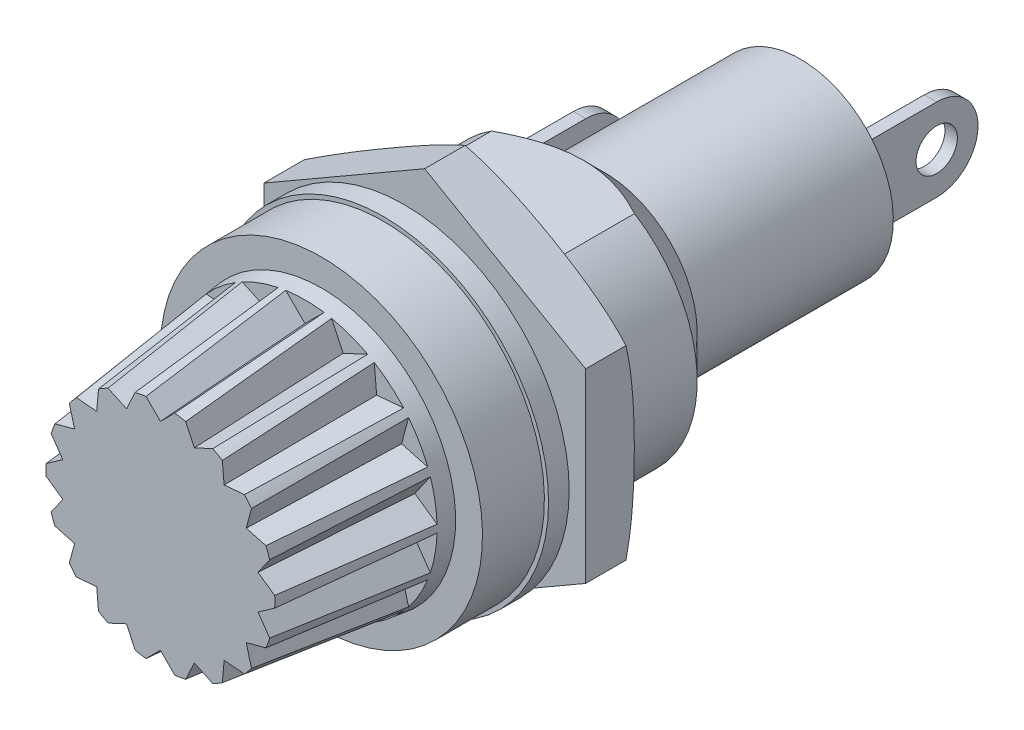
ISO-10303-21;
HEADER;
FILE_DESCRIPTION(('STEP AP214'),'2;1');
FILE_NAME('part.step','',(''),(''),'','','');
FILE_SCHEMA(('AUTOMOTIVE_DESIGN { 1 0 10303 214 1 1 1 1 }'));
ENDSEC;
DATA;
#1=APPLICATION_CONTEXT('core data for automotive mechanical design processes');
#2=APPLICATION_PROTOCOL_DEFINITION('international standard','automotive_design',2000,#1);
#3=PRODUCT_CONTEXT('',#1,'mechanical');
#4=PRODUCT('Part','Part','',(#3));
#5=PRODUCT_RELATED_PRODUCT_CATEGORY('part','',(#4));
#6=PRODUCT_DEFINITION_FORMATION('','',#4);
#7=PRODUCT_DEFINITION_CONTEXT('part definition',#1,'design');
#8=PRODUCT_DEFINITION('design','',#6,#7);
#9=PRODUCT_DEFINITION_SHAPE('','',#8);
#10=(LENGTH_UNIT() NAMED_UNIT(*) SI_UNIT(.MILLI.,.METRE.));
#11=(NAMED_UNIT(*) PLANE_ANGLE_UNIT() SI_UNIT($,.RADIAN.));
#12=(NAMED_UNIT(*) SI_UNIT($,.STERADIAN.) SOLID_ANGLE_UNIT());
#13=UNCERTAINTY_MEASURE_WITH_UNIT(LENGTH_MEASURE(1.E-05),#10,'distance_accuracy_value','');
#14=(GEOMETRIC_REPRESENTATION_CONTEXT(3) GLOBAL_UNCERTAINTY_ASSIGNED_CONTEXT((#13)) GLOBAL_UNIT_ASSIGNED_CONTEXT((#10,
#11,#12)) REPRESENTATION_CONTEXT('',''));
#15=CARTESIAN_POINT('',(0.,0.,0.));
#16=DIRECTION('',(0.,0.,1.));
#17=DIRECTION('',(1.,0.,0.));
#18=AXIS2_PLACEMENT_3D('',#15,#16,#17);
#19=CARTESIAN_POINT('',(0.,0.,11.8));
#20=DIRECTION('',(0.,0.,1.));
#21=DIRECTION('',(0.,-1.,0.));
#22=AXIS2_PLACEMENT_3D('',#19,#20,#21);
#23=CYLINDRICAL_SURFACE('',#22,6.5);
#24=CARTESIAN_POINT('',(0.,0.,-1.));
#25=DIRECTION('',(0.,0.,1.));
#26=DIRECTION('',(0.,-1.,0.));
#27=AXIS2_PLACEMENT_3D('',#24,#25,#26);
#28=CIRCLE('',#27,6.5);
#29=CARTESIAN_POINT('',(3.46410161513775,-5.5,-1.));
#30=VERTEX_POINT('',#29);
#31=CARTESIAN_POINT('',(3.46410161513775,5.5,-1.));
#32=VERTEX_POINT('',#31);
#33=EDGE_CURVE('E1248',#30,#32,#28,.T.);
#34=ORIENTED_EDGE('',*,*,#33,.T.);
#35=DIRECTION('',(0.,0.,-1.));
#36=VECTOR('',#35,1.);
#37=CARTESIAN_POINT('',(3.46410161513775,5.5,7.99999999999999));
#38=LINE('',#37,#36);
#39=CARTESIAN_POINT('',(3.46410161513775,5.5,0.));
#40=VERTEX_POINT('',#39);
#41=EDGE_CURVE('E643',#40,#32,#38,.T.);
#42=ORIENTED_EDGE('',*,*,#41,.F.);
#43=CARTESIAN_POINT('',(0.,0.,0.));
#44=DIRECTION('',(0.,0.,1.));
#45=DIRECTION('',(0.,-1.,0.));
#46=AXIS2_PLACEMENT_3D('',#43,#44,#45);
#47=CIRCLE('',#46,6.5);
#48=CARTESIAN_POINT('',(3.46410161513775,-5.5,0.));
#49=VERTEX_POINT('',#48);
#50=EDGE_CURVE('E1263',#49,#40,#47,.T.);
#51=ORIENTED_EDGE('',*,*,#50,.F.);
#52=DIRECTION('',(0.,0.,-1.));
#53=VECTOR('',#52,1.);
#54=CARTESIAN_POINT('',(3.46410161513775,-5.5,7.99999999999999));
#55=LINE('',#54,#53);
#56=EDGE_CURVE('E1253',#49,#30,#55,.T.);
#57=ORIENTED_EDGE('',*,*,#56,.T.);
#58=EDGE_LOOP('',(#34,#42,#51,#57));
#59=FACE_BOUND('',#58,.T.);
#60=ADVANCED_FACE('F33',(#59),#23,.T.);
#61=CARTESIAN_POINT('',(0.,0.,11.8));
#62=DIRECTION('',(0.,0.,1.));
#63=DIRECTION('',(0.,-1.,0.));
#64=AXIS2_PLACEMENT_3D('',#61,#62,#63);
#65=CYLINDRICAL_SURFACE('',#64,6.5);
#66=CARTESIAN_POINT('',(0.,0.,-7.70000000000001));
#67=DIRECTION('',(0.,0.,1.));
#68=DIRECTION('',(0.,-1.,0.));
#69=AXIS2_PLACEMENT_3D('',#66,#67,#68);
#70=CIRCLE('',#69,6.5);
#71=CARTESIAN_POINT('',(3.46410161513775,-5.5,-7.70000000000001));
#72=VERTEX_POINT('',#71);
#73=CARTESIAN_POINT('',(3.46410161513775,5.5,-7.70000000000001));
#74=VERTEX_POINT('',#73);
#75=EDGE_CURVE('E1269',#72,#74,#70,.T.);
#76=ORIENTED_EDGE('',*,*,#75,.T.);
#77=CARTESIAN_POINT('',(3.46410161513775,5.5,-3.5));
#78=VERTEX_POINT('',#77);
#79=EDGE_CURVE('E632',#78,#74,#38,.T.);
#80=ORIENTED_EDGE('',*,*,#79,.F.);
#81=CARTESIAN_POINT('',(0.,0.,-3.5));
#82=DIRECTION('',(0.,0.,1.));
#83=DIRECTION('',(0.,-1.,0.));
#84=AXIS2_PLACEMENT_3D('',#81,#82,#83);
#85=CIRCLE('',#84,6.5);
#86=CARTESIAN_POINT('',(3.46410161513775,-5.5,-3.5));
#87=VERTEX_POINT('',#86);
#88=EDGE_CURVE('E1261',#87,#78,#85,.T.);
#89=ORIENTED_EDGE('',*,*,#88,.F.);
#90=EDGE_CURVE('E2557',#87,#72,#55,.T.);
#91=ORIENTED_EDGE('',*,*,#90,.T.);
#92=EDGE_LOOP('',(#76,#80,#89,#91));
#93=FACE_BOUND('',#92,.T.);
#94=ADVANCED_FACE('F1228',(#93),#65,.T.);
#95=CARTESIAN_POINT('',(0.,6.5,-1.));
#96=DIRECTION('',(0.,0.,-1.));
#97=DIRECTION('',(0.,1.,0.));
#98=AXIS2_PLACEMENT_3D('',#95,#96,#97);
#99=PLANE('',#98);
#100=ORIENTED_EDGE('',*,*,#33,.F.);
#101=CARTESIAN_POINT('',(0.,0.,-1.));
#102=DIRECTION('',(0.,0.,-1.));
#103=DIRECTION('',(0.,1.,0.));
#104=AXIS2_PLACEMENT_3D('',#101,#102,#103);
#105=CIRCLE('',#104,6.5);
#106=CARTESIAN_POINT('',(-3.46410161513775,-5.5,-1.));
#107=VERTEX_POINT('',#106);
#108=EDGE_CURVE('E697',#30,#107,#105,.T.);
#109=ORIENTED_EDGE('',*,*,#108,.T.);
#110=CARTESIAN_POINT('',(-3.46410161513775,5.5,-1.));
#111=VERTEX_POINT('',#110);
#112=EDGE_CURVE('E1256',#111,#107,#28,.T.);
#113=ORIENTED_EDGE('',*,*,#112,.F.);
#114=CARTESIAN_POINT('',(0.,0.,-1.));
#115=DIRECTION('',(0.,0.,-1.));
#116=DIRECTION('',(0.,1.,0.));
#117=AXIS2_PLACEMENT_3D('',#114,#115,#116);
#118=CIRCLE('',#117,6.5);
#119=EDGE_CURVE('E2567',#111,#32,#118,.T.);
#120=ORIENTED_EDGE('',*,*,#119,.T.);
#121=EDGE_LOOP('',(#100,#109,#113,#120));
#122=FACE_BOUND('',#121,.T.);
#123=DIRECTION('',(-0.866025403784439,0.5,0.));
#124=VECTOR('',#123,1.);
#125=CARTESIAN_POINT('',(7.79422863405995,4.5,-1.));
#126=LINE('',#125,#124);
#127=CARTESIAN_POINT('',(7.79422863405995,4.5,-1.));
#128=VERTEX_POINT('',#127);
#129=CARTESIAN_POINT('',(0.,9.,-1.));
#130=VERTEX_POINT('',#129);
#131=EDGE_CURVE('E700',#128,#130,#126,.T.);
#132=ORIENTED_EDGE('',*,*,#131,.T.);
#133=DIRECTION('',(-0.866025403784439,-0.5,0.));
#134=VECTOR('',#133,1.);
#135=CARTESIAN_POINT('',(0.,9.,-1.));
#136=LINE('',#135,#134);
#137=CARTESIAN_POINT('',(-7.79422863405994,4.50000000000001,-1.));
#138=VERTEX_POINT('',#137);
#139=EDGE_CURVE('E703',#130,#138,#136,.T.);
#140=ORIENTED_EDGE('',*,*,#139,.T.);
#141=DIRECTION('',(0.,-1.,0.));
#142=VECTOR('',#141,1.);
#143=CARTESIAN_POINT('',(-7.79422863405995,4.5,-1.));
#144=LINE('',#143,#142);
#145=CARTESIAN_POINT('',(-7.79422863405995,-4.5,-1.));
#146=VERTEX_POINT('',#145);
#147=EDGE_CURVE('E706',#138,#146,#144,.T.);
#148=ORIENTED_EDGE('',*,*,#147,.T.);
#149=DIRECTION('',(0.866025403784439,-0.5,0.));
#150=VECTOR('',#149,1.);
#151=CARTESIAN_POINT('',(-7.79422863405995,-4.5,-1.));
#152=LINE('',#151,#150);
#153=CARTESIAN_POINT('',(0.,-9.,-1.));
#154=VERTEX_POINT('',#153);
#155=EDGE_CURVE('E709',#146,#154,#152,.T.);
#156=ORIENTED_EDGE('',*,*,#155,.T.);
#157=DIRECTION('',(0.866025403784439,0.5,0.));
#158=VECTOR('',#157,1.);
#159=CARTESIAN_POINT('',(0.,-9.,-1.));
#160=LINE('',#159,#158);
#161=CARTESIAN_POINT('',(7.79422863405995,-4.5,-1.));
#162=VERTEX_POINT('',#161);
#163=EDGE_CURVE('E712',#154,#162,#160,.T.);
#164=ORIENTED_EDGE('',*,*,#163,.T.);
#165=DIRECTION('',(0.,1.,0.));
#166=VECTOR('',#165,1.);
#167=CARTESIAN_POINT('',(7.79422863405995,-4.5,-1.));
#168=LINE('',#167,#166);
#169=EDGE_CURVE('E715',#162,#128,#168,.T.);
#170=ORIENTED_EDGE('',*,*,#169,.T.);
#171=EDGE_LOOP('',(#132,#140,#148,#156,#164,#170));
#172=FACE_BOUND('',#171,.T.);
#173=ADVANCED_FACE('F1225',(#122,#172),#99,.F.);
#174=CARTESIAN_POINT('',(0.,7.8,1.));
#175=DIRECTION('',(0.,0.,-1.));
#176=DIRECTION('',(0.,1.,0.));
#177=AXIS2_PLACEMENT_3D('',#174,#175,#176);
#178=PLANE('',#177);
#179=CARTESIAN_POINT('',(0.,0.,0.999999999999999));
#180=DIRECTION('',(0.,0.,1.));
#181=DIRECTION('',(0.,-1.,0.));
#182=AXIS2_PLACEMENT_3D('',#179,#180,#181);
#183=CIRCLE('',#182,7.8);
#184=CARTESIAN_POINT('',(0.,-7.8,0.999999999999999));
#185=VERTEX_POINT('',#184);
#186=EDGE_CURVE('E1289',#185,#185,#183,.T.);
#187=ORIENTED_EDGE('',*,*,#186,.F.);
#188=EDGE_LOOP('',(#187));
#189=FACE_BOUND('',#188,.T.);
#190=CARTESIAN_POINT('',(0.,0.,0.999999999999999));
#191=DIRECTION('',(0.,0.,1.));
#192=DIRECTION('',(0.,-1.,0.));
#193=AXIS2_PLACEMENT_3D('',#190,#191,#192);
#194=CIRCLE('',#193,8.);
#195=CARTESIAN_POINT('',(0.,-8.,0.999999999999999));
#196=VERTEX_POINT('',#195);
#197=EDGE_CURVE('E1489',#196,#196,#194,.T.);
#198=ORIENTED_EDGE('',*,*,#197,.T.);
#199=EDGE_LOOP('',(#198));
#200=FACE_BOUND('',#199,.T.);
#201=ADVANCED_FACE('F1227',(#189,#200),#178,.F.);
#202=CARTESIAN_POINT('',(0.,0.,11.8));
#203=DIRECTION('',(0.,0.,1.));
#204=DIRECTION('',(0.,-1.,0.));
#205=AXIS2_PLACEMENT_3D('',#202,#203,#204);
#206=CYLINDRICAL_SURFACE('',#205,7.8);
#207=CARTESIAN_POINT('',(0.,0.,4.));
#208=DIRECTION('',(0.,0.,1.));
#209=DIRECTION('',(0.,-1.,0.));
#210=AXIS2_PLACEMENT_3D('',#207,#208,#209);
#211=CIRCLE('',#210,7.8);
#212=CARTESIAN_POINT('',(0.,-7.8,4.));
#213=VERTEX_POINT('',#212);
#214=EDGE_CURVE('E1286',#213,#213,#211,.T.);
#215=ORIENTED_EDGE('',*,*,#214,.F.);
#216=EDGE_LOOP('',(#215));
#217=FACE_BOUND('',#216,.T.);
#218=ORIENTED_EDGE('',*,*,#186,.T.);
#219=EDGE_LOOP('',(#218));
#220=FACE_BOUND('',#219,.T.);
#221=ADVANCED_FACE('F1233',(#217,#220),#206,.T.);
#222=CARTESIAN_POINT('',(0.,7.8,4.));
#223=DIRECTION('',(0.,0.,-1.));
#224=DIRECTION('',(0.,1.,0.));
#225=AXIS2_PLACEMENT_3D('',#222,#223,#224);
#226=PLANE('',#225);
#227=CARTESIAN_POINT('',(0.,0.,4.));
#228=DIRECTION('',(0.,0.,1.));
#229=DIRECTION('',(0.,-1.,0.));
#230=AXIS2_PLACEMENT_3D('',#227,#228,#229);
#231=CIRCLE('',#230,6.5);
#232=CARTESIAN_POINT('',(0.,-6.5,4.));
#233=VERTEX_POINT('',#232);
#234=EDGE_CURVE('E1282',#233,#233,#231,.T.);
#235=ORIENTED_EDGE('',*,*,#234,.F.);
#236=EDGE_LOOP('',(#235));
#237=FACE_BOUND('',#236,.T.);
#238=ORIENTED_EDGE('',*,*,#214,.T.);
#239=EDGE_LOOP('',(#238));
#240=FACE_BOUND('',#239,.T.);
#241=ADVANCED_FACE('F949',(#237,#240),#226,.F.);
#242=CARTESIAN_POINT('',(0.,0.,4.));
#243=DIRECTION('',(0.,0.,-1.));
#244=DIRECTION('',(0.,1.,0.));
#245=AXIS2_PLACEMENT_3D('',#242,#243,#244);
#246=CONICAL_SURFACE('',#245,6.5,0.122173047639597);
#247=CARTESIAN_POINT('',(0.,0.,4.8));
#248=DIRECTION('',(0.,0.,-1.));
#249=DIRECTION('',(-1.,0.,0.));
#250=AXIS2_PLACEMENT_3D('',#247,#248,#249);
#251=CIRCLE('',#250,6.40177235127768);
#252=CARTESIAN_POINT('',(1.2937908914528,6.26967258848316,4.8));
#253=VERTEX_POINT('',#252);
#254=CARTESIAN_POINT('',(3.03896653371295,5.63448060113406,4.8));
#255=VERTEX_POINT('',#254);
#256=EDGE_CURVE('E1353',#253,#255,#251,.T.);
#257=ORIENTED_EDGE('',*,*,#256,.T.);
#258=CARTESIAN_POINT('',(3.03898085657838,5.6345007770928,4.7998));
#259=CARTESIAN_POINT('',(2.95543962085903,5.51680564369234,5.96655779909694));
#260=CARTESIAN_POINT('',(2.87179475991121,5.39906301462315,7.13330336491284));
#261=CARTESIAN_POINT('',(2.70429778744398,5.16348276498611,9.46677003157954));
#262=CARTESIAN_POINT('',(2.62044567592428,5.04564514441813,10.6334911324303));
#263=CARTESIAN_POINT('',(2.53648993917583,4.9277600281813,11.8002));
#264=B_SPLINE_CURVE_WITH_KNOTS('',3,(#258,#259,#260,#261,#262,#263),.UNSPECIFIED.,.F.,.F.,(4,2,
4),(0.,3.52695265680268,7.05390531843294),.UNSPECIFIED.);
#265=CARTESIAN_POINT('',(2.53650433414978,4.9277802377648,11.8));
#266=VERTEX_POINT('',#265);
#267=EDGE_CURVE('E1189',#255,#266,#264,.T.);
#268=ORIENTED_EDGE('',*,*,#267,.T.);
#269=CARTESIAN_POINT('',(0.,0.,11.8));
#270=DIRECTION('',(0.,0.,1.));
#271=DIRECTION('',(0.,-1.,0.));
#272=AXIS2_PLACEMENT_3D('',#269,#270,#271);
#273=CIRCLE('',#272,5.5422804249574);
#274=CARTESIAN_POINT('',(2.99933070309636,4.66056730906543,11.8));
#275=VERTEX_POINT('',#274);
#276=EDGE_CURVE('E1515',#275,#266,#273,.T.);
#277=ORIENTED_EDGE('',*,*,#276,.F.);
#278=CARTESIAN_POINT('',(2.99932039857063,4.66054473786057,11.8001999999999));
#279=CARTESIAN_POINT('',(3.05943403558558,4.79219509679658,10.6334911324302));
#280=CARTESIAN_POINT('',(3.11955835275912,4.92373196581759,9.46677003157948));
#281=CARTESIAN_POINT('',(3.23982834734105,5.18657872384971,7.13330336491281));
#282=CARTESIAN_POINT('',(3.29997402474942,5.31788861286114,5.96655779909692));
#283=CARTESIAN_POINT('',(3.36013038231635,5.44908501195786,4.7998));
#284=B_SPLINE_CURVE_WITH_KNOTS('',3,(#278,#279,#280,#281,#282,#283),.UNSPECIFIED.,.F.,.F.,(4,2,
4),(0.,3.52695266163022,7.05390531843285),.UNSPECIFIED.);
#285=CARTESIAN_POINT('',(3.36012007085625,5.44906252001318,4.8));
#286=VERTEX_POINT('',#285);
#287=EDGE_CURVE('E1177',#275,#286,#284,.T.);
#288=ORIENTED_EDGE('',*,*,#287,.T.);
#289=CARTESIAN_POINT('',(4.78280028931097,4.25529207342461,4.8));
#290=VERTEX_POINT('',#289);
#291=EDGE_CURVE('E1529',#286,#290,#251,.T.);
#292=ORIENTED_EDGE('',*,*,#291,.T.);
#293=CARTESIAN_POINT('',(4.78282064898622,4.25530613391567,4.79979999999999));
#294=CARTESIAN_POINT('',(4.66406345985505,4.17328167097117,5.96655779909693));
#295=CARTESIAN_POINT('',(4.54519265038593,4.09124801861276,7.13330336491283));
#296=CARTESIAN_POINT('',(4.30722379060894,3.92716233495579,9.46677003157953));
#297=CARTESIAN_POINT('',(4.18812574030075,3.84511030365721,10.6334911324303));
#298=CARTESIAN_POINT('',(4.0689140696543,3.7630490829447,11.8002));
#299=B_SPLINE_CURVE_WITH_KNOTS('',3,(#293,#294,#295,#296,#297,#298),.UNSPECIFIED.,.F.,.F.,(4,2,
4),(0.,3.52695265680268,7.05390531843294),.UNSPECIFIED.);
#300=CARTESIAN_POINT('',(4.06893450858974,3.76306315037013,11.8));
#301=VERTEX_POINT('',#300);
#302=EDGE_CURVE('E1171',#290,#301,#299,.T.);
#303=ORIENTED_EDGE('',*,*,#302,.T.);
#304=CARTESIAN_POINT('',(4.41245682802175,3.35366919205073,11.8));
#305=VERTEX_POINT('',#304);
#306=EDGE_CURVE('E1522',#305,#301,#273,.T.);
#307=ORIENTED_EDGE('',*,*,#306,.F.);
#308=CARTESIAN_POINT('',(4.41243942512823,3.35365150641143,11.8002));
#309=CARTESIAN_POINT('',(4.51395484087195,3.45680230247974,10.6334911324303));
#310=CARTESIAN_POINT('',(4.61544147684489,3.55984280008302,9.46677003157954));
#311=CARTESIAN_POINT('',(4.81835718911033,3.76570319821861,7.13330336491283));
#312=CARTESIAN_POINT('',(4.91978626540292,3.86852309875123,5.96655779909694));
#313=CARTESIAN_POINT('',(5.02118656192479,3.97123270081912,4.7998));
#314=B_SPLINE_CURVE_WITH_KNOTS('',3,(#308,#309,#310,#311,#312,#313),.UNSPECIFIED.,.F.,.F.,(4,2,
4),(0.,3.52695266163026,7.05390531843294),.UNSPECIFIED.);
#315=CARTESIAN_POINT('',(5.02116917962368,3.97121509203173,4.8));
#316=VERTEX_POINT('',#315);
#317=EDGE_CURVE('E1164',#305,#316,#314,.T.);
#318=ORIENTED_EDGE('',*,*,#317,.T.);
#319=CARTESIAN_POINT('',(5.94975774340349,2.36285252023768,4.8));
#320=VERTEX_POINT('',#319);
#321=EDGE_CURVE('E1531',#316,#320,#251,.T.);
#322=ORIENTED_EDGE('',*,*,#321,.T.);
#323=CARTESIAN_POINT('',(5.94978168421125,2.36285876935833,4.7998));
#324=CARTESIAN_POINT('',(5.81013241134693,2.32639833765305,5.96655779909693));
#325=CARTESIAN_POINT('',(5.6703732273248,2.2899681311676,7.13330336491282));
#326=CARTESIAN_POINT('',(5.39063503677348,2.21716816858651,9.46677003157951));
#327=CARTESIAN_POINT('',(5.25065603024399,2.18079841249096,10.6334911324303));
#328=CARTESIAN_POINT('',(5.11056711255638,2.14445888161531,11.8002));
#329=B_SPLINE_CURVE_WITH_KNOTS('',3,(#323,#324,#325,#326,#327,#328),.UNSPECIFIED.,.F.,.F.,(4,2,
4),(0.,3.52695265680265,7.05390531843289),.UNSPECIFIED.);
#330=CARTESIAN_POINT('',(5.11059113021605,2.14446511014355,11.8));
#331=VERTEX_POINT('',#330);
#332=EDGE_CURVE('E1157',#320,#331,#329,.T.);
#333=ORIENTED_EDGE('',*,*,#332,.T.);
#334=CARTESIAN_POINT('',(5.2933755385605,1.64226907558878,11.8));
#335=VERTEX_POINT('',#334);
#336=EDGE_CURVE('E1524',#335,#331,#273,.T.);
#337=ORIENTED_EDGE('',*,*,#336,.F.);
#338=CARTESIAN_POINT('',(5.293353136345,1.64225840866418,11.8002));
#339=CARTESIAN_POINT('',(5.42402607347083,1.70446813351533,10.6334911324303));
#340=CARTESIAN_POINT('',(5.5546342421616,1.76658405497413,9.46677003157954));
#341=CARTESIAN_POINT('',(5.81572104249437,1.89062829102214,7.13330336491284));
#342=CARTESIAN_POINT('',(5.94619967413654,1.9525566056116,5.96655779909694));
#343=CARTESIAN_POINT('',(6.07661353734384,2.01439111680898,4.7998));
#344=B_SPLINE_CURVE_WITH_KNOTS('',3,(#338,#339,#340,#341,#342,#343),.UNSPECIFIED.,.F.,.F.,(4,2,
4),(0.,3.52695266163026,7.05390531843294),.UNSPECIFIED.);
#345=CARTESIAN_POINT('',(6.07659118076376,2.01438051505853,4.8));
#346=VERTEX_POINT('',#345);
#347=EDGE_CURVE('E1150',#335,#346,#344,.T.);
#348=ORIENTED_EDGE('',*,*,#347,.T.);
#349=CARTESIAN_POINT('',(6.39908660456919,0.185418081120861,4.8));
#350=VERTEX_POINT('',#349);
#351=EDGE_CURVE('E1534',#346,#350,#251,.T.);
#352=ORIENTED_EDGE('',*,*,#351,.T.);
#353=CARTESIAN_POINT('',(6.39911123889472,0.185415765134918,4.7998));
#354=CARTESIAN_POINT('',(6.25541364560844,0.198917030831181,5.96655779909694));
#355=CARTESIAN_POINT('',(6.11162310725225,0.212484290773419,7.13330336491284));
#356=CARTESIAN_POINT('',(5.82385614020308,0.239750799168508,9.46677003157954));
#357=CARTESIAN_POINT('',(5.67987971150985,0.253450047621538,10.6334911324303));
#358=CARTESIAN_POINT('',(5.53581033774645,0.267215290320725,11.8002));
#359=B_SPLINE_CURVE_WITH_KNOTS('',3,(#353,#354,#355,#356,#357,#358),.UNSPECIFIED.,.F.,.F.,(4,2,
4),(0.,3.52695265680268,7.05390531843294),.UNSPECIFIED.);
#360=CARTESIAN_POINT('',(5.53583503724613,0.26721292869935,11.8));
#361=VERTEX_POINT('',#360);
#362=EDGE_CURVE('E1143',#350,#361,#359,.T.);
#363=ORIENTED_EDGE('',*,*,#362,.T.);
#364=CARTESIAN_POINT('',(5.53583503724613,-0.267212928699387,11.8));
#365=VERTEX_POINT('',#364);
#366=EDGE_CURVE('E1827',#365,#361,#273,.T.);
#367=ORIENTED_EDGE('',*,*,#366,.F.);
#368=CARTESIAN_POINT('',(5.53581033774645,-0.267215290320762,11.8002));
#369=CARTESIAN_POINT('',(5.67987971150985,-0.253450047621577,10.6334911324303));
#370=CARTESIAN_POINT('',(5.82385614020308,-0.239750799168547,9.46677003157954));
#371=CARTESIAN_POINT('',(6.11162310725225,-0.212484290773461,7.13330336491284));
#372=CARTESIAN_POINT('',(6.25541364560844,-0.198917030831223,5.96655779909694));
#373=CARTESIAN_POINT('',(6.39911123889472,-0.185415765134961,4.7998));
#374=B_SPLINE_CURVE_WITH_KNOTS('',3,(#368,#369,#370,#371,#372,#373),.UNSPECIFIED.,.F.,.F.,(4,2,
4),(0.,3.52695266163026,7.05390531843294),.UNSPECIFIED.);
#375=CARTESIAN_POINT('',(6.39908660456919,-0.185418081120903,4.8));
#376=VERTEX_POINT('',#375);
#377=EDGE_CURVE('E1136',#365,#376,#374,.T.);
#378=ORIENTED_EDGE('',*,*,#377,.T.);
#379=CARTESIAN_POINT('',(6.07659118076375,-2.01438051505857,4.8));
#380=VERTEX_POINT('',#379);
#381=EDGE_CURVE('E1538',#376,#380,#251,.T.);
#382=ORIENTED_EDGE('',*,*,#381,.T.);
#383=CARTESIAN_POINT('',(6.07661353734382,-2.01439111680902,4.7998));
#384=CARTESIAN_POINT('',(5.94619967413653,-1.95255660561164,5.96655779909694));
#385=CARTESIAN_POINT('',(5.81572104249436,-1.89062829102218,7.13330336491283));
#386=CARTESIAN_POINT('',(5.55463424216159,-1.76658405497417,9.46677003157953));
#387=CARTESIAN_POINT('',(5.42402607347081,-1.70446813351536,10.6334911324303));
#388=CARTESIAN_POINT('',(5.29335313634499,-1.64225840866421,11.8002));
#389=B_SPLINE_CURVE_WITH_KNOTS('',3,(#383,#384,#385,#386,#387,#388),.UNSPECIFIED.,.F.,.F.,(4,2,
4),(0.,3.52695265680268,7.05390531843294),.UNSPECIFIED.);
#390=CARTESIAN_POINT('',(5.29337553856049,-1.64226907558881,11.8));
#391=VERTEX_POINT('',#390);
#392=EDGE_CURVE('E1129',#380,#391,#389,.T.);
#393=ORIENTED_EDGE('',*,*,#392,.T.);
#394=CARTESIAN_POINT('',(5.11059113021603,-2.14446511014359,11.8));
#395=VERTEX_POINT('',#394);
#396=EDGE_CURVE('E1825',#395,#391,#273,.T.);
#397=ORIENTED_EDGE('',*,*,#396,.F.);
#398=CARTESIAN_POINT('',(5.11056711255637,-2.14445888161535,11.8002));
#399=CARTESIAN_POINT('',(5.25065603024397,-2.180798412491,10.6334911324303));
#400=CARTESIAN_POINT('',(5.39063503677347,-2.21716816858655,9.46677003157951));
#401=CARTESIAN_POINT('',(5.67037322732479,-2.28996813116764,7.13330336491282));
#402=CARTESIAN_POINT('',(5.81013241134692,-2.32639833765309,5.96655779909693));
#403=CARTESIAN_POINT('',(5.94978168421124,-2.36285876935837,4.7998));
#404=B_SPLINE_CURVE_WITH_KNOTS('',3,(#398,#399,#400,#401,#402,#403),.UNSPECIFIED.,.F.,.F.,(4,2,
4),(0.,3.52695266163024,7.05390531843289),.UNSPECIFIED.);
#405=CARTESIAN_POINT('',(5.94975774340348,-2.36285252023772,4.8));
#406=VERTEX_POINT('',#405);
#407=EDGE_CURVE('E1122',#395,#406,#404,.T.);
#408=ORIENTED_EDGE('',*,*,#407,.T.);
#409=CARTESIAN_POINT('',(5.02116917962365,-3.97121509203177,4.8));
#410=VERTEX_POINT('',#409);
#411=EDGE_CURVE('E1542',#406,#410,#251,.T.);
#412=ORIENTED_EDGE('',*,*,#411,.T.);
#413=CARTESIAN_POINT('',(5.02118656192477,-3.97123270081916,4.7998));
#414=CARTESIAN_POINT('',(4.91978626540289,-3.86852309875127,5.96655779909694));
#415=CARTESIAN_POINT('',(4.81835718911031,-3.76570319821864,7.13330336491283));
#416=CARTESIAN_POINT('',(4.61544147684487,-3.55984280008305,9.46677003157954));
#417=CARTESIAN_POINT('',(4.51395484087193,-3.45680230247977,10.6334911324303));
#418=CARTESIAN_POINT('',(4.41243942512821,-3.35365150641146,11.8002));
#419=B_SPLINE_CURVE_WITH_KNOTS('',3,(#413,#414,#415,#416,#417,#418),.UNSPECIFIED.,.F.,.F.,(4,2,
4),(0.,3.52695265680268,7.05390531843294),.UNSPECIFIED.);
#420=CARTESIAN_POINT('',(4.41245682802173,-3.35366919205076,11.8));
#421=VERTEX_POINT('',#420);
#422=EDGE_CURVE('E1115',#410,#421,#419,.T.);
#423=ORIENTED_EDGE('',*,*,#422,.T.);
#424=CARTESIAN_POINT('',(4.06893450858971,-3.76306315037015,11.8));
#425=VERTEX_POINT('',#424);
#426=EDGE_CURVE('E1823',#425,#421,#273,.T.);
#427=ORIENTED_EDGE('',*,*,#426,.F.);
#428=CARTESIAN_POINT('',(4.06891406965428,-3.76304908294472,11.8002));
#429=CARTESIAN_POINT('',(4.18812574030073,-3.84511030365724,10.6334911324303));
#430=CARTESIAN_POINT('',(4.30722379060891,-3.92716233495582,9.46677003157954));
#431=CARTESIAN_POINT('',(4.54519265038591,-4.09124801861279,7.13330336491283));
#432=CARTESIAN_POINT('',(4.66406345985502,-4.1732816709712,5.96655779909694));
#433=CARTESIAN_POINT('',(4.78282064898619,-4.2553061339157,4.7998));
#434=B_SPLINE_CURVE_WITH_KNOTS('',3,(#428,#429,#430,#431,#432,#433),.UNSPECIFIED.,.F.,.F.,(4,2,
4),(0.,3.52695266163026,7.05390531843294),.UNSPECIFIED.);
#435=CARTESIAN_POINT('',(4.78280028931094,-4.25529207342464,4.8));
#436=VERTEX_POINT('',#435);
#437=EDGE_CURVE('E1108',#425,#436,#434,.T.);
#438=ORIENTED_EDGE('',*,*,#437,.T.);
#439=CARTESIAN_POINT('',(3.36012007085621,-5.4490625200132,4.8));
#440=VERTEX_POINT('',#439);
#441=EDGE_CURVE('E1546',#436,#440,#251,.T.);
#442=ORIENTED_EDGE('',*,*,#441,.T.);
#443=CARTESIAN_POINT('',(3.36013038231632,-5.44908501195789,4.7998));
#444=CARTESIAN_POINT('',(3.29997402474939,-5.31788861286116,5.96655779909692));
#445=CARTESIAN_POINT('',(3.23982834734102,-5.18657872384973,7.13330336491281));
#446=CARTESIAN_POINT('',(3.11955835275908,-4.92373196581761,9.46677003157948));
#447=CARTESIAN_POINT('',(3.05943403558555,-4.7921950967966,10.6334911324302));
#448=CARTESIAN_POINT('',(2.9993203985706,-4.66054473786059,11.8001999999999));
#449=B_SPLINE_CURVE_WITH_KNOTS('',3,(#443,#444,#445,#446,#447,#448),.UNSPECIFIED.,.F.,.F.,(4,2,
4),(0.,3.52695265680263,7.05390531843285),.UNSPECIFIED.);
#450=CARTESIAN_POINT('',(2.99933070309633,-4.66056730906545,11.8));
#451=VERTEX_POINT('',#450);
#452=EDGE_CURVE('E1101',#440,#451,#449,.T.);
#453=ORIENTED_EDGE('',*,*,#452,.T.);
#454=CARTESIAN_POINT('',(2.53650433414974,-4.92778023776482,11.8));
#455=VERTEX_POINT('',#454);
#456=EDGE_CURVE('E1821',#455,#451,#273,.T.);
#457=ORIENTED_EDGE('',*,*,#456,.F.);
#458=CARTESIAN_POINT('',(2.5364899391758,-4.92776002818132,11.8002));
#459=CARTESIAN_POINT('',(2.62044567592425,-5.04564514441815,10.6334911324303));
#460=CARTESIAN_POINT('',(2.70429778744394,-5.16348276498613,9.46677003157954));
#461=CARTESIAN_POINT('',(2.87179475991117,-5.39906301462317,7.13330336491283));
#462=CARTESIAN_POINT('',(2.955439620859,-5.51680564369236,5.96655779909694));
#463=CARTESIAN_POINT('',(3.03898085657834,-5.63450077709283,4.7998));
#464=B_SPLINE_CURVE_WITH_KNOTS('',3,(#458,#459,#460,#461,#462,#463),.UNSPECIFIED.,.F.,.F.,(4,2,
4),(0.,3.52695266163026,7.05390531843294),.UNSPECIFIED.);
#465=CARTESIAN_POINT('',(3.03896653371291,-5.63448060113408,4.8));
#466=VERTEX_POINT('',#465);
#467=EDGE_CURVE('E1094',#455,#466,#464,.T.);
#468=ORIENTED_EDGE('',*,*,#467,.T.);
#469=CARTESIAN_POINT('',(1.29379089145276,-6.26967258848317,4.8));
#470=VERTEX_POINT('',#469);
#471=EDGE_CURVE('E1550',#466,#470,#251,.T.);
#472=ORIENTED_EDGE('',*,*,#471,.T.);
#473=CARTESIAN_POINT('',(1.29379288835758,-6.26969725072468,4.7998));
#474=CARTESIAN_POINT('',(1.28213621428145,-6.12583827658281,5.96655779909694));
#475=CARTESIAN_POINT('',(1.2705283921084,-5.98187630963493,7.13330336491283));
#476=CARTESIAN_POINT('',(1.24741045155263,-5.69374638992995,9.46677003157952));
#477=CARTESIAN_POINT('',(1.23590033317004,-5.54957843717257,10.6334911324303));
#478=CARTESIAN_POINT('',(1.22443906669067,-5.4053074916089,11.8002));
#479=B_SPLINE_CURVE_WITH_KNOTS('',3,(#473,#474,#475,#476,#477,#478),.UNSPECIFIED.,.F.,.F.,(4,2,
4),(0.,3.52695265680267,7.05390531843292),.UNSPECIFIED.);
#480=CARTESIAN_POINT('',(1.22444102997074,-5.40533222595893,11.8));
#481=VERTEX_POINT('',#480);
#482=EDGE_CURVE('E1087',#470,#481,#479,.T.);
#483=ORIENTED_EDGE('',*,*,#482,.T.);
#484=CARTESIAN_POINT('',(0.698134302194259,-5.49813430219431,11.8));
#485=VERTEX_POINT('',#484);
#486=EDGE_CURVE('E1819',#485,#481,#273,.T.);
#487=ORIENTED_EDGE('',*,*,#486,.F.);
#488=CARTESIAN_POINT('',(0.698127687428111,-5.49811038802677,11.8002));
#489=CARTESIAN_POINT('',(0.736701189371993,-5.63760071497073,10.6334911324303));
#490=CARTESIAN_POINT('',(0.775193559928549,-5.77701096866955,9.46677003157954));
#491=CARTESIAN_POINT('',(0.852016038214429,-6.05567132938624,7.13330336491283));
#492=CARTESIAN_POINT('',(0.890346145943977,-6.19492143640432,5.96655779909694));
#493=CARTESIAN_POINT('',(0.928595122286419,-6.33409147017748,4.7998));
#494=B_SPLINE_CURVE_WITH_KNOTS('',3,(#488,#489,#490,#491,#492,#493),.UNSPECIFIED.,.F.,.F.,(4,2,
4),(0.,3.52695266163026,7.05390531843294),.UNSPECIFIED.);
#495=CARTESIAN_POINT('',(0.928588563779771,-6.33406761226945,4.8));
#496=VERTEX_POINT('',#495);
#497=EDGE_CURVE('E1080',#485,#496,#494,.T.);
#498=ORIENTED_EDGE('',*,*,#497,.T.);
#499=CARTESIAN_POINT('',(-0.928588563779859,-6.33406761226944,4.8));
#500=VERTEX_POINT('',#499);
#501=EDGE_CURVE('E1554',#496,#500,#251,.T.);
#502=ORIENTED_EDGE('',*,*,#501,.T.);
#503=CARTESIAN_POINT('',(-0.928595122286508,-6.33409147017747,4.7998));
#504=CARTESIAN_POINT('',(-0.890346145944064,-6.1949214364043,5.96655779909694));
#505=CARTESIAN_POINT('',(-0.852016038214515,-6.05567132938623,7.13330336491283));
#506=CARTESIAN_POINT('',(-0.77519355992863,-5.77701096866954,9.46677003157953));
#507=CARTESIAN_POINT('',(-0.736701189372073,-5.63760071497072,10.6334911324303));
#508=CARTESIAN_POINT('',(-0.698127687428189,-5.49811038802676,11.8002));
#509=B_SPLINE_CURVE_WITH_KNOTS('',3,(#503,#504,#505,#506,#507,#508),.UNSPECIFIED.,.F.,.F.,(4,2,
4),(0.,3.52695265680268,7.05390531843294),.UNSPECIFIED.);
#510=CARTESIAN_POINT('',(-0.698134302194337,-5.4981343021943,11.8));
#511=VERTEX_POINT('',#510);
#512=EDGE_CURVE('E1073',#500,#511,#509,.T.);
#513=ORIENTED_EDGE('',*,*,#512,.T.);
#514=CARTESIAN_POINT('',(-1.22444102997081,-5.40533222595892,11.8));
#515=VERTEX_POINT('',#514);
#516=EDGE_CURVE('E1817',#515,#511,#273,.T.);
#517=ORIENTED_EDGE('',*,*,#516,.F.);
#518=CARTESIAN_POINT('',(-1.22443906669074,-5.40530749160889,11.8002));
#519=CARTESIAN_POINT('',(-1.23590033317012,-5.54957843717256,10.6334911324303));
#520=CARTESIAN_POINT('',(-1.24741045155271,-5.69374638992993,9.46677003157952));
#521=CARTESIAN_POINT('',(-1.27052839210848,-5.98187630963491,7.13330336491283));
#522=CARTESIAN_POINT('',(-1.28213621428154,-6.12583827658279,5.96655779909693));
#523=CARTESIAN_POINT('',(-1.29379288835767,-6.26969725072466,4.7998));
#524=B_SPLINE_CURVE_WITH_KNOTS('',3,(#518,#519,#520,#521,#522,#523),.UNSPECIFIED.,.F.,.F.,(4,2,
4),(0.,3.52695266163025,7.05390531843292),.UNSPECIFIED.);
#525=CARTESIAN_POINT('',(-1.29379089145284,-6.26967258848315,4.8));
#526=VERTEX_POINT('',#525);
#527=EDGE_CURVE('E1066',#515,#526,#524,.T.);
#528=ORIENTED_EDGE('',*,*,#527,.T.);
#529=CARTESIAN_POINT('',(-3.03896653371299,-5.63448060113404,4.8));
#530=VERTEX_POINT('',#529);
#531=EDGE_CURVE('E1558',#526,#530,#251,.T.);
#532=ORIENTED_EDGE('',*,*,#531,.T.);
#533=CARTESIAN_POINT('',(-3.03898085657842,-5.63450077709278,4.7998));
#534=CARTESIAN_POINT('',(-2.95543962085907,-5.51680564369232,5.96655779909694));
#535=CARTESIAN_POINT('',(-2.87179475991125,-5.39906301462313,7.13330336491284));
#536=CARTESIAN_POINT('',(-2.70429778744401,-5.1634827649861,9.46677003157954));
#537=CARTESIAN_POINT('',(-2.62044567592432,-5.04564514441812,10.6334911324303));
#538=CARTESIAN_POINT('',(-2.53648993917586,-4.92776002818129,11.8002));
#539=B_SPLINE_CURVE_WITH_KNOTS('',3,(#533,#534,#535,#536,#537,#538),.UNSPECIFIED.,.F.,.F.,(4,2,
4),(0.,3.52695265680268,7.05390531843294),.UNSPECIFIED.);
#540=CARTESIAN_POINT('',(-2.53650433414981,-4.92778023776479,11.8));
#541=VERTEX_POINT('',#540);
#542=EDGE_CURVE('E1059',#530,#541,#539,.T.);
#543=ORIENTED_EDGE('',*,*,#542,.T.);
#544=CARTESIAN_POINT('',(-2.9993307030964,-4.66056730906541,11.8));
#545=VERTEX_POINT('',#544);
#546=EDGE_CURVE('E1815',#545,#541,#273,.T.);
#547=ORIENTED_EDGE('',*,*,#546,.F.);
#548=CARTESIAN_POINT('',(-2.99932039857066,-4.66054473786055,11.8001999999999));
#549=CARTESIAN_POINT('',(-3.05943403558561,-4.79219509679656,10.6334911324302));
#550=CARTESIAN_POINT('',(-3.11955835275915,-4.92373196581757,9.46677003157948));
#551=CARTESIAN_POINT('',(-3.23982834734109,-5.18657872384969,7.13330336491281));
#552=CARTESIAN_POINT('',(-3.29997402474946,-5.31788861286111,5.96655779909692));
#553=CARTESIAN_POINT('',(-3.36013038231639,-5.44908501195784,4.7998));
#554=B_SPLINE_CURVE_WITH_KNOTS('',3,(#548,#549,#550,#551,#552,#553),.UNSPECIFIED.,.F.,.F.,(4,2,
4),(0.,3.52695266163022,7.05390531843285),.UNSPECIFIED.);
#555=CARTESIAN_POINT('',(-3.36012007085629,-5.44906252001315,4.8));
#556=VERTEX_POINT('',#555);
#557=EDGE_CURVE('E1052',#545,#556,#554,.T.);
#558=ORIENTED_EDGE('',*,*,#557,.T.);
#559=CARTESIAN_POINT('',(-4.782800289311,-4.25529207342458,4.8));
#560=VERTEX_POINT('',#559);
#561=EDGE_CURVE('E1562',#556,#560,#251,.T.);
#562=ORIENTED_EDGE('',*,*,#561,.T.);
#563=CARTESIAN_POINT('',(-4.78282064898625,-4.25530613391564,4.79979999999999));
#564=CARTESIAN_POINT('',(-4.66406345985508,-4.17328167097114,5.96655779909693));
#565=CARTESIAN_POINT('',(-4.54519265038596,-4.09124801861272,7.13330336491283));
#566=CARTESIAN_POINT('',(-4.30722379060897,-3.92716233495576,9.46677003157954));
#567=CARTESIAN_POINT('',(-4.18812574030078,-3.84511030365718,10.6334911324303));
#568=CARTESIAN_POINT('',(-4.06891406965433,-3.76304908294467,11.8002));
#569=B_SPLINE_CURVE_WITH_KNOTS('',3,(#563,#564,#565,#566,#567,#568),.UNSPECIFIED.,.F.,.F.,(4,2,
4),(0.,3.52695265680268,7.05390531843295),.UNSPECIFIED.);
#570=CARTESIAN_POINT('',(-4.06893450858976,-3.7630631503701,11.8));
#571=VERTEX_POINT('',#570);
#572=EDGE_CURVE('E1045',#560,#571,#569,.T.);
#573=ORIENTED_EDGE('',*,*,#572,.T.);
#574=CARTESIAN_POINT('',(-4.41245682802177,-3.3536691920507,11.8));
#575=VERTEX_POINT('',#574);
#576=EDGE_CURVE('E1813',#575,#571,#273,.T.);
#577=ORIENTED_EDGE('',*,*,#576,.F.);
#578=CARTESIAN_POINT('',(-4.41243942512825,-3.3536515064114,11.8002));
#579=CARTESIAN_POINT('',(-4.51395484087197,-3.45680230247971,10.6334911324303));
#580=CARTESIAN_POINT('',(-4.61544147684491,-3.55984280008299,9.46677003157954));
#581=CARTESIAN_POINT('',(-4.81835718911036,-3.76570319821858,7.13330336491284));
#582=CARTESIAN_POINT('',(-4.91978626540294,-3.8685230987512,5.96655779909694));
#583=CARTESIAN_POINT('',(-5.02118656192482,-3.97123270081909,4.7998));
#584=B_SPLINE_CURVE_WITH_KNOTS('',3,(#578,#579,#580,#581,#582,#583),.UNSPECIFIED.,.F.,.F.,(4,2,
4),(0.,3.52695266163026,7.05390531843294),.UNSPECIFIED.);
#585=CARTESIAN_POINT('',(-5.02116917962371,-3.9712150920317,4.8));
#586=VERTEX_POINT('',#585);
#587=EDGE_CURVE('E1038',#575,#586,#584,.T.);
#588=ORIENTED_EDGE('',*,*,#587,.T.);
#589=CARTESIAN_POINT('',(-5.94975774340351,-2.36285252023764,4.8));
#590=VERTEX_POINT('',#589);
#591=EDGE_CURVE('E1566',#586,#590,#251,.T.);
#592=ORIENTED_EDGE('',*,*,#591,.T.);
#593=CARTESIAN_POINT('',(-5.94978168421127,-2.36285876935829,4.7998));
#594=CARTESIAN_POINT('',(-5.81013241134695,-2.32639833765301,5.96655779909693));
#595=CARTESIAN_POINT('',(-5.67037322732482,-2.28996813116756,7.13330336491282));
#596=CARTESIAN_POINT('',(-5.3906350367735,-2.21716816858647,9.46677003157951));
#597=CARTESIAN_POINT('',(-5.250656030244,-2.18079841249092,10.6334911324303));
#598=CARTESIAN_POINT('',(-5.1105671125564,-2.14445888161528,11.8002));
#599=B_SPLINE_CURVE_WITH_KNOTS('',3,(#593,#594,#595,#596,#597,#598),.UNSPECIFIED.,.F.,.F.,(4,2,
4),(0.,3.52695265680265,7.05390531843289),.UNSPECIFIED.);
#600=CARTESIAN_POINT('',(-5.11059113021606,-2.14446511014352,11.8));
#601=VERTEX_POINT('',#600);
#602=EDGE_CURVE('E1031',#590,#601,#599,.T.);
#603=ORIENTED_EDGE('',*,*,#602,.T.);
#604=CARTESIAN_POINT('',(-5.29337553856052,-1.64226907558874,11.8));
#605=VERTEX_POINT('',#604);
#606=EDGE_CURVE('E1811',#605,#601,#273,.T.);
#607=ORIENTED_EDGE('',*,*,#606,.F.);
#608=CARTESIAN_POINT('',(-5.29335313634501,-1.64225840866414,11.8002));
#609=CARTESIAN_POINT('',(-5.42402607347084,-1.70446813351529,10.6334911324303));
#610=CARTESIAN_POINT('',(-5.55463424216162,-1.76658405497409,9.46677003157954));
#611=CARTESIAN_POINT('',(-5.81572104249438,-1.8906282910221,7.13330336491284));
#612=CARTESIAN_POINT('',(-5.94619967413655,-1.95255660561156,5.96655779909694));
#613=CARTESIAN_POINT('',(-6.07661353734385,-2.01439111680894,4.7998));
#614=B_SPLINE_CURVE_WITH_KNOTS('',3,(#608,#609,#610,#611,#612,#613),.UNSPECIFIED.,.F.,.F.,(4,2,
4),(0.,3.52695266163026,7.05390531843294),.UNSPECIFIED.);
#615=CARTESIAN_POINT('',(-6.07659118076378,-2.01438051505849,4.8));
#616=VERTEX_POINT('',#615);
#617=EDGE_CURVE('E1024',#605,#616,#614,.T.);
#618=ORIENTED_EDGE('',*,*,#617,.T.);
#619=CARTESIAN_POINT('',(-6.39908660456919,-0.185418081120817,4.8));
#620=VERTEX_POINT('',#619);
#621=EDGE_CURVE('E1570',#616,#620,#251,.T.);
#622=ORIENTED_EDGE('',*,*,#621,.T.);
#623=CARTESIAN_POINT('',(-6.39911123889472,-0.185415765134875,4.7998));
#624=CARTESIAN_POINT('',(-6.25541364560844,-0.198917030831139,5.96655779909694));
#625=CARTESIAN_POINT('',(-6.11162310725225,-0.212484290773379,7.13330336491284));
#626=CARTESIAN_POINT('',(-5.82385614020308,-0.23975079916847,9.46677003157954));
#627=CARTESIAN_POINT('',(-5.67987971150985,-0.253450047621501,10.6334911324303));
#628=CARTESIAN_POINT('',(-5.53581033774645,-0.267215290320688,11.8002));
#629=B_SPLINE_CURVE_WITH_KNOTS('',3,(#623,#624,#625,#626,#627,#628),.UNSPECIFIED.,.F.,.F.,(4,2,
4),(0.,3.52695265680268,7.05390531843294),.UNSPECIFIED.);
#630=CARTESIAN_POINT('',(-5.53583503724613,-0.267212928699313,11.8));
#631=VERTEX_POINT('',#630);
#632=EDGE_CURVE('E1017',#620,#631,#629,.T.);
#633=ORIENTED_EDGE('',*,*,#632,.T.);
#634=CARTESIAN_POINT('',(-5.53583503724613,0.267212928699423,11.8));
#635=VERTEX_POINT('',#634);
#636=EDGE_CURVE('E1809',#635,#631,#273,.T.);
#637=ORIENTED_EDGE('',*,*,#636,.F.);
#638=CARTESIAN_POINT('',(-5.53581033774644,0.267215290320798,11.8002));
#639=CARTESIAN_POINT('',(-5.67987971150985,0.253450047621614,10.6334911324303));
#640=CARTESIAN_POINT('',(-5.82385614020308,0.239750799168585,9.46677003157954));
#641=CARTESIAN_POINT('',(-6.11162310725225,0.212484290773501,7.13330336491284));
#642=CARTESIAN_POINT('',(-6.25541364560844,0.198917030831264,5.96655779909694));
#643=CARTESIAN_POINT('',(-6.39911123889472,0.185415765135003,4.7998));
#644=B_SPLINE_CURVE_WITH_KNOTS('',3,(#638,#639,#640,#641,#642,#643),.UNSPECIFIED.,.F.,.F.,(4,2,
4),(0.,3.52695266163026,7.05390531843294),.UNSPECIFIED.);
#645=CARTESIAN_POINT('',(-6.39908660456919,0.185418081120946,4.8));
#646=VERTEX_POINT('',#645);
#647=EDGE_CURVE('E1010',#635,#646,#644,.T.);
#648=ORIENTED_EDGE('',*,*,#647,.T.);
#649=CARTESIAN_POINT('',(-6.07659118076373,2.01438051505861,4.8));
#650=VERTEX_POINT('',#649);
#651=EDGE_CURVE('E1574',#646,#650,#251,.T.);
#652=ORIENTED_EDGE('',*,*,#651,.T.);
#653=CARTESIAN_POINT('',(-6.07661353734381,2.01439111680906,4.7998));
#654=CARTESIAN_POINT('',(-5.94619967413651,1.95255660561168,5.96655779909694));
#655=CARTESIAN_POINT('',(-5.81572104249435,1.89062829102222,7.13330336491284));
#656=CARTESIAN_POINT('',(-5.55463424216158,1.7665840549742,9.46677003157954));
#657=CARTESIAN_POINT('',(-5.4240260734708,1.7044681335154,10.6334911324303));
#658=CARTESIAN_POINT('',(-5.29335313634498,1.64225840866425,11.8002));
#659=B_SPLINE_CURVE_WITH_KNOTS('',3,(#653,#654,#655,#656,#657,#658),.UNSPECIFIED.,.F.,.F.,(4,2,
4),(0.,3.52695265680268,7.05390531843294),.UNSPECIFIED.);
#660=CARTESIAN_POINT('',(-5.29337553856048,1.64226907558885,11.8));
#661=VERTEX_POINT('',#660);
#662=EDGE_CURVE('E1003',#650,#661,#659,.T.);
#663=ORIENTED_EDGE('',*,*,#662,.T.);
#664=CARTESIAN_POINT('',(-5.11059113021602,2.14446511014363,11.8));
#665=VERTEX_POINT('',#664);
#666=EDGE_CURVE('E1808',#665,#661,#273,.T.);
#667=ORIENTED_EDGE('',*,*,#666,.F.);
#668=CARTESIAN_POINT('',(-5.11056711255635,2.14445888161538,11.8002));
#669=CARTESIAN_POINT('',(-5.25065603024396,2.18079841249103,10.6334911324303));
#670=CARTESIAN_POINT('',(-5.39063503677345,2.21716816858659,9.46677003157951));
#671=CARTESIAN_POINT('',(-5.67037322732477,2.28996813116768,7.13330336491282));
#672=CARTESIAN_POINT('',(-5.8101324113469,2.32639833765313,5.96655779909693));
#673=CARTESIAN_POINT('',(-5.94978168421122,2.36285876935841,4.7998));
#674=B_SPLINE_CURVE_WITH_KNOTS('',3,(#668,#669,#670,#671,#672,#673),.UNSPECIFIED.,.F.,.F.,(4,2,
4),(0.,3.52695266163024,7.05390531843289),.UNSPECIFIED.);
#675=CARTESIAN_POINT('',(-5.94975774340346,2.36285252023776,4.8));
#676=VERTEX_POINT('',#675);
#677=EDGE_CURVE('E996',#665,#676,#674,.T.);
#678=ORIENTED_EDGE('',*,*,#677,.T.);
#679=CARTESIAN_POINT('',(-5.02116917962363,3.97121509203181,4.8));
#680=VERTEX_POINT('',#679);
#681=EDGE_CURVE('E1578',#676,#680,#251,.T.);
#682=ORIENTED_EDGE('',*,*,#681,.T.);
#683=CARTESIAN_POINT('',(-5.02118656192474,3.97123270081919,4.7998));
#684=CARTESIAN_POINT('',(-4.91978626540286,3.8685230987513,5.96655779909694));
#685=CARTESIAN_POINT('',(-4.81835718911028,3.76570319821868,7.13330336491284));
#686=CARTESIAN_POINT('',(-4.61544147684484,3.55984280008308,9.46677003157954));
#687=CARTESIAN_POINT('',(-4.5139548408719,3.45680230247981,10.6334911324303));
#688=CARTESIAN_POINT('',(-4.41243942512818,3.3536515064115,11.8002));
#689=B_SPLINE_CURVE_WITH_KNOTS('',3,(#683,#684,#685,#686,#687,#688),.UNSPECIFIED.,.F.,.F.,(4,2,
4),(0.,3.52695265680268,7.05390531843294),.UNSPECIFIED.);
#690=CARTESIAN_POINT('',(-4.4124568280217,3.35366919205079,11.8));
#691=VERTEX_POINT('',#690);
#692=EDGE_CURVE('E989',#680,#691,#689,.T.);
#693=ORIENTED_EDGE('',*,*,#692,.T.);
#694=CARTESIAN_POINT('',(-4.06893450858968,3.76306315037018,11.8));
#695=VERTEX_POINT('',#694);
#696=EDGE_CURVE('E1805',#695,#691,#273,.T.);
#697=ORIENTED_EDGE('',*,*,#696,.F.);
#698=CARTESIAN_POINT('',(-4.06891406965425,3.76304908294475,11.8002));
#699=CARTESIAN_POINT('',(-4.1881257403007,3.84511030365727,10.6334911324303));
#700=CARTESIAN_POINT('',(-4.30722379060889,3.92716233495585,9.46677003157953));
#701=CARTESIAN_POINT('',(-4.54519265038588,4.09124801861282,7.13330336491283));
#702=CARTESIAN_POINT('',(-4.66406345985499,4.17328167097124,5.96655779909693));
#703=CARTESIAN_POINT('',(-4.78282064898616,4.25530613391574,4.79979999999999));
#704=B_SPLINE_CURVE_WITH_KNOTS('',3,(#698,#699,#700,#701,#702,#703),.UNSPECIFIED.,.F.,.F.,(4,2,
4),(0.,3.52695266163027,7.05390531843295),.UNSPECIFIED.);
#705=CARTESIAN_POINT('',(-4.78280028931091,4.25529207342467,4.8));
#706=VERTEX_POINT('',#705);
#707=EDGE_CURVE('E982',#695,#706,#704,.T.);
#708=ORIENTED_EDGE('',*,*,#707,.T.);
#709=CARTESIAN_POINT('',(-3.36012007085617,5.44906252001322,4.8));
#710=VERTEX_POINT('',#709);
#711=EDGE_CURVE('E1352',#706,#710,#251,.T.);
#712=ORIENTED_EDGE('',*,*,#711,.T.);
#713=CARTESIAN_POINT('',(-3.36013038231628,5.44908501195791,4.7998));
#714=CARTESIAN_POINT('',(-3.29997402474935,5.31788861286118,5.96655779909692));
#715=CARTESIAN_POINT('',(-3.23982834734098,5.18657872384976,7.13330336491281));
#716=CARTESIAN_POINT('',(-3.11955835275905,4.92373196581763,9.46677003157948));
#717=CARTESIAN_POINT('',(-3.05943403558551,4.79219509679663,10.6334911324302));
#718=CARTESIAN_POINT('',(-2.99932039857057,4.66054473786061,11.8001999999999));
#719=B_SPLINE_CURVE_WITH_KNOTS('',3,(#713,#714,#715,#716,#717,#718),.UNSPECIFIED.,.F.,.F.,(4,2,
4),(0.,3.52695265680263,7.05390531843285),.UNSPECIFIED.);
#720=CARTESIAN_POINT('',(-2.9993307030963,4.66056730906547,11.8));
#721=VERTEX_POINT('',#720);
#722=EDGE_CURVE('E975',#710,#721,#719,.T.);
#723=ORIENTED_EDGE('',*,*,#722,.T.);
#724=CARTESIAN_POINT('',(-2.53650433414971,4.92778023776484,11.8));
#725=VERTEX_POINT('',#724);
#726=EDGE_CURVE('E1283',#725,#721,#273,.T.);
#727=ORIENTED_EDGE('',*,*,#726,.F.);
#728=CARTESIAN_POINT('',(-2.53648993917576,4.92776002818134,11.8002));
#729=CARTESIAN_POINT('',(-2.62044567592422,5.04564514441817,10.6334911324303));
#730=CARTESIAN_POINT('',(-2.70429778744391,5.16348276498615,9.46677003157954));
#731=CARTESIAN_POINT('',(-2.87179475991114,5.39906301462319,7.13330336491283));
#732=CARTESIAN_POINT('',(-2.95543962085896,5.51680564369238,5.96655779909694));
#733=CARTESIAN_POINT('',(-3.0389808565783,5.63450077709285,4.7998));
#734=B_SPLINE_CURVE_WITH_KNOTS('',3,(#728,#729,#730,#731,#732,#733),.UNSPECIFIED.,.F.,.F.,(4,2,
4),(0.,3.52695266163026,7.05390531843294),.UNSPECIFIED.);
#735=CARTESIAN_POINT('',(-3.03896653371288,5.6344806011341,4.8));
#736=VERTEX_POINT('',#735);
#737=EDGE_CURVE('E938',#725,#736,#734,.T.);
#738=ORIENTED_EDGE('',*,*,#737,.T.);
#739=CARTESIAN_POINT('',(-1.29379089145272,6.26967258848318,4.8));
#740=VERTEX_POINT('',#739);
#741=EDGE_CURVE('E1349',#736,#740,#251,.T.);
#742=ORIENTED_EDGE('',*,*,#741,.T.);
#743=CARTESIAN_POINT('',(-1.29379288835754,6.26969725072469,4.7998));
#744=CARTESIAN_POINT('',(-1.28213621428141,6.12583827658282,5.96655779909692));
#745=CARTESIAN_POINT('',(-1.27052839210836,5.98187630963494,7.13330336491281));
#746=CARTESIAN_POINT('',(-1.24741045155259,5.69374638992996,9.46677003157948));
#747=CARTESIAN_POINT('',(-1.23590033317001,5.54957843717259,10.6334911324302));
#748=CARTESIAN_POINT('',(-1.22443906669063,5.40530749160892,11.8001999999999));
#749=B_SPLINE_CURVE_WITH_KNOTS('',3,(#743,#744,#745,#746,#747,#748),.UNSPECIFIED.,.F.,.F.,(4,2,
4),(0.,3.52695265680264,7.05390531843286),.UNSPECIFIED.);
#750=CARTESIAN_POINT('',(-1.2244410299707,5.40533222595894,11.8));
#751=VERTEX_POINT('',#750);
#752=EDGE_CURVE('E927',#740,#751,#749,.T.);
#753=ORIENTED_EDGE('',*,*,#752,.T.);
#754=CARTESIAN_POINT('',(-0.698134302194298,5.4981343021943,11.8));
#755=VERTEX_POINT('',#754);
#756=EDGE_CURVE('E1279',#755,#751,#273,.T.);
#757=ORIENTED_EDGE('',*,*,#756,.F.);
#758=CARTESIAN_POINT('',(-0.69812768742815,5.49811038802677,11.8002));
#759=CARTESIAN_POINT('',(-0.736701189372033,5.63760071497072,10.6334911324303));
#760=CARTESIAN_POINT('',(-0.77519355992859,5.77701096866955,9.46677003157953));
#761=CARTESIAN_POINT('',(-0.852016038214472,6.05567132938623,7.13330336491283));
#762=CARTESIAN_POINT('',(-0.89034614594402,6.19492143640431,5.96655779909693));
#763=CARTESIAN_POINT('',(-0.928595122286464,6.33409147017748,4.79979999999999));
#764=B_SPLINE_CURVE_WITH_KNOTS('',3,(#758,#759,#760,#761,#762,#763),.UNSPECIFIED.,.F.,.F.,(4,2,
4),(0.,3.52695266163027,7.05390531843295),.UNSPECIFIED.);
#765=CARTESIAN_POINT('',(-0.928588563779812,6.33406761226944,4.8));
#766=VERTEX_POINT('',#765);
#767=EDGE_CURVE('E956',#755,#766,#764,.T.);
#768=ORIENTED_EDGE('',*,*,#767,.T.);
#769=CARTESIAN_POINT('',(0.,0.,4.8));
#770=DIRECTION('',(0.,0.,-1.));
#771=DIRECTION('',(-1.,0.,0.));
#772=AXIS2_PLACEMENT_3D('',#769,#770,#771);
#773=CIRCLE('',#772,6.40177235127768);
#774=CARTESIAN_POINT('',(0.928588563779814,6.33406761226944,4.8));
#775=VERTEX_POINT('',#774);
#776=EDGE_CURVE('E1295',#766,#775,#773,.T.);
#777=ORIENTED_EDGE('',*,*,#776,.T.);
#778=CARTESIAN_POINT('',(0.928595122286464,6.33409147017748,4.79979999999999));
#779=CARTESIAN_POINT('',(0.890346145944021,6.19492143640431,5.96655779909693));
#780=CARTESIAN_POINT('',(0.852016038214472,6.05567132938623,7.13330336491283));
#781=CARTESIAN_POINT('',(0.77519355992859,5.77701096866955,9.46677003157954));
#782=CARTESIAN_POINT('',(0.736701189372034,5.63760071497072,10.6334911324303));
#783=CARTESIAN_POINT('',(0.69812768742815,5.49811038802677,11.8002));
#784=B_SPLINE_CURVE_WITH_KNOTS('',3,(#778,#779,#780,#781,#782,#783),.UNSPECIFIED.,.F.,.F.,(4,2,
4),(0.,3.52695265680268,7.05390531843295),.UNSPECIFIED.);
#785=CARTESIAN_POINT('',(0.698134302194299,5.4981343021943,11.8));
#786=VERTEX_POINT('',#785);
#787=EDGE_CURVE('E966',#775,#786,#784,.T.);
#788=ORIENTED_EDGE('',*,*,#787,.T.);
#789=CARTESIAN_POINT('',(1.22444102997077,5.40533222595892,11.8));
#790=VERTEX_POINT('',#789);
#791=EDGE_CURVE('E1278',#790,#786,#273,.T.);
#792=ORIENTED_EDGE('',*,*,#791,.F.);
#793=CARTESIAN_POINT('',(1.2244390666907,5.4053074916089,11.8001999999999));
#794=CARTESIAN_POINT('',(1.23590033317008,5.54957843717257,10.6334911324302));
#795=CARTESIAN_POINT('',(1.24741045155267,5.69374638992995,9.46677003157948));
#796=CARTESIAN_POINT('',(1.27052839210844,5.98187630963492,7.13330336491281));
#797=CARTESIAN_POINT('',(1.28213621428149,6.1258382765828,5.96655779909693));
#798=CARTESIAN_POINT('',(1.29379288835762,6.26969725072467,4.7998));
#799=B_SPLINE_CURVE_WITH_KNOTS('',3,(#793,#794,#795,#796,#797,#798),.UNSPECIFIED.,.F.,.F.,(4,2,
4),(0.,3.52695266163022,7.05390531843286),.UNSPECIFIED.);
#800=EDGE_CURVE('E1183',#790,#253,#799,.T.);
#801=ORIENTED_EDGE('',*,*,#800,.T.);
#802=EDGE_LOOP('',(#257,#268,#277,#288,#292,#303,#307,#318,#322,#333,#337,#348,#352,#363,#367,
#378,#382,#393,#397,#408,#412,#423,#427,#438,#442,#453,#457,#468,#472,#483,#487,#498,#502,#513,
#517,#528,#532,#543,#547,#558,#562,#573,#577,#588,#592,#603,#607,#618,#622,#633,#637,#648,#652,
#663,#667,#678,#682,#693,#697,#708,#712,#723,#727,#738,#742,#753,#757,#768,#777,#788,#792,#801));
#803=FACE_BOUND('',#802,.T.);
#804=ORIENTED_EDGE('',*,*,#234,.T.);
#805=EDGE_LOOP('',(#804));
#806=FACE_BOUND('',#805,.T.);
#807=ADVANCED_FACE('F943',(#803,#806),#246,.T.);
#808=CARTESIAN_POINT('',(0.,5.5422804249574,11.8));
#809=DIRECTION('',(0.,0.,-1.));
#810=DIRECTION('',(0.,1.,0.));
#811=AXIS2_PLACEMENT_3D('',#808,#809,#810);
#812=PLANE('',#811);
#813=ORIENTED_EDGE('',*,*,#276,.T.);
#814=DIRECTION('',(0.90630778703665,0.4226182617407,0.));
#815=VECTOR('',#814,1.);
#816=CARTESIAN_POINT('',(1.64169668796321,4.51052457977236,11.8));
#817=LINE('',#816,#815);
#818=CARTESIAN_POINT('',(1.64169668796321,4.51052457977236,11.8));
#819=VERTEX_POINT('',#818);
#820=EDGE_CURVE('E917',#819,#266,#817,.T.);
#821=ORIENTED_EDGE('',*,*,#820,.F.);
#822=DIRECTION('',(-0.422618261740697,0.906307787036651,0.));
#823=VECTOR('',#822,1.);
#824=CARTESIAN_POINT('',(0.953294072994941,5.9868087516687,11.8));
#825=LINE('',#824,#823);
#826=EDGE_CURVE('E1346',#819,#790,#825,.T.);
#827=ORIENTED_EDGE('',*,*,#826,.T.);
#828=ORIENTED_EDGE('',*,*,#791,.T.);
#829=DIRECTION('',(0.707106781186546,0.707106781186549,0.));
#830=VECTOR('',#829,1.);
#831=CARTESIAN_POINT('',(0.,4.8,11.8));
#832=LINE('',#831,#830);
#833=CARTESIAN_POINT('',(0.,4.8,11.8));
#834=VERTEX_POINT('',#833);
#835=EDGE_CURVE('E1507',#834,#786,#832,.T.);
#836=ORIENTED_EDGE('',*,*,#835,.F.);
#837=DIRECTION('',(-0.707106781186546,0.707106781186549,0.));
#838=VECTOR('',#837,1.);
#839=CARTESIAN_POINT('',(-0.371140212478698,5.1711402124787,11.8));
#840=LINE('',#839,#838);
#841=EDGE_CURVE('E1292',#834,#755,#840,.T.);
#842=ORIENTED_EDGE('',*,*,#841,.T.);
#843=ORIENTED_EDGE('',*,*,#756,.T.);
#844=DIRECTION('',(0.422618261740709,0.906307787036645,0.));
#845=VECTOR('',#844,1.);
#846=CARTESIAN_POINT('',(-1.64169668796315,4.51052457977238,11.8));
#847=LINE('',#846,#845);
#848=CARTESIAN_POINT('',(-1.64169668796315,4.51052457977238,11.8));
#849=VERTEX_POINT('',#848);
#850=EDGE_CURVE('E773',#849,#751,#847,.T.);
#851=ORIENTED_EDGE('',*,*,#850,.F.);
#852=DIRECTION('',(-0.906307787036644,0.422618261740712,0.));
#853=VECTOR('',#852,1.);
#854=CARTESIAN_POINT('',(-0.688402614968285,4.06599625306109,11.8));
#855=LINE('',#854,#853);
#856=EDGE_CURVE('E1298',#849,#725,#855,.T.);
#857=ORIENTED_EDGE('',*,*,#856,.T.);
#858=ORIENTED_EDGE('',*,*,#726,.T.);
#859=DIRECTION('',(0.0871557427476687,0.996194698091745,0.));
#860=VECTOR('',#859,1.);
#861=CARTESIAN_POINT('',(-3.08538052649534,3.67701332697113,11.8));
#862=LINE('',#861,#860);
#863=CARTESIAN_POINT('',(-3.08538052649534,3.67701332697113,11.8));
#864=VERTEX_POINT('',#863);
#865=EDGE_CURVE('E782',#864,#721,#862,.T.);
#866=ORIENTED_EDGE('',*,*,#865,.F.);
#867=DIRECTION('',(-0.996194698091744,0.0871557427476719,0.));
#868=VECTOR('',#867,1.);
#869=CARTESIAN_POINT('',(-0.185387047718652,3.42329677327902,11.8));
#870=LINE('',#869,#868);
#871=EDGE_CURVE('E1301',#864,#695,#870,.T.);
#872=ORIENTED_EDGE('',*,*,#871,.T.);
#873=ORIENTED_EDGE('',*,*,#696,.T.);
#874=DIRECTION('',(-0.258819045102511,0.965925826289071,0.));
#875=VECTOR('',#874,1.);
#876=CARTESIAN_POINT('',(-4.15692193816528,2.40000000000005,11.8));
#877=LINE('',#876,#875);
#878=CARTESIAN_POINT('',(-4.15692193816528,2.40000000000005,11.8));
#879=VERTEX_POINT('',#878);
#880=EDGE_CURVE('E791',#879,#691,#877,.T.);
#881=ORIENTED_EDGE('',*,*,#880,.F.);
#882=DIRECTION('',(-0.965925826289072,-0.258819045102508,0.));
#883=VECTOR('',#882,1.);
#884=CARTESIAN_POINT('',(0.507109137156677,3.64972336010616,11.8));
#885=LINE('',#884,#883);
#886=EDGE_CURVE('E1304',#879,#665,#885,.T.);
#887=ORIENTED_EDGE('',*,*,#886,.T.);
#888=ORIENTED_EDGE('',*,*,#666,.T.);
#889=DIRECTION('',(-0.573576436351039,0.819152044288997,0.));
#890=VECTOR('',#889,1.);
#891=CARTESIAN_POINT('',(-4.72707721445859,0.833511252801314,11.8));
#892=LINE('',#891,#890);
#893=CARTESIAN_POINT('',(-4.72707721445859,0.833511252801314,11.8));
#894=VERTEX_POINT('',#893);
#895=EDGE_CURVE('E800',#894,#661,#892,.T.);
#896=ORIENTED_EDGE('',*,*,#895,.F.);
#897=DIRECTION('',(-0.819152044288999,-0.573576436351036,0.));
#898=VECTOR('',#897,1.);
#899=CARTESIAN_POINT('',(0.657237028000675,4.6036486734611,11.8));
#900=LINE('',#899,#898);
#901=EDGE_CURVE('E1307',#894,#635,#900,.T.);
#902=ORIENTED_EDGE('',*,*,#901,.T.);
#903=ORIENTED_EDGE('',*,*,#636,.T.);
#904=DIRECTION('',(-0.819152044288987,0.573576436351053,0.));
#905=VECTOR('',#904,1.);
#906=CARTESIAN_POINT('',(-4.72707721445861,-0.833511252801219,11.8));
#907=LINE('',#906,#905);
#908=CARTESIAN_POINT('',(-4.72707721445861,-0.833511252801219,11.8));
#909=VERTEX_POINT('',#908);
#910=EDGE_CURVE('E809',#909,#631,#907,.T.);
#911=ORIENTED_EDGE('',*,*,#910,.F.);
#912=DIRECTION('',(-0.573576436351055,-0.819152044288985,0.));
#913=VECTOR('',#912,1.);
#914=CARTESIAN_POINT('',(-0.176274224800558,5.66570896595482,11.8));
#915=LINE('',#914,#913);
#916=EDGE_CURVE('E1310',#909,#605,#915,.T.);
#917=ORIENTED_EDGE('',*,*,#916,.T.);
#918=ORIENTED_EDGE('',*,*,#606,.T.);
#919=DIRECTION('',(-0.965925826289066,0.258819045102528,0.));
#920=VECTOR('',#919,1.);
#921=CARTESIAN_POINT('',(-4.15692193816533,-2.39999999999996,11.8));
#922=LINE('',#921,#920);
#923=CARTESIAN_POINT('',(-4.15692193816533,-2.39999999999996,11.8));
#924=VERTEX_POINT('',#923);
#925=EDGE_CURVE('E818',#924,#601,#922,.T.);
#926=ORIENTED_EDGE('',*,*,#925,.F.);
#927=DIRECTION('',(-0.258819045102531,-0.965925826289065,0.));
#928=VECTOR('',#927,1.);
#929=CARTESIAN_POINT('',(-1.89289086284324,6.04947900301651,11.8));
#930=LINE('',#929,#928);
#931=EDGE_CURVE('E1313',#924,#575,#930,.T.);
#932=ORIENTED_EDGE('',*,*,#931,.T.);
#933=ORIENTED_EDGE('',*,*,#576,.T.);
#934=DIRECTION('',(-0.996194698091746,-0.0871557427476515,0.));
#935=VECTOR('',#934,1.);
#936=CARTESIAN_POINT('',(-3.08538052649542,-3.67701332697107,11.8));
#937=LINE('',#936,#935);
#938=CARTESIAN_POINT('',(-3.08538052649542,-3.67701332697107,11.8));
#939=VERTEX_POINT('',#938);
#940=EDGE_CURVE('E827',#939,#571,#937,.T.);
#941=ORIENTED_EDGE('',*,*,#940,.F.);
#942=DIRECTION('',(0.0871557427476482,-0.996194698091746,0.));
#943=VECTOR('',#942,1.);
#944=CARTESIAN_POINT('',(-3.86240037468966,5.20436417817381,11.8));
#945=LINE('',#944,#943);
#946=EDGE_CURVE('E1316',#939,#545,#945,.T.);
#947=ORIENTED_EDGE('',*,*,#946,.T.);
#948=ORIENTED_EDGE('',*,*,#546,.T.);
#949=DIRECTION('',(-0.906307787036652,-0.422618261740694,0.));
#950=VECTOR('',#949,1.);
#951=CARTESIAN_POINT('',(-1.64169668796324,-4.51052457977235,11.8));
#952=LINE('',#951,#950);
#953=CARTESIAN_POINT('',(-1.64169668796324,-4.51052457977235,11.8));
#954=VERTEX_POINT('',#953);
#955=EDGE_CURVE('E836',#954,#541,#952,.T.);
#956=ORIENTED_EDGE('',*,*,#955,.F.);
#957=DIRECTION('',(0.422618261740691,-0.906307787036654,0.));
#958=VECTOR('',#957,1.);
#959=CARTESIAN_POINT('',(-5.19892719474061,3.11798085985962,11.8));
#960=LINE('',#959,#958);
#961=EDGE_CURVE('E1319',#954,#515,#960,.T.);
#962=ORIENTED_EDGE('',*,*,#961,.T.);
#963=ORIENTED_EDGE('',*,*,#516,.T.);
#964=DIRECTION('',(-0.707106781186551,-0.707106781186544,0.));
#965=VECTOR('',#964,1.);
#966=CARTESIAN_POINT('',(0.,-4.8,11.8));
#967=LINE('',#966,#965);
#968=CARTESIAN_POINT('',(0.,-4.8,11.8));
#969=VERTEX_POINT('',#968);
#970=EDGE_CURVE('E845',#969,#511,#967,.T.);
#971=ORIENTED_EDGE('',*,*,#970,.F.);
#972=DIRECTION('',(0.707106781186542,-0.707106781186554,0.));
#973=VECTOR('',#972,1.);
#974=CARTESIAN_POINT('',(-5.17114021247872,0.371140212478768,11.8));
#975=LINE('',#974,#973);
#976=EDGE_CURVE('E1322',#969,#485,#975,.T.);
#977=ORIENTED_EDGE('',*,*,#976,.T.);
#978=ORIENTED_EDGE('',*,*,#486,.T.);
#979=DIRECTION('',(-0.422618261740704,-0.906307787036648,0.));
#980=VECTOR('',#979,1.);
#981=CARTESIAN_POINT('',(1.64169668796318,-4.51052457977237,11.8));
#982=LINE('',#981,#980);
#983=CARTESIAN_POINT('',(1.64169668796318,-4.51052457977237,11.8));
#984=VERTEX_POINT('',#983);
#985=EDGE_CURVE('E854',#984,#481,#982,.T.);
#986=ORIENTED_EDGE('',*,*,#985,.F.);
#987=DIRECTION('',(0.906307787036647,-0.422618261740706,0.));
#988=VECTOR('',#987,1.);
#989=CARTESIAN_POINT('',(-3.55723050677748,-2.08622501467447,11.8));
#990=LINE('',#989,#988);
#991=EDGE_CURVE('E1325',#984,#455,#990,.T.);
#992=ORIENTED_EDGE('',*,*,#991,.T.);
#993=ORIENTED_EDGE('',*,*,#456,.T.);
#994=DIRECTION('',(-0.0871557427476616,-0.996194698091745,0.));
#995=VECTOR('',#994,1.);
#996=CARTESIAN_POINT('',(3.08538052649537,-3.67701332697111,11.8));
#997=LINE('',#996,#995);
#998=CARTESIAN_POINT('',(3.08538052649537,-3.67701332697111,11.8));
#999=VERTEX_POINT('',#998);
#1000=EDGE_CURVE('E863',#999,#451,#997,.T.);
#1001=ORIENTED_EDGE('',*,*,#1000,.F.);
#1002=DIRECTION('',(0.996194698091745,-0.0871557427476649,0.));
#1003=VECTOR('',#1002,1.);
#1004=CARTESIAN_POINT('',(-0.777019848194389,-3.33909708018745,11.8));
#1005=LINE('',#1004,#1003);
#1006=EDGE_CURVE('E1328',#999,#425,#1005,.T.);
#1007=ORIENTED_EDGE('',*,*,#1006,.T.);
#1008=ORIENTED_EDGE('',*,*,#426,.T.);
#1009=DIRECTION('',(0.258819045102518,-0.965925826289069,0.));
#1010=VECTOR('',#1009,1.);
#1011=CARTESIAN_POINT('',(4.15692193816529,-2.40000000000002,11.8));
#1012=LINE('',#1011,#1010);
#1013=CARTESIAN_POINT('',(4.15692193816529,-2.40000000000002,11.8));
#1014=VERTEX_POINT('',#1013);
#1015=EDGE_CURVE('E872',#1014,#421,#1012,.T.);
#1016=ORIENTED_EDGE('',*,*,#1015,.F.);
#1017=DIRECTION('',(0.96592582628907,0.258819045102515,0.));
#1018=VECTOR('',#1017,1.);
#1019=CARTESIAN_POINT('',(2.26403107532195,-2.90719857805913,11.8));
#1020=LINE('',#1019,#1018);
#1021=EDGE_CURVE('E1331',#1014,#395,#1020,.T.);
#1022=ORIENTED_EDGE('',*,*,#1021,.T.);
#1023=ORIENTED_EDGE('',*,*,#396,.T.);
#1024=DIRECTION('',(0.573576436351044,-0.819152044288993,0.));
#1025=VECTOR('',#1024,1.);
#1026=CARTESIAN_POINT('',(4.7270772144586,-0.833511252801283,11.8));
#1027=LINE('',#1026,#1025);
#1028=CARTESIAN_POINT('',(4.7270772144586,-0.833511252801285,11.8));
#1029=VERTEX_POINT('',#1028);
#1030=EDGE_CURVE('E881',#1029,#391,#1027,.T.);
#1031=ORIENTED_EDGE('',*,*,#1030,.F.);
#1032=DIRECTION('',(0.819152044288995,0.573576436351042,0.));
#1033=VECTOR('',#1032,1.);
#1034=CARTESIAN_POINT('',(4.55080298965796,-0.956939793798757,11.8));
#1035=LINE('',#1034,#1033);
#1036=EDGE_CURVE('E1334',#1029,#365,#1035,.T.);
#1037=ORIENTED_EDGE('',*,*,#1036,.T.);
#1038=ORIENTED_EDGE('',*,*,#366,.T.);
#1039=DIRECTION('',(0.819152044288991,-0.573576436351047,0.));
#1040=VECTOR('',#1039,1.);
#1041=CARTESIAN_POINT('',(4.7270772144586,0.833511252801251,11.8));
#1042=LINE('',#1041,#1040);
#1043=CARTESIAN_POINT('',(4.7270772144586,0.833511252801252,11.8));
#1044=VERTEX_POINT('',#1043);
#1045=EDGE_CURVE('E890',#1044,#361,#1042,.T.);
#1046=ORIENTED_EDGE('',*,*,#1045,.F.);
#1047=DIRECTION('',(0.57357643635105,0.819152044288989,0.));
#1048=VECTOR('',#1047,1.);
#1049=CARTESIAN_POINT('',(5.38431424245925,1.77214300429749,11.8));
#1050=LINE('',#1049,#1048);
#1051=EDGE_CURVE('E1337',#1044,#335,#1050,.T.);
#1052=ORIENTED_EDGE('',*,*,#1051,.T.);
#1053=ORIENTED_EDGE('',*,*,#336,.T.);
#1054=DIRECTION('',(0.965925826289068,-0.258819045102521,0.));
#1055=VECTOR('',#1054,1.);
#1056=CARTESIAN_POINT('',(4.15692193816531,2.39999999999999,11.8));
#1057=LINE('',#1056,#1055);
#1058=CARTESIAN_POINT('',(4.15692193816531,2.39999999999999,11.8));
#1059=VERTEX_POINT('',#1058);
#1060=EDGE_CURVE('E899',#1059,#331,#1057,.T.);
#1061=ORIENTED_EDGE('',*,*,#1060,.F.);
#1062=DIRECTION('',(0.258819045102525,0.965925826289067,0.));
#1063=VECTOR('',#1062,1.);
#1064=CARTESIAN_POINT('',(4.66403107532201,4.29255706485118,11.8));
#1065=LINE('',#1064,#1063);
#1066=EDGE_CURVE('E1340',#1059,#305,#1065,.T.);
#1067=ORIENTED_EDGE('',*,*,#1066,.T.);
#1068=ORIENTED_EDGE('',*,*,#306,.T.);
#1069=DIRECTION('',(0.996194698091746,0.0871557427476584,0.));
#1070=VECTOR('',#1069,1.);
#1071=CARTESIAN_POINT('',(3.08538052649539,3.67701332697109,11.8));
#1072=LINE('',#1071,#1070);
#1073=CARTESIAN_POINT('',(3.08538052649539,3.67701332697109,11.8));
#1074=VERTEX_POINT('',#1073);
#1075=EDGE_CURVE('E908',#1074,#301,#1072,.T.);
#1076=ORIENTED_EDGE('',*,*,#1075,.F.);
#1077=DIRECTION('',(-0.0871557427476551,0.996194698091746,0.));
#1078=VECTOR('',#1077,1.);
#1079=CARTESIAN_POINT('',(2.89999347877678,5.79599697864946,11.8));
#1080=LINE('',#1079,#1078);
#1081=EDGE_CURVE('E1343',#1074,#275,#1080,.T.);
#1082=ORIENTED_EDGE('',*,*,#1081,.T.);
#1083=EDGE_LOOP('',(#813,#821,#827,#828,#836,#842,#843,#851,#857,#858,#866,#872,#873,#881,#887,
#888,#896,#902,#903,#911,#917,#918,#926,#932,#933,#941,#947,#948,#956,#962,#963,#971,#977,#978,
#986,#992,#993,#1001,#1007,#1008,#1016,#1022,#1023,#1031,#1037,#1038,#1046,#1052,#1053,#1061,
#1067,#1068,#1076,#1082));
#1084=FACE_BOUND('',#1083,.T.);
#1085=ADVANCED_FACE('F948',(#1084),#812,.F.);
#1086=CARTESIAN_POINT('',(-3.46410161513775,5.5,0.));
#1087=VERTEX_POINT('',#1086);
#1088=CARTESIAN_POINT('',(-3.46410161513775,-5.5,0.));
#1089=VERTEX_POINT('',#1088);
#1090=EDGE_CURVE('E1492',#1087,#1089,#47,.T.);
#1091=ORIENTED_EDGE('',*,*,#1090,.F.);
#1092=DIRECTION('',(0.,0.,-1.));
#1093=VECTOR('',#1092,1.);
#1094=CARTESIAN_POINT('',(-3.46410161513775,5.5,7.99999999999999));
#1095=LINE('',#1094,#1093);
#1096=EDGE_CURVE('E638',#1087,#111,#1095,.T.);
#1097=ORIENTED_EDGE('',*,*,#1096,.T.);
#1098=ORIENTED_EDGE('',*,*,#112,.T.);
#1099=DIRECTION('',(0.,0.,-1.));
#1100=VECTOR('',#1099,1.);
#1101=CARTESIAN_POINT('',(-3.46410161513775,-5.5,7.99999999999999));
#1102=LINE('',#1101,#1100);
#1103=EDGE_CURVE('E2580',#1089,#107,#1102,.T.);
#1104=ORIENTED_EDGE('',*,*,#1103,.F.);
#1105=EDGE_LOOP('',(#1091,#1097,#1098,#1104));
#1106=FACE_BOUND('',#1105,.T.);
#1107=ADVANCED_FACE('F1221',(#1106),#23,.T.);
#1108=CARTESIAN_POINT('',(0.,8.,0.));
#1109=DIRECTION('',(0.,0.,1.));
#1110=DIRECTION('',(0.,-1.,0.));
#1111=AXIS2_PLACEMENT_3D('',#1108,#1109,#1110);
#1112=PLANE('',#1111);
#1113=CARTESIAN_POINT('',(0.,0.,0.));
#1114=DIRECTION('',(0.,0.,1.));
#1115=DIRECTION('',(0.,-1.,0.));
#1116=AXIS2_PLACEMENT_3D('',#1113,#1114,#1115);
#1117=CIRCLE('',#1116,8.);
#1118=CARTESIAN_POINT('',(0.,-8.,0.));
#1119=VERTEX_POINT('',#1118);
#1120=EDGE_CURVE('E1490',#1119,#1119,#1117,.T.);
#1121=ORIENTED_EDGE('',*,*,#1120,.F.);
#1122=EDGE_LOOP('',(#1121));
#1123=FACE_BOUND('',#1122,.T.);
#1124=ORIENTED_EDGE('',*,*,#50,.T.);
#1125=CARTESIAN_POINT('',(0.,0.,0.));
#1126=DIRECTION('',(0.,0.,1.));
#1127=DIRECTION('',(0.,-1.,0.));
#1128=AXIS2_PLACEMENT_3D('',#1125,#1126,#1127);
#1129=CIRCLE('',#1128,6.5);
#1130=EDGE_CURVE('E653',#40,#1087,#1129,.T.);
#1131=ORIENTED_EDGE('',*,*,#1130,.T.);
#1132=ORIENTED_EDGE('',*,*,#1090,.T.);
#1133=CARTESIAN_POINT('',(0.,0.,0.));
#1134=DIRECTION('',(0.,0.,1.));
#1135=DIRECTION('',(0.,-1.,0.));
#1136=AXIS2_PLACEMENT_3D('',#1133,#1134,#1135);
#1137=CIRCLE('',#1136,6.5);
#1138=EDGE_CURVE('E692',#1089,#49,#1137,.T.);
#1139=ORIENTED_EDGE('',*,*,#1138,.T.);
#1140=EDGE_LOOP('',(#1124,#1131,#1132,#1139));
#1141=FACE_BOUND('',#1140,.T.);
#1142=ADVANCED_FACE('F1217',(#1123,#1141),#1112,.F.);
#1143=CARTESIAN_POINT('',(0.,0.,11.8));
#1144=DIRECTION('',(0.,0.,1.));
#1145=DIRECTION('',(0.,-1.,0.));
#1146=AXIS2_PLACEMENT_3D('',#1143,#1144,#1145);
#1147=CYLINDRICAL_SURFACE('',#1146,8.);
#1148=ORIENTED_EDGE('',*,*,#197,.F.);
#1149=EDGE_LOOP('',(#1148));
#1150=FACE_BOUND('',#1149,.T.);
#1151=ORIENTED_EDGE('',*,*,#1120,.T.);
#1152=EDGE_LOOP('',(#1151));
#1153=FACE_BOUND('',#1152,.T.);
#1154=ADVANCED_FACE('F1205',(#1150,#1153),#1147,.T.);
#1155=CARTESIAN_POINT('',(0.,4.8,4.8));
#1156=DIRECTION('',(0.,0.,-1.));
#1157=DIRECTION('',(-1.,0.,0.));
#1158=AXIS2_PLACEMENT_3D('',#1155,#1156,#1157);
#1159=PLANE('',#1158);
#1160=DIRECTION('',(0.707106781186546,-0.707106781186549,0.));
#1161=VECTOR('',#1160,1.);
#1162=CARTESIAN_POINT('',(-2.26314408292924,7.66862313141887,4.8));
#1163=LINE('',#1162,#1161);
#1164=CARTESIAN_POINT('',(0.,5.40547904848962,4.8));
#1165=VERTEX_POINT('',#1164);
#1166=EDGE_CURVE('E1499',#766,#1165,#1163,.T.);
#1167=ORIENTED_EDGE('',*,*,#1166,.T.);
#1168=DIRECTION('',(0.707106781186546,0.707106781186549,0.));
#1169=VECTOR('',#1168,1.);
#1170=CARTESIAN_POINT('',(-0.302739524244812,5.10273952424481,4.8));
#1171=LINE('',#1170,#1169);
#1172=EDGE_CURVE('E1505',#1165,#775,#1171,.T.);
#1173=ORIENTED_EDGE('',*,*,#1172,.T.);
#1174=ORIENTED_EDGE('',*,*,#776,.F.);
#1175=EDGE_LOOP('',(#1167,#1173,#1174));
#1176=FACE_BOUND('',#1175,.T.);
#1177=ADVANCED_FACE('F1202',(#1176),#1159,.F.);
#1178=CARTESIAN_POINT('',(0.,4.8,11.8));
#1179=DIRECTION('',(0.705787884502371,-0.705787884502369,-0.061048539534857));
#1180=DIRECTION('',(0.707106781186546,0.707106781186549,0.));
#1181=AXIS2_PLACEMENT_3D('',#1178,#1179,#1180);
#1182=PLANE('',#1181);
#1183=ORIENTED_EDGE('',*,*,#1172,.F.);
#1184=DIRECTION('',(0.,-0.0861752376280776,0.99627999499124));
#1185=VECTOR('',#1184,1.);
#1186=CARTESIAN_POINT('',(0.,4.81905469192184,11.5797069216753));
#1187=LINE('',#1186,#1185);
#1188=EDGE_CURVE('E1496',#1165,#834,#1187,.T.);
#1189=ORIENTED_EDGE('',*,*,#1188,.T.);
#1190=ORIENTED_EDGE('',*,*,#835,.T.);
#1191=ORIENTED_EDGE('',*,*,#787,.F.);
#1192=EDGE_LOOP('',(#1183,#1189,#1190,#1191));
#1193=FACE_BOUND('',#1192,.T.);
#1194=ADVANCED_FACE('F1204',(#1193),#1182,.F.);
#1195=CARTESIAN_POINT('',(-2.56588360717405,7.36588360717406,11.8));
#1196=DIRECTION('',(-0.705787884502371,-0.705787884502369,-0.061048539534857));
#1197=DIRECTION('',(0.707106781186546,-0.707106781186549,0.));
#1198=AXIS2_PLACEMENT_3D('',#1195,#1196,#1197);
#1199=PLANE('',#1198);
#1200=ORIENTED_EDGE('',*,*,#841,.F.);
#1201=ORIENTED_EDGE('',*,*,#1188,.F.);
#1202=ORIENTED_EDGE('',*,*,#1166,.F.);
#1203=ORIENTED_EDGE('',*,*,#767,.F.);
#1204=EDGE_LOOP('',(#1200,#1201,#1202,#1203));
#1205=FACE_BOUND('',#1204,.T.);
#1206=ADVANCED_FACE('F1209',(#1205),#1199,.F.);
#1207=CARTESIAN_POINT('',(-1.64169668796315,4.51052457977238,11.8));
#1208=DIRECTION('',(0.904617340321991,-0.421829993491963,-0.061048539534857));
#1209=DIRECTION('',(0.422618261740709,0.906307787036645,0.));
#1210=AXIS2_PLACEMENT_3D('',#1207,#1208,#1209);
#1211=PLANE('',#1210);
#1212=DIRECTION('',(0.422618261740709,0.906307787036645,0.));
#1213=VECTOR('',#1212,1.);
#1214=CARTESIAN_POINT('',(-2.02972180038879,4.69146366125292,4.8));
#1215=LINE('',#1214,#1213);
#1216=CARTESIAN_POINT('',(-1.84878271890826,5.07948877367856,4.8));
#1217=VERTEX_POINT('',#1216);
#1218=EDGE_CURVE('E779',#1217,#740,#1215,.T.);
#1219=ORIENTED_EDGE('',*,*,#1218,.F.);
#1220=DIRECTION('',(0.0294736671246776,-0.080978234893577,0.99627999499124));
#1221=VECTOR('',#1220,1.);
#1222=CARTESIAN_POINT('',(-1.64821377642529,4.52843013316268,11.5797069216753));
#1223=LINE('',#1222,#1221);
#1224=EDGE_CURVE('E780',#1217,#849,#1223,.T.);
#1225=ORIENTED_EDGE('',*,*,#1224,.T.);
#1226=ORIENTED_EDGE('',*,*,#850,.T.);
#1227=ORIENTED_EDGE('',*,*,#752,.F.);
#1228=EDGE_LOOP('',(#1219,#1225,#1226,#1227));
#1229=FACE_BOUND('',#1228,.T.);
#1230=ADVANCED_FACE('F762',(#1229),#1211,.F.);
#1231=CARTESIAN_POINT('',(-4.93042245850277,6.04408259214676,11.8));
#1232=DIRECTION('',(-0.421829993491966,-0.904617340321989,-0.061048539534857));
#1233=DIRECTION('',(0.906307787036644,-0.422618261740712,0.));
#1234=AXIS2_PLACEMENT_3D('',#1231,#1232,#1233);
#1235=PLANE('',#1234);
#1236=ORIENTED_EDGE('',*,*,#856,.F.);
#1237=ORIENTED_EDGE('',*,*,#1224,.F.);
#1238=DIRECTION('',(0.906307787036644,-0.422618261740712,0.));
#1239=VECTOR('',#1238,1.);
#1240=CARTESIAN_POINT('',(-4.74948337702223,6.4321077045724,4.8));
#1241=LINE('',#1240,#1239);
#1242=EDGE_CURVE('E783',#736,#1217,#1241,.T.);
#1243=ORIENTED_EDGE('',*,*,#1242,.F.);
#1244=ORIENTED_EDGE('',*,*,#737,.F.);
#1245=EDGE_LOOP('',(#1236,#1237,#1243,#1244));
#1246=FACE_BOUND('',#1245,.T.);
#1247=ADVANCED_FACE('F1605',(#1246),#1235,.F.);
#1248=CARTESIAN_POINT('',(1.64169668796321,4.51052457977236,4.8));
#1249=DIRECTION('',(0.,0.,-1.));
#1250=DIRECTION('',(-0.939692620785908,0.342020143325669,0.));
#1251=AXIS2_PLACEMENT_3D('',#1248,#1249,#1250);
#1252=PLANE('',#1251);
#1253=ORIENTED_EDGE('',*,*,#1242,.T.);
#1254=ORIENTED_EDGE('',*,*,#1218,.T.);
#1255=ORIENTED_EDGE('',*,*,#741,.F.);
#1256=EDGE_LOOP('',(#1253,#1254,#1255));
#1257=FACE_BOUND('',#1256,.T.);
#1258=ADVANCED_FACE('F1611',(#1257),#1252,.F.);
#1259=CARTESIAN_POINT('',(-3.08538052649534,3.67701332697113,11.8));
#1260=DIRECTION('',(0.994336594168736,-0.0869931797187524,-0.061048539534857));
#1261=DIRECTION('',(0.0871557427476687,0.996194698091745,0.));
#1262=AXIS2_PLACEMENT_3D('',#1259,#1260,#1261);
#1263=PLANE('',#1262);
#1264=DIRECTION('',(0.0871557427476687,0.996194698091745,0.));
#1265=VECTOR('',#1264,1.);
#1266=CARTESIAN_POINT('',(-3.51188967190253,3.7143280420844,4.8));
#1267=LINE('',#1266,#1265);
#1268=CARTESIAN_POINT('',(-3.47457495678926,4.14083718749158,4.8));
#1269=VERTEX_POINT('',#1268);
#1270=EDGE_CURVE('E788',#1269,#710,#1267,.T.);
#1271=ORIENTED_EDGE('',*,*,#1270,.F.);
#1272=DIRECTION('',(0.0553923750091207,-0.066014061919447,0.99627999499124));
#1273=VECTOR('',#1272,1.);
#1274=CARTESIAN_POINT('',(-3.0976286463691,3.6916100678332,11.5797069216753));
#1275=LINE('',#1274,#1273);
#1276=EDGE_CURVE('E789',#1269,#864,#1275,.T.);
#1277=ORIENTED_EDGE('',*,*,#1276,.T.);
#1278=ORIENTED_EDGE('',*,*,#865,.T.);
#1279=ORIENTED_EDGE('',*,*,#722,.F.);
#1280=EDGE_LOOP('',(#1271,#1277,#1278,#1279));
#1281=FACE_BOUND('',#1280,.T.);
#1282=ADVANCED_FACE('F1600',(#1281),#1263,.F.);
#1283=CARTESIAN_POINT('',(-6.70027959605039,3.99327601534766,11.8));
#1284=DIRECTION('',(-0.0869931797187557,-0.994336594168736,-0.061048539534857));
#1285=DIRECTION('',(0.996194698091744,-0.0871557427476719,0.));
#1286=AXIS2_PLACEMENT_3D('',#1283,#1284,#1285);
#1287=PLANE('',#1286);
#1288=ORIENTED_EDGE('',*,*,#871,.F.);
#1289=ORIENTED_EDGE('',*,*,#1276,.F.);
#1290=DIRECTION('',(0.996194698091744,-0.0871557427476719,0.));
#1291=VECTOR('',#1290,1.);
#1292=CARTESIAN_POINT('',(-6.66296488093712,4.41978516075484,4.8));
#1293=LINE('',#1292,#1291);
#1294=EDGE_CURVE('E792',#706,#1269,#1293,.T.);
#1295=ORIENTED_EDGE('',*,*,#1294,.F.);
#1296=ORIENTED_EDGE('',*,*,#707,.F.);
#1297=EDGE_LOOP('',(#1288,#1289,#1295,#1296));
#1298=FACE_BOUND('',#1297,.T.);
#1299=ADVANCED_FACE('F1597',(#1298),#1287,.F.);
#1300=ORIENTED_EDGE('',*,*,#1294,.T.);
#1301=ORIENTED_EDGE('',*,*,#1270,.T.);
#1302=ORIENTED_EDGE('',*,*,#711,.F.);
#1303=EDGE_LOOP('',(#1300,#1301,#1302));
#1304=FACE_BOUND('',#1303,.T.);
#1305=ADVANCED_FACE('F1592',(#1304),#1252,.F.);
#1306=CARTESIAN_POINT('',(-4.15692193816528,2.40000000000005,11.8));
#1307=DIRECTION('',(0.964124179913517,0.258336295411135,-0.061048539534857));
#1308=DIRECTION('',(-0.258819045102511,0.965925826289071,0.));
#1309=AXIS2_PLACEMENT_3D('',#1306,#1307,#1308);
#1310=PLANE('',#1309);
#1311=DIRECTION('',(-0.258819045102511,0.965925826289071,0.));
#1312=VECTOR('',#1311,1.);
#1313=CARTESIAN_POINT('',(-4.57047181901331,2.28918964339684,4.8));
#1314=LINE('',#1313,#1312);
#1315=CARTESIAN_POINT('',(-4.68128217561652,2.70273952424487,4.8));
#1316=VERTEX_POINT('',#1315);
#1317=EDGE_CURVE('E797',#1316,#680,#1314,.T.);
#1318=ORIENTED_EDGE('',*,*,#1317,.F.);
#1319=DIRECTION('',(0.0746299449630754,-0.0430876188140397,0.99627999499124));
#1320=VECTOR('',#1319,1.);
#1321=CARTESIAN_POINT('',(-4.17342378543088,2.40952734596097,11.5797069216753));
#1322=LINE('',#1321,#1320);
#1323=EDGE_CURVE('E798',#1316,#879,#1322,.T.);
#1324=ORIENTED_EDGE('',*,*,#1323,.T.);
#1325=ORIENTED_EDGE('',*,*,#880,.T.);
#1326=ORIENTED_EDGE('',*,*,#692,.F.);
#1327=EDGE_LOOP('',(#1318,#1324,#1325,#1326));
#1328=FACE_BOUND('',#1327,.T.);
#1329=ADVANCED_FACE('F1621',(#1328),#1310,.F.);
#1330=CARTESIAN_POINT('',(-7.6619841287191,1.46082141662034,11.8));
#1331=DIRECTION('',(0.258336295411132,-0.964124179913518,-0.061048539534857));
#1332=DIRECTION('',(0.965925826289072,0.258819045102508,0.));
#1333=AXIS2_PLACEMENT_3D('',#1330,#1331,#1332);
#1334=PLANE('',#1333);
#1335=ORIENTED_EDGE('',*,*,#886,.F.);
#1336=ORIENTED_EDGE('',*,*,#1323,.F.);
#1337=DIRECTION('',(0.965925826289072,0.258819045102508,0.));
#1338=VECTOR('',#1337,1.);
#1339=CARTESIAN_POINT('',(-7.77279448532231,1.87437129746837,4.8));
#1340=LINE('',#1339,#1338);
#1341=EDGE_CURVE('E801',#676,#1316,#1340,.T.);
#1342=ORIENTED_EDGE('',*,*,#1341,.F.);
#1343=ORIENTED_EDGE('',*,*,#677,.F.);
#1344=EDGE_LOOP('',(#1335,#1336,#1342,#1343));
#1345=FACE_BOUND('',#1344,.T.);
#1346=ADVANCED_FACE('F1627',(#1345),#1334,.F.);
#1347=ORIENTED_EDGE('',*,*,#1341,.T.);
#1348=ORIENTED_EDGE('',*,*,#1317,.T.);
#1349=ORIENTED_EDGE('',*,*,#681,.F.);
#1350=EDGE_LOOP('',(#1347,#1348,#1349));
#1351=FACE_BOUND('',#1350,.T.);
#1352=ADVANCED_FACE('F1622',(#1351),#1252,.F.);
#1353=CARTESIAN_POINT('',(-4.72707721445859,0.833511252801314,11.8));
#1354=DIRECTION('',(0.817624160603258,0.572506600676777,-0.061048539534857));
#1355=DIRECTION('',(-0.573576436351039,0.819152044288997,0.));
#1356=AXIS2_PLACEMENT_3D('',#1353,#1354,#1355);
#1357=PLANE('',#1356);
#1358=DIRECTION('',(-0.573576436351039,0.819152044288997,0.));
#1359=VECTOR('',#1358,1.);
#1360=CARTESIAN_POINT('',(-5.07778761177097,0.587941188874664,4.8));
#1361=LINE('',#1360,#1359);
#1362=CARTESIAN_POINT('',(-5.32335767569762,0.93865158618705,4.8));
#1363=VERTEX_POINT('',#1362);
#1364=EDGE_CURVE('E806',#1363,#650,#1361,.T.);
#1365=ORIENTED_EDGE('',*,*,#1364,.F.);
#1366=DIRECTION('',(0.0848660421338,-0.0149641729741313,0.99627999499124));
#1367=VECTOR('',#1366,1.);
#1368=CARTESIAN_POINT('',(-4.74584242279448,0.836820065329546,11.5797069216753));
#1369=LINE('',#1368,#1367);
#1370=EDGE_CURVE('E807',#1363,#894,#1369,.T.);
#1371=ORIENTED_EDGE('',*,*,#1370,.T.);
#1372=ORIENTED_EDGE('',*,*,#895,.T.);
#1373=ORIENTED_EDGE('',*,*,#662,.F.);
#1374=EDGE_LOOP('',(#1365,#1371,#1372,#1373));
#1375=FACE_BOUND('',#1374,.T.);
#1376=ADVANCED_FACE('F1630',(#1375),#1357,.F.);
#1377=CARTESIAN_POINT('',(-7.69954029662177,-1.24782980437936,11.8));
#1378=DIRECTION('',(0.572506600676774,-0.81762416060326,-0.061048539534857));
#1379=DIRECTION('',(0.819152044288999,0.573576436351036,0.));
#1380=AXIS2_PLACEMENT_3D('',#1377,#1378,#1379);
#1381=PLANE('',#1380);
#1382=ORIENTED_EDGE('',*,*,#901,.F.);
#1383=ORIENTED_EDGE('',*,*,#1370,.F.);
#1384=DIRECTION('',(0.819152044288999,0.573576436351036,0.));
#1385=VECTOR('',#1384,1.);
#1386=CARTESIAN_POINT('',(-7.94511036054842,-0.897119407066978,4.8));
#1387=LINE('',#1386,#1385);
#1388=EDGE_CURVE('E810',#646,#1363,#1387,.T.);
#1389=ORIENTED_EDGE('',*,*,#1388,.F.);
#1390=ORIENTED_EDGE('',*,*,#647,.F.);
#1391=EDGE_LOOP('',(#1382,#1383,#1389,#1390));
#1392=FACE_BOUND('',#1391,.T.);
#1393=ADVANCED_FACE('F1636',(#1392),#1381,.F.);
#1394=ORIENTED_EDGE('',*,*,#1388,.T.);
#1395=ORIENTED_EDGE('',*,*,#1364,.T.);
#1396=ORIENTED_EDGE('',*,*,#651,.F.);
#1397=EDGE_LOOP('',(#1394,#1395,#1396));
#1398=FACE_BOUND('',#1397,.T.);
#1399=ADVANCED_FACE('F1617',(#1398),#1252,.F.);
#1400=CARTESIAN_POINT('',(-4.72707721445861,-0.833511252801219,11.8));
#1401=DIRECTION('',(0.572506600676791,0.817624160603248,-0.061048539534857));
#1402=DIRECTION('',(-0.819152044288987,0.573576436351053,0.));
#1403=AXIS2_PLACEMENT_3D('',#1400,#1401,#1402);
#1404=PLANE('',#1403);
#1405=DIRECTION('',(-0.819152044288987,0.573576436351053,0.));
#1406=VECTOR('',#1405,1.);
#1407=CARTESIAN_POINT('',(-4.97264727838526,-1.1842216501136,4.8));
#1408=LINE('',#1407,#1406);
#1409=CARTESIAN_POINT('',(-5.32335767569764,-0.938651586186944,4.8));
#1410=VERTEX_POINT('',#1409);
#1411=EDGE_CURVE('E815',#1410,#620,#1408,.T.);
#1412=ORIENTED_EDGE('',*,*,#1411,.F.);
#1413=DIRECTION('',(0.0848660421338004,0.0149641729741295,0.99627999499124));
#1414=VECTOR('',#1413,1.);
#1415=CARTESIAN_POINT('',(-4.74584242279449,-0.836820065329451,11.5797069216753));
#1416=LINE('',#1415,#1414);
#1417=EDGE_CURVE('E816',#1410,#909,#1416,.T.);
#1418=ORIENTED_EDGE('',*,*,#1417,.T.);
#1419=ORIENTED_EDGE('',*,*,#910,.T.);
#1420=ORIENTED_EDGE('',*,*,#632,.F.);
#1421=EDGE_LOOP('',(#1412,#1418,#1419,#1420));
#1422=FACE_BOUND('',#1421,.T.);
#1423=ADVANCED_FACE('F1640',(#1422),#1404,.F.);
#1424=CARTESIAN_POINT('',(-6.80841827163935,-3.80597433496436,11.8));
#1425=DIRECTION('',(0.817624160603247,-0.572506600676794,-0.061048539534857));
#1426=DIRECTION('',(0.573576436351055,0.819152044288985,0.));
#1427=AXIS2_PLACEMENT_3D('',#1424,#1425,#1426);
#1428=PLANE('',#1427);
#1429=ORIENTED_EDGE('',*,*,#916,.F.);
#1430=ORIENTED_EDGE('',*,*,#1417,.F.);
#1431=DIRECTION('',(0.573576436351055,0.819152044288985,0.));
#1432=VECTOR('',#1431,1.);
#1433=CARTESIAN_POINT('',(-7.15912866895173,-3.5604042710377,4.8));
#1434=LINE('',#1433,#1432);
#1435=EDGE_CURVE('E819',#616,#1410,#1434,.T.);
#1436=ORIENTED_EDGE('',*,*,#1435,.F.);
#1437=ORIENTED_EDGE('',*,*,#617,.F.);
#1438=EDGE_LOOP('',(#1429,#1430,#1436,#1437));
#1439=FACE_BOUND('',#1438,.T.);
#1440=ADVANCED_FACE('F1647',(#1439),#1428,.F.);
#1441=ORIENTED_EDGE('',*,*,#1435,.T.);
#1442=ORIENTED_EDGE('',*,*,#1411,.T.);
#1443=ORIENTED_EDGE('',*,*,#621,.F.);
#1444=EDGE_LOOP('',(#1441,#1442,#1443));
#1445=FACE_BOUND('',#1444,.T.);
#1446=ADVANCED_FACE('F1642',(#1445),#1252,.F.);
#1447=CARTESIAN_POINT('',(-4.15692193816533,-2.39999999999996,11.8));
#1448=DIRECTION('',(0.258336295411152,0.964124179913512,-0.061048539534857));
#1449=DIRECTION('',(-0.965925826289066,0.258819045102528,0.));
#1450=AXIS2_PLACEMENT_3D('',#1447,#1448,#1449);
#1451=PLANE('',#1450);
#1452=DIRECTION('',(-0.965925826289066,0.258819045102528,0.));
#1453=VECTOR('',#1452,1.);
#1454=CARTESIAN_POINT('',(-4.26773229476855,-2.81354988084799,4.8));
#1455=LINE('',#1454,#1453);
#1456=CARTESIAN_POINT('',(-4.68128217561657,-2.70273952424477,4.8));
#1457=VERTEX_POINT('',#1456);
#1458=EDGE_CURVE('E824',#1457,#590,#1455,.T.);
#1459=ORIENTED_EDGE('',*,*,#1458,.F.);
#1460=DIRECTION('',(0.0746299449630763,0.0430876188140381,0.99627999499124));
#1461=VECTOR('',#1460,1.);
#1462=CARTESIAN_POINT('',(-4.17342378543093,-2.40952734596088,11.5797069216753));
#1463=LINE('',#1462,#1461);
#1464=EDGE_CURVE('E825',#1457,#924,#1463,.T.);
#1465=ORIENTED_EDGE('',*,*,#1464,.T.);
#1466=ORIENTED_EDGE('',*,*,#925,.T.);
#1467=ORIENTED_EDGE('',*,*,#602,.F.);
#1468=EDGE_LOOP('',(#1459,#1465,#1466,#1467));
#1469=FACE_BOUND('',#1468,.T.);
#1470=ADVANCED_FACE('F1651',(#1469),#1451,.F.);
#1471=CARTESIAN_POINT('',(-5.09610052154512,-5.90506219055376,11.8));
#1472=DIRECTION('',(0.964124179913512,-0.258336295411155,-0.061048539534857));
#1473=DIRECTION('',(0.258819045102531,0.965925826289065,0.));
#1474=AXIS2_PLACEMENT_3D('',#1471,#1472,#1473);
#1475=PLANE('',#1474);
#1476=ORIENTED_EDGE('',*,*,#931,.F.);
#1477=ORIENTED_EDGE('',*,*,#1464,.F.);
#1478=DIRECTION('',(0.258819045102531,0.965925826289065,0.));
#1479=VECTOR('',#1478,1.);
#1480=CARTESIAN_POINT('',(-5.50965040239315,-5.79425183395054,4.8));
#1481=LINE('',#1480,#1479);
#1482=EDGE_CURVE('E828',#586,#1457,#1481,.T.);
#1483=ORIENTED_EDGE('',*,*,#1482,.F.);
#1484=ORIENTED_EDGE('',*,*,#587,.F.);
#1485=EDGE_LOOP('',(#1476,#1477,#1483,#1484));
#1486=FACE_BOUND('',#1485,.T.);
#1487=ADVANCED_FACE('F1658',(#1486),#1475,.F.);
#1488=ORIENTED_EDGE('',*,*,#1482,.T.);
#1489=ORIENTED_EDGE('',*,*,#1458,.T.);
#1490=ORIENTED_EDGE('',*,*,#591,.F.);
#1491=EDGE_LOOP('',(#1488,#1489,#1490));
#1492=FACE_BOUND('',#1491,.T.);
#1493=ADVANCED_FACE('F1653',(#1492),#1252,.F.);
#1494=CARTESIAN_POINT('',(-3.08538052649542,-3.67701332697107,11.8));
#1495=DIRECTION('',(-0.0869931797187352,0.994336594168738,-0.061048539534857));
#1496=DIRECTION('',(-0.996194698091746,-0.0871557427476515,0.));
#1497=AXIS2_PLACEMENT_3D('',#1494,#1495,#1496);
#1498=PLANE('',#1497);
#1499=DIRECTION('',(-0.996194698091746,-0.0871557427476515,0.));
#1500=VECTOR('',#1499,1.);
#1501=CARTESIAN_POINT('',(-3.04806581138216,-4.10352247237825,4.8));
#1502=LINE('',#1501,#1500);
#1503=CARTESIAN_POINT('',(-3.47457495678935,-4.14083718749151,4.8));
#1504=VERTEX_POINT('',#1503);
#1505=EDGE_CURVE('E833',#1504,#560,#1502,.T.);
#1506=ORIENTED_EDGE('',*,*,#1505,.F.);
#1507=DIRECTION('',(0.0553923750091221,0.0660140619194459,0.99627999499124));
#1508=VECTOR('',#1507,1.);
#1509=CARTESIAN_POINT('',(-3.09762864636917,-3.69161006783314,11.5797069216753));
#1510=LINE('',#1509,#1508);
#1511=EDGE_CURVE('E834',#1504,#939,#1510,.T.);
#1512=ORIENTED_EDGE('',*,*,#1511,.T.);
#1513=ORIENTED_EDGE('',*,*,#940,.T.);
#1514=ORIENTED_EDGE('',*,*,#572,.F.);
#1515=EDGE_LOOP('',(#1506,#1512,#1513,#1514));
#1516=FACE_BOUND('',#1515,.T.);
#1517=ADVANCED_FACE('F1662',(#1516),#1498,.F.);
#1518=CARTESIAN_POINT('',(-2.76911783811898,-7.29191239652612,11.8));
#1519=DIRECTION('',(0.994336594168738,0.0869931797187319,-0.061048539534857));
#1520=DIRECTION('',(-0.0871557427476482,0.996194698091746,0.));
#1521=AXIS2_PLACEMENT_3D('',#1518,#1519,#1520);
#1522=PLANE('',#1521);
#1523=ORIENTED_EDGE('',*,*,#946,.F.);
#1524=ORIENTED_EDGE('',*,*,#1511,.F.);
#1525=DIRECTION('',(-0.0871557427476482,0.996194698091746,0.));
#1526=VECTOR('',#1525,1.);
#1527=CARTESIAN_POINT('',(-3.19562698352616,-7.32922711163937,4.8));
#1528=LINE('',#1527,#1526);
#1529=EDGE_CURVE('E837',#556,#1504,#1528,.T.);
#1530=ORIENTED_EDGE('',*,*,#1529,.F.);
#1531=ORIENTED_EDGE('',*,*,#557,.F.);
#1532=EDGE_LOOP('',(#1523,#1524,#1530,#1531));
#1533=FACE_BOUND('',#1532,.T.);
#1534=ADVANCED_FACE('F1669',(#1533),#1522,.F.);
#1535=ORIENTED_EDGE('',*,*,#1529,.T.);
#1536=ORIENTED_EDGE('',*,*,#1505,.T.);
#1537=ORIENTED_EDGE('',*,*,#561,.F.);
#1538=EDGE_LOOP('',(#1535,#1536,#1537));
#1539=FACE_BOUND('',#1538,.T.);
#1540=ADVANCED_FACE('F1664',(#1539),#1252,.F.);
#1541=CARTESIAN_POINT('',(-1.64169668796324,-4.51052457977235,11.8));
#1542=DIRECTION('',(-0.421829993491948,0.904617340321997,-0.061048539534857));
#1543=DIRECTION('',(-0.906307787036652,-0.422618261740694,0.));
#1544=AXIS2_PLACEMENT_3D('',#1541,#1542,#1543);
#1545=PLANE('',#1544);
#1546=DIRECTION('',(-0.906307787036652,-0.422618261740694,0.));
#1547=VECTOR('',#1546,1.);
#1548=CARTESIAN_POINT('',(-1.46075760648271,-4.89854969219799,4.8));
#1549=LINE('',#1548,#1547);
#1550=CARTESIAN_POINT('',(-1.84878271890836,-5.07948877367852,4.8));
#1551=VERTEX_POINT('',#1550);
#1552=EDGE_CURVE('E842',#1551,#530,#1549,.T.);
#1553=ORIENTED_EDGE('',*,*,#1552,.F.);
#1554=DIRECTION('',(0.0294736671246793,0.0809782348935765,0.99627999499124));
#1555=VECTOR('',#1554,1.);
#1556=CARTESIAN_POINT('',(-1.64821377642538,-4.52843013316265,11.5797069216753));
#1557=LINE('',#1556,#1555);
#1558=EDGE_CURVE('E843',#1551,#954,#1557,.T.);
#1559=ORIENTED_EDGE('',*,*,#1558,.T.);
#1560=ORIENTED_EDGE('',*,*,#955,.T.);
#1561=ORIENTED_EDGE('',*,*,#542,.F.);
#1562=EDGE_LOOP('',(#1553,#1559,#1560,#1561));
#1563=FACE_BOUND('',#1562,.T.);
#1564=ADVANCED_FACE('F1673',(#1563),#1545,.F.);
#1565=CARTESIAN_POINT('',(-0.108138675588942,-7.799250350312,11.8));
#1566=DIRECTION('',(0.904617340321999,0.421829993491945,-0.061048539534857));
#1567=DIRECTION('',(-0.422618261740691,0.906307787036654,0.));
#1568=AXIS2_PLACEMENT_3D('',#1565,#1566,#1567);
#1569=PLANE('',#1568);
#1570=ORIENTED_EDGE('',*,*,#961,.F.);
#1571=ORIENTED_EDGE('',*,*,#1558,.F.);
#1572=DIRECTION('',(-0.422618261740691,0.906307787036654,0.));
#1573=VECTOR('',#1572,1.);
#1574=CARTESIAN_POINT('',(-0.496163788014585,-7.98018943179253,4.8));
#1575=LINE('',#1574,#1573);
#1576=EDGE_CURVE('E846',#526,#1551,#1575,.T.);
#1577=ORIENTED_EDGE('',*,*,#1576,.F.);
#1578=ORIENTED_EDGE('',*,*,#527,.F.);
#1579=EDGE_LOOP('',(#1570,#1571,#1577,#1578));
#1580=FACE_BOUND('',#1579,.T.);
#1581=ADVANCED_FACE('F1680',(#1580),#1569,.F.);
#1582=ORIENTED_EDGE('',*,*,#1576,.T.);
#1583=ORIENTED_EDGE('',*,*,#1552,.T.);
#1584=ORIENTED_EDGE('',*,*,#531,.F.);
#1585=EDGE_LOOP('',(#1582,#1583,#1584));
#1586=FACE_BOUND('',#1585,.T.);
#1587=ADVANCED_FACE('F1675',(#1586),#1252,.F.);
#1588=CARTESIAN_POINT('',(0.,-4.8,11.8));
#1589=DIRECTION('',(-0.705787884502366,0.705787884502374,-0.061048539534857));
#1590=DIRECTION('',(-0.707106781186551,-0.707106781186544,0.));
#1591=AXIS2_PLACEMENT_3D('',#1588,#1589,#1590);
#1592=PLANE('',#1591);
#1593=DIRECTION('',(-0.707106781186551,-0.707106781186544,0.));
#1594=VECTOR('',#1593,1.);
#1595=CARTESIAN_POINT('',(0.302739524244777,-5.10273952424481,4.8));
#1596=LINE('',#1595,#1594);
#1597=CARTESIAN_POINT('',(0.,-5.40547904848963,4.8));
#1598=VERTEX_POINT('',#1597);
#1599=EDGE_CURVE('E851',#1598,#500,#1596,.T.);
#1600=ORIENTED_EDGE('',*,*,#1599,.F.);
#1601=DIRECTION('',(0.,0.0861752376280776,0.99627999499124));
#1602=VECTOR('',#1601,1.);
#1603=CARTESIAN_POINT('',(0.,-4.81905469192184,11.5797069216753));
#1604=LINE('',#1603,#1602);
#1605=EDGE_CURVE('E852',#1598,#969,#1604,.T.);
#1606=ORIENTED_EDGE('',*,*,#1605,.T.);
#1607=ORIENTED_EDGE('',*,*,#970,.T.);
#1608=ORIENTED_EDGE('',*,*,#512,.F.);
#1609=EDGE_LOOP('',(#1600,#1606,#1607,#1608));
#1610=FACE_BOUND('',#1609,.T.);
#1611=ADVANCED_FACE('F1684',(#1610),#1592,.F.);
#1612=CARTESIAN_POINT('',(2.565883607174,-7.36588360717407,11.8));
#1613=DIRECTION('',(0.705787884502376,0.705787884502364,-0.061048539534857));
#1614=DIRECTION('',(-0.707106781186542,0.707106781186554,0.));
#1615=AXIS2_PLACEMENT_3D('',#1612,#1613,#1614);
#1616=PLANE('',#1615);
#1617=ORIENTED_EDGE('',*,*,#976,.F.);
#1618=ORIENTED_EDGE('',*,*,#1605,.F.);
#1619=DIRECTION('',(-0.707106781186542,0.707106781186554,0.));
#1620=VECTOR('',#1619,1.);
#1621=CARTESIAN_POINT('',(2.26314408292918,-7.66862313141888,4.8));
#1622=LINE('',#1621,#1620);
#1623=EDGE_CURVE('E855',#496,#1598,#1622,.T.);
#1624=ORIENTED_EDGE('',*,*,#1623,.F.);
#1625=ORIENTED_EDGE('',*,*,#497,.F.);
#1626=EDGE_LOOP('',(#1617,#1618,#1624,#1625));
#1627=FACE_BOUND('',#1626,.T.);
#1628=ADVANCED_FACE('F1691',(#1627),#1616,.F.);
#1629=ORIENTED_EDGE('',*,*,#1623,.T.);
#1630=ORIENTED_EDGE('',*,*,#1599,.T.);
#1631=ORIENTED_EDGE('',*,*,#501,.F.);
#1632=EDGE_LOOP('',(#1629,#1630,#1631));
#1633=FACE_BOUND('',#1632,.T.);
#1634=ADVANCED_FACE('F1686',(#1633),#1252,.F.);
#1635=CARTESIAN_POINT('',(1.64169668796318,-4.51052457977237,11.8));
#1636=DIRECTION('',(-0.904617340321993,0.421829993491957,-0.061048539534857));
#1637=DIRECTION('',(-0.422618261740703,-0.906307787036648,0.));
#1638=AXIS2_PLACEMENT_3D('',#1635,#1636,#1637);
#1639=PLANE('',#1638);
#1640=DIRECTION('',(-0.422618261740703,-0.906307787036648,0.));
#1641=VECTOR('',#1640,1.);
#1642=CARTESIAN_POINT('',(2.02972180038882,-4.6914636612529,4.8));
#1643=LINE('',#1642,#1641);
#1644=CARTESIAN_POINT('',(1.84878271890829,-5.07948877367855,4.8));
#1645=VERTEX_POINT('',#1644);
#1646=EDGE_CURVE('E860',#1645,#470,#1643,.T.);
#1647=ORIENTED_EDGE('',*,*,#1646,.F.);
#1648=DIRECTION('',(-0.0294736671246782,0.0809782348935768,0.99627999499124));
#1649=VECTOR('',#1648,1.);
#1650=CARTESIAN_POINT('',(1.64821377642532,-4.52843013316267,11.5797069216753));
#1651=LINE('',#1650,#1649);
#1652=EDGE_CURVE('E861',#1645,#984,#1651,.T.);
#1653=ORIENTED_EDGE('',*,*,#1652,.T.);
#1654=ORIENTED_EDGE('',*,*,#985,.T.);
#1655=ORIENTED_EDGE('',*,*,#482,.F.);
#1656=EDGE_LOOP('',(#1647,#1653,#1654,#1655));
#1657=FACE_BOUND('',#1656,.T.);
#1658=ADVANCED_FACE('F1695',(#1657),#1639,.F.);
#1659=CARTESIAN_POINT('',(4.93042245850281,-6.04408259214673,11.8));
#1660=DIRECTION('',(0.42182999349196,0.904617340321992,-0.061048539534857));
#1661=DIRECTION('',(-0.906307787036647,0.422618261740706,0.));
#1662=AXIS2_PLACEMENT_3D('',#1659,#1660,#1661);
#1663=PLANE('',#1662);
#1664=ORIENTED_EDGE('',*,*,#991,.F.);
#1665=ORIENTED_EDGE('',*,*,#1652,.F.);
#1666=DIRECTION('',(-0.906307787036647,0.422618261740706,0.));
#1667=VECTOR('',#1666,1.);
#1668=CARTESIAN_POINT('',(4.74948337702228,-6.43210770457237,4.8));
#1669=LINE('',#1668,#1667);
#1670=EDGE_CURVE('E864',#466,#1645,#1669,.T.);
#1671=ORIENTED_EDGE('',*,*,#1670,.F.);
#1672=ORIENTED_EDGE('',*,*,#467,.F.);
#1673=EDGE_LOOP('',(#1664,#1665,#1671,#1672));
#1674=FACE_BOUND('',#1673,.T.);
#1675=ADVANCED_FACE('F1702',(#1674),#1663,.F.);
#1676=ORIENTED_EDGE('',*,*,#1670,.T.);
#1677=ORIENTED_EDGE('',*,*,#1646,.T.);
#1678=ORIENTED_EDGE('',*,*,#471,.F.);
#1679=EDGE_LOOP('',(#1676,#1677,#1678));
#1680=FACE_BOUND('',#1679,.T.);
#1681=ADVANCED_FACE('F1697',(#1680),#1252,.F.);
#1682=CARTESIAN_POINT('',(3.08538052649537,-3.67701332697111,11.8));
#1683=DIRECTION('',(-0.994336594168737,0.0869931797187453,-0.061048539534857));
#1684=DIRECTION('',(-0.0871557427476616,-0.996194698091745,0.));
#1685=AXIS2_PLACEMENT_3D('',#1682,#1683,#1684);
#1686=PLANE('',#1685);
#1687=DIRECTION('',(-0.0871557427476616,-0.996194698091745,0.));
#1688=VECTOR('',#1687,1.);
#1689=CARTESIAN_POINT('',(3.51188967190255,-3.71432804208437,4.8));
#1690=LINE('',#1689,#1688);
#1691=CARTESIAN_POINT('',(3.47457495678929,-4.14083718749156,4.8));
#1692=VERTEX_POINT('',#1691);
#1693=EDGE_CURVE('E869',#1692,#440,#1690,.T.);
#1694=ORIENTED_EDGE('',*,*,#1693,.F.);
#1695=DIRECTION('',(-0.0553923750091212,0.0660140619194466,0.99627999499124));
#1696=VECTOR('',#1695,1.);
#1697=CARTESIAN_POINT('',(3.09762864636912,-3.69161006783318,11.5797069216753));
#1698=LINE('',#1697,#1696);
#1699=EDGE_CURVE('E870',#1692,#999,#1698,.T.);
#1700=ORIENTED_EDGE('',*,*,#1699,.T.);
#1701=ORIENTED_EDGE('',*,*,#1000,.T.);
#1702=ORIENTED_EDGE('',*,*,#452,.F.);
#1703=EDGE_LOOP('',(#1694,#1700,#1701,#1702));
#1704=FACE_BOUND('',#1703,.T.);
#1705=ADVANCED_FACE('F1706',(#1704),#1686,.F.);
#1706=CARTESIAN_POINT('',(6.70027959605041,-3.99327601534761,11.8));
#1707=DIRECTION('',(0.0869931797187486,0.994336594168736,-0.061048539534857));
#1708=DIRECTION('',(-0.996194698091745,0.0871557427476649,0.));
#1709=AXIS2_PLACEMENT_3D('',#1706,#1707,#1708);
#1710=PLANE('',#1709);
#1711=ORIENTED_EDGE('',*,*,#1006,.F.);
#1712=ORIENTED_EDGE('',*,*,#1699,.F.);
#1713=DIRECTION('',(-0.996194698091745,0.0871557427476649,0.));
#1714=VECTOR('',#1713,1.);
#1715=CARTESIAN_POINT('',(6.66296488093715,-4.4197851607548,4.8));
#1716=LINE('',#1715,#1714);
#1717=EDGE_CURVE('E873',#436,#1692,#1716,.T.);
#1718=ORIENTED_EDGE('',*,*,#1717,.F.);
#1719=ORIENTED_EDGE('',*,*,#437,.F.);
#1720=EDGE_LOOP('',(#1711,#1712,#1718,#1719));
#1721=FACE_BOUND('',#1720,.T.);
#1722=ADVANCED_FACE('F1713',(#1721),#1710,.F.);
#1723=ORIENTED_EDGE('',*,*,#1717,.T.);
#1724=ORIENTED_EDGE('',*,*,#1693,.T.);
#1725=ORIENTED_EDGE('',*,*,#441,.F.);
#1726=EDGE_LOOP('',(#1723,#1724,#1725));
#1727=FACE_BOUND('',#1726,.T.);
#1728=ADVANCED_FACE('F1708',(#1727),#1252,.F.);
#1729=CARTESIAN_POINT('',(4.15692193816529,-2.40000000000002,11.8));
#1730=DIRECTION('',(-0.964124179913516,-0.258336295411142,-0.061048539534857));
#1731=DIRECTION('',(0.258819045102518,-0.965925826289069,0.));
#1732=AXIS2_PLACEMENT_3D('',#1729,#1730,#1731);
#1733=PLANE('',#1732);
#1734=DIRECTION('',(0.258819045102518,-0.965925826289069,0.));
#1735=VECTOR('',#1734,1.);
#1736=CARTESIAN_POINT('',(4.57047181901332,-2.2891896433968,4.8));
#1737=LINE('',#1736,#1735);
#1738=CARTESIAN_POINT('',(4.68128217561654,-2.70273952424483,4.8));
#1739=VERTEX_POINT('',#1738);
#1740=EDGE_CURVE('E878',#1739,#410,#1737,.T.);
#1741=ORIENTED_EDGE('',*,*,#1740,.F.);
#1742=DIRECTION('',(-0.0746299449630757,0.0430876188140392,0.99627999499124));
#1743=VECTOR('',#1742,1.);
#1744=CARTESIAN_POINT('',(4.1734237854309,-2.40952734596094,11.5797069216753));
#1745=LINE('',#1744,#1743);
#1746=EDGE_CURVE('E879',#1739,#1014,#1745,.T.);
#1747=ORIENTED_EDGE('',*,*,#1746,.T.);
#1748=ORIENTED_EDGE('',*,*,#1015,.T.);
#1749=ORIENTED_EDGE('',*,*,#422,.F.);
#1750=EDGE_LOOP('',(#1741,#1747,#1748,#1749));
#1751=FACE_BOUND('',#1750,.T.);
#1752=ADVANCED_FACE('F1717',(#1751),#1733,.F.);
#1753=CARTESIAN_POINT('',(7.66198412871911,-1.46082141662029,11.8));
#1754=DIRECTION('',(-0.258336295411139,0.964124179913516,-0.061048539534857));
#1755=DIRECTION('',(-0.96592582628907,-0.258819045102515,0.));
#1756=AXIS2_PLACEMENT_3D('',#1753,#1754,#1755);
#1757=PLANE('',#1756);
#1758=ORIENTED_EDGE('',*,*,#1021,.F.);
#1759=ORIENTED_EDGE('',*,*,#1746,.F.);
#1760=DIRECTION('',(-0.96592582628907,-0.258819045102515,0.));
#1761=VECTOR('',#1760,1.);
#1762=CARTESIAN_POINT('',(7.77279448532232,-1.87437129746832,4.8));
#1763=LINE('',#1762,#1761);
#1764=EDGE_CURVE('E882',#406,#1739,#1763,.T.);
#1765=ORIENTED_EDGE('',*,*,#1764,.F.);
#1766=ORIENTED_EDGE('',*,*,#407,.F.);
#1767=EDGE_LOOP('',(#1758,#1759,#1765,#1766));
#1768=FACE_BOUND('',#1767,.T.);
#1769=ADVANCED_FACE('F1724',(#1768),#1757,.F.);
#1770=ORIENTED_EDGE('',*,*,#1764,.T.);
#1771=ORIENTED_EDGE('',*,*,#1740,.T.);
#1772=ORIENTED_EDGE('',*,*,#411,.F.);
#1773=EDGE_LOOP('',(#1770,#1771,#1772));
#1774=FACE_BOUND('',#1773,.T.);
#1775=ADVANCED_FACE('F1719',(#1774),#1252,.F.);
#1776=CARTESIAN_POINT('',(4.7270772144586,-0.833511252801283,11.8));
#1777=DIRECTION('',(-0.817624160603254,-0.572506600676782,-0.061048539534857));
#1778=DIRECTION('',(0.573576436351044,-0.819152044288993,0.));
#1779=AXIS2_PLACEMENT_3D('',#1776,#1777,#1778);
#1780=PLANE('',#1779);
#1781=DIRECTION('',(0.573576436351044,-0.819152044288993,0.));
#1782=VECTOR('',#1781,1.);
#1783=CARTESIAN_POINT('',(5.07778761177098,-0.587941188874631,4.8));
#1784=LINE('',#1783,#1782);
#1785=CARTESIAN_POINT('',(5.32335767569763,-0.938651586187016,4.8));
#1786=VERTEX_POINT('',#1785);
#1787=EDGE_CURVE('E887',#1786,#380,#1784,.T.);
#1788=ORIENTED_EDGE('',*,*,#1787,.F.);
#1789=DIRECTION('',(-0.0848660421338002,0.0149641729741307,0.99627999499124));
#1790=VECTOR('',#1789,1.);
#1791=CARTESIAN_POINT('',(4.74584242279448,-0.836820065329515,11.5797069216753));
#1792=LINE('',#1791,#1790);
#1793=EDGE_CURVE('E888',#1786,#1029,#1792,.T.);
#1794=ORIENTED_EDGE('',*,*,#1793,.T.);
#1795=ORIENTED_EDGE('',*,*,#1030,.T.);
#1796=ORIENTED_EDGE('',*,*,#392,.F.);
#1797=EDGE_LOOP('',(#1788,#1794,#1795,#1796));
#1798=FACE_BOUND('',#1797,.T.);
#1799=ADVANCED_FACE('F1728',(#1798),#1780,.F.);
#1800=CARTESIAN_POINT('',(7.69954029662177,1.24782980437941,11.8));
#1801=DIRECTION('',(-0.57250660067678,0.817624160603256,-0.061048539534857));
#1802=DIRECTION('',(-0.819152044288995,-0.573576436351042,0.));
#1803=AXIS2_PLACEMENT_3D('',#1800,#1801,#1802);
#1804=PLANE('',#1803);
#1805=ORIENTED_EDGE('',*,*,#1036,.F.);
#1806=ORIENTED_EDGE('',*,*,#1793,.F.);
#1807=DIRECTION('',(-0.819152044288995,-0.573576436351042,0.));
#1808=VECTOR('',#1807,1.);
#1809=CARTESIAN_POINT('',(7.94511036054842,0.89711940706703,4.8));
#1810=LINE('',#1809,#1808);
#1811=EDGE_CURVE('E891',#376,#1786,#1810,.T.);
#1812=ORIENTED_EDGE('',*,*,#1811,.F.);
#1813=ORIENTED_EDGE('',*,*,#377,.F.);
#1814=EDGE_LOOP('',(#1805,#1806,#1812,#1813));
#1815=FACE_BOUND('',#1814,.T.);
#1816=ADVANCED_FACE('F1735',(#1815),#1804,.F.);
#1817=ORIENTED_EDGE('',*,*,#1811,.T.);
#1818=ORIENTED_EDGE('',*,*,#1787,.T.);
#1819=ORIENTED_EDGE('',*,*,#381,.F.);
#1820=EDGE_LOOP('',(#1817,#1818,#1819));
#1821=FACE_BOUND('',#1820,.T.);
#1822=ADVANCED_FACE('F1730',(#1821),#1252,.F.);
#1823=CARTESIAN_POINT('',(4.7270772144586,0.833511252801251,11.8));
#1824=DIRECTION('',(-0.572506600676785,-0.817624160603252,-0.061048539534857));
#1825=DIRECTION('',(0.819152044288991,-0.573576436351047,0.));
#1826=AXIS2_PLACEMENT_3D('',#1823,#1824,#1825);
#1827=PLANE('',#1826);
#1828=DIRECTION('',(0.819152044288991,-0.573576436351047,0.));
#1829=VECTOR('',#1828,1.);
#1830=CARTESIAN_POINT('',(4.97264727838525,1.18422165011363,4.8));
#1831=LINE('',#1830,#1829);
#1832=CARTESIAN_POINT('',(5.32335767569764,0.938651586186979,4.8));
#1833=VERTEX_POINT('',#1832);
#1834=EDGE_CURVE('E896',#1833,#350,#1831,.T.);
#1835=ORIENTED_EDGE('',*,*,#1834,.F.);
#1836=DIRECTION('',(-0.0848660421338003,-0.0149641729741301,0.99627999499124));
#1837=VECTOR('',#1836,1.);
#1838=CARTESIAN_POINT('',(4.74584242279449,0.836820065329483,11.5797069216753));
#1839=LINE('',#1838,#1837);
#1840=EDGE_CURVE('E897',#1833,#1044,#1839,.T.);
#1841=ORIENTED_EDGE('',*,*,#1840,.T.);
#1842=ORIENTED_EDGE('',*,*,#1045,.T.);
#1843=ORIENTED_EDGE('',*,*,#362,.F.);
#1844=EDGE_LOOP('',(#1835,#1841,#1842,#1843));
#1845=FACE_BOUND('',#1844,.T.);
#1846=ADVANCED_FACE('F1739',(#1845),#1827,.F.);
#1847=CARTESIAN_POINT('',(6.80841827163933,3.8059743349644,11.8));
#1848=DIRECTION('',(-0.81762416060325,0.572506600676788,-0.061048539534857));
#1849=DIRECTION('',(-0.57357643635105,-0.819152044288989,0.));
#1850=AXIS2_PLACEMENT_3D('',#1847,#1848,#1849);
#1851=PLANE('',#1850);
#1852=ORIENTED_EDGE('',*,*,#1051,.F.);
#1853=ORIENTED_EDGE('',*,*,#1840,.F.);
#1854=DIRECTION('',(-0.57357643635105,-0.819152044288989,0.));
#1855=VECTOR('',#1854,1.);
#1856=CARTESIAN_POINT('',(7.15912866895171,3.56040427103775,4.8));
#1857=LINE('',#1856,#1855);
#1858=EDGE_CURVE('E900',#346,#1833,#1857,.T.);
#1859=ORIENTED_EDGE('',*,*,#1858,.F.);
#1860=ORIENTED_EDGE('',*,*,#347,.F.);
#1861=EDGE_LOOP('',(#1852,#1853,#1859,#1860));
#1862=FACE_BOUND('',#1861,.T.);
#1863=ADVANCED_FACE('F1746',(#1862),#1851,.F.);
#1864=ORIENTED_EDGE('',*,*,#1858,.T.);
#1865=ORIENTED_EDGE('',*,*,#1834,.T.);
#1866=ORIENTED_EDGE('',*,*,#351,.F.);
#1867=EDGE_LOOP('',(#1864,#1865,#1866));
#1868=FACE_BOUND('',#1867,.T.);
#1869=ADVANCED_FACE('F1741',(#1868),#1252,.F.);
#1870=CARTESIAN_POINT('',(4.15692193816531,2.39999999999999,11.8));
#1871=DIRECTION('',(-0.258336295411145,-0.964124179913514,-0.061048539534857));
#1872=DIRECTION('',(0.965925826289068,-0.258819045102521,0.));
#1873=AXIS2_PLACEMENT_3D('',#1870,#1871,#1872);
#1874=PLANE('',#1873);
#1875=DIRECTION('',(0.965925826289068,-0.258819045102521,0.));
#1876=VECTOR('',#1875,1.);
#1877=CARTESIAN_POINT('',(4.26773229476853,2.81354988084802,4.8));
#1878=LINE('',#1877,#1876);
#1879=CARTESIAN_POINT('',(4.68128217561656,2.7027395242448,4.8));
#1880=VERTEX_POINT('',#1879);
#1881=EDGE_CURVE('E905',#1880,#320,#1878,.T.);
#1882=ORIENTED_EDGE('',*,*,#1881,.F.);
#1883=DIRECTION('',(-0.074629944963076,-0.0430876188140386,0.99627999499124));
#1884=VECTOR('',#1883,1.);
#1885=CARTESIAN_POINT('',(4.17342378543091,2.40952734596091,11.5797069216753));
#1886=LINE('',#1885,#1884);
#1887=EDGE_CURVE('E906',#1880,#1059,#1886,.T.);
#1888=ORIENTED_EDGE('',*,*,#1887,.T.);
#1889=ORIENTED_EDGE('',*,*,#1060,.T.);
#1890=ORIENTED_EDGE('',*,*,#332,.F.);
#1891=EDGE_LOOP('',(#1882,#1888,#1889,#1890));
#1892=FACE_BOUND('',#1891,.T.);
#1893=ADVANCED_FACE('F1750',(#1892),#1874,.F.);
#1894=CARTESIAN_POINT('',(5.09610052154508,5.90506219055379,11.8));
#1895=DIRECTION('',(-0.964124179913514,0.258336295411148,-0.061048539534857));
#1896=DIRECTION('',(-0.258819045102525,-0.965925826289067,0.));
#1897=AXIS2_PLACEMENT_3D('',#1894,#1895,#1896);
#1898=PLANE('',#1897);
#1899=ORIENTED_EDGE('',*,*,#1066,.F.);
#1900=ORIENTED_EDGE('',*,*,#1887,.F.);
#1901=DIRECTION('',(-0.258819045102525,-0.965925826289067,0.));
#1902=VECTOR('',#1901,1.);
#1903=CARTESIAN_POINT('',(5.50965040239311,5.79425183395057,4.8));
#1904=LINE('',#1903,#1902);
#1905=EDGE_CURVE('E909',#316,#1880,#1904,.T.);
#1906=ORIENTED_EDGE('',*,*,#1905,.F.);
#1907=ORIENTED_EDGE('',*,*,#317,.F.);
#1908=EDGE_LOOP('',(#1899,#1900,#1906,#1907));
#1909=FACE_BOUND('',#1908,.T.);
#1910=ADVANCED_FACE('F1757',(#1909),#1898,.F.);
#1911=ORIENTED_EDGE('',*,*,#1905,.T.);
#1912=ORIENTED_EDGE('',*,*,#1881,.T.);
#1913=ORIENTED_EDGE('',*,*,#321,.F.);
#1914=EDGE_LOOP('',(#1911,#1912,#1913));
#1915=FACE_BOUND('',#1914,.T.);
#1916=ADVANCED_FACE('F1752',(#1915),#1252,.F.);
#1917=CARTESIAN_POINT('',(3.08538052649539,3.67701332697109,11.8));
#1918=DIRECTION('',(0.0869931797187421,-0.994336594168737,-0.061048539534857));
#1919=DIRECTION('',(0.996194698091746,0.0871557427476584,0.));
#1920=AXIS2_PLACEMENT_3D('',#1917,#1918,#1919);
#1921=PLANE('',#1920);
#1922=DIRECTION('',(0.996194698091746,0.0871557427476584,0.));
#1923=VECTOR('',#1922,1.);
#1924=CARTESIAN_POINT('',(3.04806581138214,4.10352247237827,4.8));
#1925=LINE('',#1924,#1923);
#1926=CARTESIAN_POINT('',(3.47457495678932,4.14083718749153,4.8));
#1927=VERTEX_POINT('',#1926);
#1928=EDGE_CURVE('E914',#1927,#290,#1925,.T.);
#1929=ORIENTED_EDGE('',*,*,#1928,.F.);
#1930=DIRECTION('',(-0.0553923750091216,-0.0660140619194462,0.99627999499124));
#1931=VECTOR('',#1930,1.);
#1932=CARTESIAN_POINT('',(3.09762864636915,3.69161006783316,11.5797069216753));
#1933=LINE('',#1932,#1931);
#1934=EDGE_CURVE('E915',#1927,#1074,#1933,.T.);
#1935=ORIENTED_EDGE('',*,*,#1934,.T.);
#1936=ORIENTED_EDGE('',*,*,#1075,.T.);
#1937=ORIENTED_EDGE('',*,*,#302,.F.);
#1938=EDGE_LOOP('',(#1929,#1935,#1936,#1937));
#1939=FACE_BOUND('',#1938,.T.);
#1940=ADVANCED_FACE('F1761',(#1939),#1921,.F.);
#1941=CARTESIAN_POINT('',(2.76911783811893,7.29191239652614,11.8));
#1942=DIRECTION('',(-0.994336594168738,-0.0869931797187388,-0.061048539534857));
#1943=DIRECTION('',(0.0871557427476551,-0.996194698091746,0.));
#1944=AXIS2_PLACEMENT_3D('',#1941,#1942,#1943);
#1945=PLANE('',#1944);
#1946=ORIENTED_EDGE('',*,*,#1081,.F.);
#1947=ORIENTED_EDGE('',*,*,#1934,.F.);
#1948=DIRECTION('',(0.0871557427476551,-0.996194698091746,0.));
#1949=VECTOR('',#1948,1.);
#1950=CARTESIAN_POINT('',(3.19562698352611,7.32922711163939,4.8));
#1951=LINE('',#1950,#1949);
#1952=EDGE_CURVE('E918',#286,#1927,#1951,.T.);
#1953=ORIENTED_EDGE('',*,*,#1952,.F.);
#1954=ORIENTED_EDGE('',*,*,#287,.F.);
#1955=EDGE_LOOP('',(#1946,#1947,#1953,#1954));
#1956=FACE_BOUND('',#1955,.T.);
#1957=ADVANCED_FACE('F1767',(#1956),#1945,.F.);
#1958=ORIENTED_EDGE('',*,*,#1952,.T.);
#1959=ORIENTED_EDGE('',*,*,#1928,.T.);
#1960=ORIENTED_EDGE('',*,*,#291,.F.);
#1961=EDGE_LOOP('',(#1958,#1959,#1960));
#1962=FACE_BOUND('',#1961,.T.);
#1963=ADVANCED_FACE('F1619',(#1962),#1252,.F.);
#1964=DIRECTION('',(0.422618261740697,-0.906307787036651,0.));
#1965=VECTOR('',#1964,1.);
#1966=CARTESIAN_POINT('',(0.496163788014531,7.98018943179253,4.8));
#1967=LINE('',#1966,#1965);
#1968=CARTESIAN_POINT('',(1.84878271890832,5.07948877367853,4.8));
#1969=VERTEX_POINT('',#1968);
#1970=EDGE_CURVE('E928',#253,#1969,#1967,.T.);
#1971=ORIENTED_EDGE('',*,*,#1970,.T.);
#1972=DIRECTION('',(0.906307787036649,0.4226182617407,0.));
#1973=VECTOR('',#1972,1.);
#1974=CARTESIAN_POINT('',(1.46075760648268,4.898549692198,4.8));
#1975=LINE('',#1974,#1973);
#1976=EDGE_CURVE('E923',#1969,#255,#1975,.T.);
#1977=ORIENTED_EDGE('',*,*,#1976,.T.);
#1978=ORIENTED_EDGE('',*,*,#256,.F.);
#1979=EDGE_LOOP('',(#1971,#1977,#1978));
#1980=FACE_BOUND('',#1979,.T.);
#1981=ADVANCED_FACE('F1528',(#1980),#1252,.F.);
#1982=CARTESIAN_POINT('',(1.64169668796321,4.51052457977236,11.8));
#1983=DIRECTION('',(0.421829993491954,-0.904617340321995,-0.061048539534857));
#1984=DIRECTION('',(0.906307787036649,0.4226182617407,0.));
#1985=AXIS2_PLACEMENT_3D('',#1982,#1983,#1984);
#1986=PLANE('',#1985);
#1987=ORIENTED_EDGE('',*,*,#1976,.F.);
#1988=DIRECTION('',(-0.0294736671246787,-0.0809782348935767,0.99627999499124));
#1989=VECTOR('',#1988,1.);
#1990=CARTESIAN_POINT('',(1.64821377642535,4.52843013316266,11.5797069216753));
#1991=LINE('',#1990,#1989);
#1992=EDGE_CURVE('E924',#1969,#819,#1991,.T.);
#1993=ORIENTED_EDGE('',*,*,#1992,.T.);
#1994=ORIENTED_EDGE('',*,*,#820,.T.);
#1995=ORIENTED_EDGE('',*,*,#267,.F.);
#1996=EDGE_LOOP('',(#1987,#1993,#1994,#1995));
#1997=FACE_BOUND('',#1996,.T.);
#1998=ADVANCED_FACE('F1198',(#1997),#1986,.F.);
#1999=CARTESIAN_POINT('',(0.108138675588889,7.799250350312,11.8));
#2000=DIRECTION('',(-0.904617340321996,-0.421829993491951,-0.061048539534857));
#2001=DIRECTION('',(0.422618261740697,-0.906307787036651,0.));
#2002=AXIS2_PLACEMENT_3D('',#1999,#2000,#2001);
#2003=PLANE('',#2002);
#2004=ORIENTED_EDGE('',*,*,#826,.F.);
#2005=ORIENTED_EDGE('',*,*,#1992,.F.);
#2006=ORIENTED_EDGE('',*,*,#1970,.F.);
#2007=ORIENTED_EDGE('',*,*,#800,.F.);
#2008=EDGE_LOOP('',(#2004,#2005,#2006,#2007));
#2009=FACE_BOUND('',#2008,.T.);
#2010=ADVANCED_FACE('F760',(#2009),#2003,.F.);
#2011=CARTESIAN_POINT('',(7.79422863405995,4.5,-4.));
#2012=DIRECTION('',(0.5,0.866025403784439,0.));
#2013=DIRECTION('',(-0.866025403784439,0.5,0.));
#2014=AXIS2_PLACEMENT_3D('',#2011,#2012,#2013);
#2015=PLANE('',#2014);
#2016=CARTESIAN_POINT('',(7.79442863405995,4.49988452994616,-2.9543031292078));
#2017=CARTESIAN_POINT('',(7.671767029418,4.57070324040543,-2.98676412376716));
#2018=CARTESIAN_POINT('',(7.54859639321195,4.64181584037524,-3.01654542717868));
#2019=CARTESIAN_POINT('',(7.30148349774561,4.78448653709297,-3.07125053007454));
#2020=CARTESIAN_POINT('',(7.17754147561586,4.85604449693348,-3.09617575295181));
#2021=CARTESIAN_POINT('',(6.80517803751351,5.07102862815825,-3.16437995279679));
#2022=CARTESIAN_POINT('',(6.55586390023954,5.21497021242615,-3.20117821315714));
#2023=CARTESIAN_POINT('',(6.05609742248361,5.50351052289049,-3.26127649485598));
#2024=CARTESIAN_POINT('',(5.80564511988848,5.64810922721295,-3.28457696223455));
#2025=CARTESIAN_POINT('',(5.30410127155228,5.93767570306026,-3.32090296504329));
#2026=CARTESIAN_POINT('',(5.05300950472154,6.08264360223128,-3.33392425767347));
#2027=CARTESIAN_POINT('',(4.55430022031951,6.37057354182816,-3.35178318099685));
#2028=CARTESIAN_POINT('',(4.30668562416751,6.5135338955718,-3.35673776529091));
#2029=CARTESIAN_POINT('',(3.81144492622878,6.79946124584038,-3.35977385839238));
#2030=CARTESIAN_POINT('',(3.56381882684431,6.94242824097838,-3.35785590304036));
#2031=CARTESIAN_POINT('',(3.06868133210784,7.22829600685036,-3.34677212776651));
#2032=CARTESIAN_POINT('',(2.82116993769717,7.37119677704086,-3.33760624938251));
#2033=CARTESIAN_POINT('',(2.32652314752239,7.65678123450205,-3.3103871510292));
#2034=CARTESIAN_POINT('',(2.07938770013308,7.79946495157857,-3.29233528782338));
#2035=CARTESIAN_POINT('',(1.6789877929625,8.03063594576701,-3.25363425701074));
#2036=CARTESIAN_POINT('',(1.52546770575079,8.1192708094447,-3.2365314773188));
#2037=CARTESIAN_POINT('',(1.21899994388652,8.29621005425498,-3.19702511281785));
#2038=CARTESIAN_POINT('',(1.06605204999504,8.38451456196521,-3.17462382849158));
#2039=CARTESIAN_POINT('',(0.760257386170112,8.56106519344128,-3.12353543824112));
#2040=CARTESIAN_POINT('',(0.607413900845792,8.64930942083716,-3.09482162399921));
#2041=CARTESIAN_POINT('',(0.302724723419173,8.82522179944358,-3.03019725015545));
#2042=CARTESIAN_POINT('',(0.150880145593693,8.91288930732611,-2.99427972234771));
#2043=CARTESIAN_POINT('',(-0.000200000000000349,9.00011547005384,-2.9543031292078));
#2044=B_SPLINE_CURVE_WITH_KNOTS('',3,(#2016,#2017,#2018,#2019,#2020,#2021,#2022,#2023,#2024,
#2025,#2026,#2027,#2028,#2029,#2030,#2031,#2032,#2033,#2034,#2035,#2036,#2037,#2038,#2039,#2040,
#2041,#2042,#2043),.UNSPECIFIED.,.F.,.F.,(4,2,2,2,2,2,2,2,2,2,2,2,2,4),(0.,0.435862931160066,
0.871597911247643,1.74180950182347,2.61199233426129,3.48253415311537,4.34033842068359,
5.1980758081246,6.0558201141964,6.91343349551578,7.4476466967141,7.98162837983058,
8.5179143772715,9.05472165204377),.UNSPECIFIED.);
#2045=CARTESIAN_POINT('',(7.79422863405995,4.5,-2.95435605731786));
#2046=VERTEX_POINT('',#2045);
#2047=CARTESIAN_POINT('',(0.,9.,-2.95435605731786));
#2048=VERTEX_POINT('',#2047);
#2049=EDGE_CURVE('E766',#2046,#2048,#2044,.T.);
#2050=ORIENTED_EDGE('',*,*,#2049,.T.);
#2051=DIRECTION('',(0.,0.,1.));
#2052=VECTOR('',#2051,1.);
#2053=CARTESIAN_POINT('',(0.,9.,-4.));
#2054=LINE('',#2053,#2052);
#2055=EDGE_CURVE('E718',#2048,#130,#2054,.T.);
#2056=ORIENTED_EDGE('',*,*,#2055,.T.);
#2057=ORIENTED_EDGE('',*,*,#131,.F.);
#2058=DIRECTION('',(0.,0.,1.));
#2059=VECTOR('',#2058,1.);
#2060=CARTESIAN_POINT('',(7.79422863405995,4.5,-4.));
#2061=LINE('',#2060,#2059);
#2062=EDGE_CURVE('E719',#2046,#128,#2061,.T.);
#2063=ORIENTED_EDGE('',*,*,#2062,.F.);
#2064=EDGE_LOOP('',(#2050,#2056,#2057,#2063));
#2065=FACE_BOUND('',#2064,.T.);
#2066=ADVANCED_FACE('F755',(#2065),#2015,.T.);
#2067=CARTESIAN_POINT('',(7.79422863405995,-4.5,-4.));
#2068=DIRECTION('',(1.,0.,0.));
#2069=DIRECTION('',(0.,1.,0.));
#2070=AXIS2_PLACEMENT_3D('',#2067,#2068,#2069);
#2071=PLANE('',#2070);
#2072=CARTESIAN_POINT('',(7.79422863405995,0.,-3.35875176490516));
#2073=CARTESIAN_POINT('',(7.79422863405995,0.182754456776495,-3.35874601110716));
#2074=CARTESIAN_POINT('',(7.79422863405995,0.365506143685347,-3.35733966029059));
#2075=CARTESIAN_POINT('',(7.79422863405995,0.730965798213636,-3.35158935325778));
#2076=CARTESIAN_POINT('',(7.79422863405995,0.913673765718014,-3.34724538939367));
#2077=CARTESIAN_POINT('',(7.79422863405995,1.27904306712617,-3.33530062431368));
#2078=CARTESIAN_POINT('',(7.79422863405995,1.46170437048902,-3.32769884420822));
#2079=CARTESIAN_POINT('',(7.79422863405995,1.82682610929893,-3.30870899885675));
#2080=CARTESIAN_POINT('',(7.79422863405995,2.00928654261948,-3.2973208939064));
#2081=CARTESIAN_POINT('',(7.79422863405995,2.55551218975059,-3.25652244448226));
#2082=CARTESIAN_POINT('',(7.79422863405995,2.91884639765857,-3.22045930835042));
#2083=CARTESIAN_POINT('',(7.79422863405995,3.64202747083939,-3.12367895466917));
#2084=CARTESIAN_POINT('',(7.79422863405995,4.001876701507,-3.06297986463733));
#2085=CARTESIAN_POINT('',(7.79422863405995,4.77918793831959,-2.89488586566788));
#2086=CARTESIAN_POINT('',(7.79422863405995,5.19537805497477,-2.7810582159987));
#2087=CARTESIAN_POINT('',(7.79422863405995,5.80415659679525,-2.5668575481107));
#2088=CARTESIAN_POINT('',(7.79422863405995,6.00445638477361,-2.48823598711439));
#2089=CARTESIAN_POINT('',(7.79422863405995,6.39814907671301,-2.31519553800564));
#2090=CARTESIAN_POINT('',(7.79422863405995,6.59154366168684,-2.22078052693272));
#2091=CARTESIAN_POINT('',(7.79422863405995,6.93176687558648,-2.03555244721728));
#2092=CARTESIAN_POINT('',(7.79422863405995,7.08022781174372,-1.94773428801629));
#2093=CARTESIAN_POINT('',(7.79422863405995,7.36998343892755,-1.76099310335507));
#2094=CARTESIAN_POINT('',(7.79422863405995,7.51127977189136,-1.66207263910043));
#2095=CARTESIAN_POINT('',(7.79422863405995,7.78526543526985,-1.45303229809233));
#2096=CARTESIAN_POINT('',(7.79422863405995,7.91795821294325,-1.34291695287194));
#2097=CARTESIAN_POINT('',(7.79422863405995,8.1732866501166,-1.11157324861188));
#2098=CARTESIAN_POINT('',(7.79422863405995,8.29592380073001,-0.990346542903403));
#2099=CARTESIAN_POINT('',(7.79422863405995,8.51160661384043,-0.756657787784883));
#2100=CARTESIAN_POINT('',(7.79422863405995,8.60630221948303,-0.645716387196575));
#2101=CARTESIAN_POINT('',(7.79422863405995,8.78646582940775,-0.416524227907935));
#2102=CARTESIAN_POINT('',(7.79422863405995,8.87193215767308,-0.29827214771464));
#2103=CARTESIAN_POINT('',(7.79422863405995,9.03266942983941,-0.0550641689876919));
#2104=CARTESIAN_POINT('',(7.79422863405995,9.10794305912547,0.0698899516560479));
#2105=CARTESIAN_POINT('',(7.79422863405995,9.24744898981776,0.32581412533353));
#2106=CARTESIAN_POINT('',(7.79422863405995,9.31168225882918,0.456783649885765));
#2107=CARTESIAN_POINT('',(7.79422863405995,9.42860434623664,0.724520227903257));
#2108=CARTESIAN_POINT('',(7.79422863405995,9.48123762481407,0.861311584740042));
#2109=CARTESIAN_POINT('',(7.79422863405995,9.57387457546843,1.1390502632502));
#2110=CARTESIAN_POINT('',(7.79422863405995,9.61388349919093,1.27999583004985));
#2111=CARTESIAN_POINT('',(7.79422863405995,9.68076601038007,1.56498012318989));
#2112=CARTESIAN_POINT('',(7.79422863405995,9.70763908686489,1.70901896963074));
#2113=CARTESIAN_POINT('',(7.79422863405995,9.74787492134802,1.99896805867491));
#2114=CARTESIAN_POINT('',(7.79422863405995,9.76123865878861,2.14487816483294));
#2115=CARTESIAN_POINT('',(7.79422863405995,9.77375029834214,2.42555747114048));
#2116=CARTESIAN_POINT('',(7.79422863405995,9.77395330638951,2.56028070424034));
#2117=CARTESIAN_POINT('',(7.79422863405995,9.76277555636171,2.82929260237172));
#2118=CARTESIAN_POINT('',(7.79422863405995,9.75139100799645,2.96358111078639));
#2119=CARTESIAN_POINT('',(7.79422863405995,9.71717679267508,3.23060958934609));
#2120=CARTESIAN_POINT('',(7.79422863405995,9.69435376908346,3.36335041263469));
#2121=CARTESIAN_POINT('',(7.79422863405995,9.63752222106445,3.62646453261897));
#2122=CARTESIAN_POINT('',(7.79422863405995,9.60350952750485,3.75683692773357));
#2123=CARTESIAN_POINT('',(7.79422863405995,9.52527033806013,4.01237720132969));
#2124=CARTESIAN_POINT('',(7.79422863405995,9.48120138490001,4.13759342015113));
#2125=CARTESIAN_POINT('',(7.79422863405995,9.38304144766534,4.3840797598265));
#2126=CARTESIAN_POINT('',(7.79422863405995,9.32894691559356,4.50534846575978));
#2127=CARTESIAN_POINT('',(7.79422863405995,9.21132475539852,4.74316379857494));
#2128=CARTESIAN_POINT('',(7.79422863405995,9.14780028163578,4.8597119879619));
#2129=CARTESIAN_POINT('',(7.79422863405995,9.01190639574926,5.08757993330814));
#2130=CARTESIAN_POINT('',(7.79422863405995,8.93953374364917,5.19889775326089));
#2131=CARTESIAN_POINT('',(7.79422863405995,8.78210640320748,5.42219624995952));
#2132=CARTESIAN_POINT('',(7.79422863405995,8.69655469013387,5.53382637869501));
#2133=CARTESIAN_POINT('',(7.79422863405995,8.51710423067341,5.75022070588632));
#2134=CARTESIAN_POINT('',(7.79422863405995,8.42320215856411,5.85498213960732));
#2135=CARTESIAN_POINT('',(7.79422863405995,8.22790696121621,6.05730173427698));
#2136=CARTESIAN_POINT('',(7.79422863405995,8.12651235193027,6.15485846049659));
#2137=CARTESIAN_POINT('',(7.79422863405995,7.91708071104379,6.34257351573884));
#2138=CARTESIAN_POINT('',(7.79422863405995,7.80904236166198,6.43273036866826));
#2139=CARTESIAN_POINT('',(7.79422863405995,7.54024043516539,6.64209495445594));
#2140=CARTESIAN_POINT('',(7.79422863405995,7.37648690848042,6.75748197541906));
#2141=CARTESIAN_POINT('',(7.79422863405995,7.03939765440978,6.97329455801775));
#2142=CARTESIAN_POINT('',(7.79422863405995,6.86605858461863,7.07371485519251));
#2143=CARTESIAN_POINT('',(7.79422863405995,6.51172665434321,7.26016981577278));
#2144=CARTESIAN_POINT('',(7.79422863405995,6.33072981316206,7.34619687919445));
#2145=CARTESIAN_POINT('',(7.79422863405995,5.96286215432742,7.50466950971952));
#2146=CARTESIAN_POINT('',(7.79422863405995,5.77598922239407,7.57711012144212));
#2147=CARTESIAN_POINT('',(7.79422863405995,5.27653333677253,7.75190730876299));
#2148=CARTESIAN_POINT('',(7.79422863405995,4.96021950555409,7.84363867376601));
#2149=CARTESIAN_POINT('',(7.79422863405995,4.32072359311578,7.99881381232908));
#2150=CARTESIAN_POINT('',(7.79422863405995,3.99753601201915,8.06223396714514));
#2151=CARTESIAN_POINT('',(7.79422863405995,3.34633542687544,8.1668568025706));
#2152=CARTESIAN_POINT('',(7.79422863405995,3.01830798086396,8.20796637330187));
#2153=CARTESIAN_POINT('',(7.79422863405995,2.36073257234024,8.27318956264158));
#2154=CARTESIAN_POINT('',(7.79422863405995,2.031184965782,8.29730697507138));
#2155=CARTESIAN_POINT('',(7.79422863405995,1.50408886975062,8.32585795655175));
#2156=CARTESIAN_POINT('',(7.79422863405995,1.30673686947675,8.33430696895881));
#2157=CARTESIAN_POINT('',(7.79422863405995,0.911902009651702,8.3473860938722));
#2158=CARTESIAN_POINT('',(7.79422863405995,0.714419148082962,8.35201614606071));
#2159=CARTESIAN_POINT('',(7.79422863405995,0.31935923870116,8.35787088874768));
#2160=CARTESIAN_POINT('',(7.79422863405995,0.121782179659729,8.3590947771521));
#2161=CARTESIAN_POINT('',(7.79422863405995,-0.273363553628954,8.35824592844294));
#2162=CARTESIAN_POINT('',(7.79422863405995,-0.470932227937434,8.35617322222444));
#2163=CARTESIAN_POINT('',(7.79422863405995,-0.86570837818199,8.34854782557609));
#2164=CARTESIAN_POINT('',(7.79422863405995,-1.06291595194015,8.34300035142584));
#2165=CARTESIAN_POINT('',(7.79422863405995,-1.45718832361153,8.32795331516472));
#2166=CARTESIAN_POINT('',(7.79422863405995,-1.65425311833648,8.31845366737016));
#2167=CARTESIAN_POINT('',(7.79422863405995,-2.04804004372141,8.29477354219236));
#2168=CARTESIAN_POINT('',(7.79422863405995,-2.24476227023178,8.28059470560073));
#2169=CARTESIAN_POINT('',(7.79422863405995,-2.63771215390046,8.24661147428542));
#2170=CARTESIAN_POINT('',(7.79422863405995,-2.83393984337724,8.2268074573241));
#2171=CARTESIAN_POINT('',(7.79422863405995,-3.29182841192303,8.1726390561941));
#2172=CARTESIAN_POINT('',(7.79422863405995,-3.55318727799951,8.13561574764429));
#2173=CARTESIAN_POINT('',(7.79422863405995,-4.07343331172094,8.04658770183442));
#2174=CARTESIAN_POINT('',(7.79422863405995,-4.33232019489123,7.99458126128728));
#2175=CARTESIAN_POINT('',(7.79422863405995,-4.84525509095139,7.87269010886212));
#2176=CARTESIAN_POINT('',(7.79422863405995,-5.09931338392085,7.80284940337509));
#2177=CARTESIAN_POINT('',(7.79422863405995,-5.60077372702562,7.64233955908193));
#2178=CARTESIAN_POINT('',(7.79422863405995,-5.8481787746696,7.55167998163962));
#2179=CARTESIAN_POINT('',(7.79422863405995,-6.25864501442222,7.37848652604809));
#2180=CARTESIAN_POINT('',(7.79422863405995,-6.4242689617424,7.30201186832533));
#2181=CARTESIAN_POINT('',(7.79422863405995,-6.74950241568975,7.13722039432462));
#2182=CARTESIAN_POINT('',(7.79422863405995,-6.90911357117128,7.04890685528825));
#2183=CARTESIAN_POINT('',(7.79422863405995,-7.22088179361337,6.85995886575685));
#2184=CARTESIAN_POINT('',(7.79422863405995,-7.37303938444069,6.75932528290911));
#2185=CARTESIAN_POINT('',(7.79422863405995,-7.66827709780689,6.54550300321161));
#2186=CARTESIAN_POINT('',(7.79422863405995,-7.81135865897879,6.43231630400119));
#2187=CARTESIAN_POINT('',(7.79422863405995,-8.06425364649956,6.21292010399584));
#2188=CARTESIAN_POINT('',(7.79422863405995,-8.17568921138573,6.10857841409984));
#2189=CARTESIAN_POINT('',(7.79422863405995,-8.38993333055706,5.89132372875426));
#2190=CARTESIAN_POINT('',(7.79422863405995,-8.49274048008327,5.77840934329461));
#2191=CARTESIAN_POINT('',(7.79422863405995,-8.68858630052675,5.54444361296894));
#2192=CARTESIAN_POINT('',(7.79422863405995,-8.78162776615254,5.4233946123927));
#2193=CARTESIAN_POINT('',(7.79422863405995,-8.95689803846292,5.17371051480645));
#2194=CARTESIAN_POINT('',(7.79422863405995,-9.03912806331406,5.04507627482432));
#2195=CARTESIAN_POINT('',(7.79422863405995,-9.19224339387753,4.7801435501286));
#2196=CARTESIAN_POINT('',(7.79422863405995,-9.26305522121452,4.64380250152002));
#2197=CARTESIAN_POINT('',(7.79422863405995,-9.39173882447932,4.36520694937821));
#2198=CARTESIAN_POINT('',(7.79422863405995,-9.4496164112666,4.22295513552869));
#2199=CARTESIAN_POINT('',(7.79422863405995,-9.55165603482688,3.93361269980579));
#2200=CARTESIAN_POINT('',(7.79422863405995,-9.59581861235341,3.78652226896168));
#2201=CARTESIAN_POINT('',(7.79422863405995,-9.66977963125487,3.48877709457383));
#2202=CARTESIAN_POINT('',(7.79422863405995,-9.69957961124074,3.33812273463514));
#2203=CARTESIAN_POINT('',(7.79422863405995,-9.74203587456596,3.05047256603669));
#2204=CARTESIAN_POINT('',(7.79422863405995,-9.75615603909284,2.91369101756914));
#2205=CARTESIAN_POINT('',(7.79422863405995,-9.77235105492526,2.639366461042));
#2206=CARTESIAN_POINT('',(7.79422863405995,-9.77442200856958,2.50182322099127));
#2207=CARTESIAN_POINT('',(7.79422863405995,-9.76648365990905,2.22718258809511));
#2208=CARTESIAN_POINT('',(7.79422863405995,-9.75648265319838,2.09008495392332));
#2209=CARTESIAN_POINT('',(7.79422863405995,-9.72453188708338,1.81723827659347));
#2210=CARTESIAN_POINT('',(7.79422863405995,-9.70257772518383,1.68148974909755));
#2211=CARTESIAN_POINT('',(7.79422863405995,-9.64804842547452,1.41754826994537));
#2212=CARTESIAN_POINT('',(7.79422863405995,-9.61591043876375,1.28926464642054));
#2213=CARTESIAN_POINT('',(7.79422863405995,-9.54116930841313,1.03573784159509));
#2214=CARTESIAN_POINT('',(7.79422863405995,-9.49856252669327,0.910495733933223));
#2215=CARTESIAN_POINT('',(7.79422863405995,-9.4033646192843,0.663926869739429));
#2216=CARTESIAN_POINT('',(7.79422863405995,-9.35077736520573,0.542598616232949));
#2217=CARTESIAN_POINT('',(7.79422863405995,-9.23613085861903,0.304456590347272));
#2218=CARTESIAN_POINT('',(7.79422863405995,-9.17406804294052,0.187644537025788));
#2219=CARTESIAN_POINT('',(7.79422863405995,-9.0384936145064,-0.0452827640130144));
#2220=CARTESIAN_POINT('',(7.79422863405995,-8.96462992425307,-0.161193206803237));
#2221=CARTESIAN_POINT('',(7.79422863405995,-8.80808256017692,-0.386917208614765));
#2222=CARTESIAN_POINT('',(7.79422863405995,-8.72539569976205,-0.496728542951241));
#2223=CARTESIAN_POINT('',(7.79422863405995,-8.465265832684,-0.816291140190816));
#2224=CARTESIAN_POINT('',(7.79422863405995,-8.27567479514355,-1.01630449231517));
#2225=CARTESIAN_POINT('',(7.79422863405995,-7.84782767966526,-1.40890725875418));
#2226=CARTESIAN_POINT('',(7.79422863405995,-7.60649331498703,-1.59810357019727));
#2227=CARTESIAN_POINT('',(7.79422863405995,-7.10008029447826,-1.94121672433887));
#2228=CARTESIAN_POINT('',(7.79422863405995,-6.83499501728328,-2.09512368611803));
#2229=CARTESIAN_POINT('',(7.79422863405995,-6.33251195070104,-2.34737028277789));
#2230=CARTESIAN_POINT('',(7.79422863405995,-6.09755618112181,-2.45066975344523));
#2231=CARTESIAN_POINT('',(7.79422863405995,-5.61929454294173,-2.63587917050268));
#2232=CARTESIAN_POINT('',(7.79422863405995,-5.37598365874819,-2.71777600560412));
#2233=CARTESIAN_POINT('',(7.79422863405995,-4.63670108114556,-2.93527628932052));
#2234=CARTESIAN_POINT('',(7.79422863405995,-4.13229962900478,-3.04225704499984));
#2235=CARTESIAN_POINT('',(7.79422863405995,-3.32503645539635,-3.169157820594));
#2236=CARTESIAN_POINT('',(7.79422863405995,-3.02448190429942,-3.20678876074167));
#2237=CARTESIAN_POINT('',(7.79422863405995,-2.42182148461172,-3.26763655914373));
#2238=CARTESIAN_POINT('',(7.79422863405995,-2.11971535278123,-3.29085088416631));
#2239=CARTESIAN_POINT('',(7.79422863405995,-1.51477199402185,-3.32640715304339));
#2240=CARTESIAN_POINT('',(7.79422863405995,-1.21193446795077,-3.33874341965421));
#2241=CARTESIAN_POINT('',(7.79422863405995,-0.606062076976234,-3.35492013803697));
#2242=CARTESIAN_POINT('',(7.79422863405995,-0.303027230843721,-3.35876130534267));
#2243=CARTESIAN_POINT('',(7.79422863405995,0.,-3.35875176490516));
#2244=B_SPLINE_CURVE_WITH_KNOTS('',3,(#2072,#2073,#2074,#2075,#2076,#2077,#2078,#2079,#2080,
#2081,#2082,#2083,#2084,#2085,#2086,#2087,#2088,#2089,#2090,#2091,#2092,#2093,#2094,#2095,#2096,
#2097,#2098,#2099,#2100,#2101,#2102,#2103,#2104,#2105,#2106,#2107,#2108,#2109,#2110,#2111,#2112,
#2113,#2114,#2115,#2116,#2117,#2118,#2119,#2120,#2121,#2122,#2123,#2124,#2125,#2126,#2127,#2128,
#2129,#2130,#2131,#2132,#2133,#2134,#2135,#2136,#2137,#2138,#2139,#2140,#2141,#2142,#2143,#2144,
#2145,#2146,#2147,#2148,#2149,#2150,#2151,#2152,#2153,#2154,#2155,#2156,#2157,#2158,#2159,#2160,
#2161,#2162,#2163,#2164,#2165,#2166,#2167,#2168,#2169,#2170,#2171,#2172,#2173,#2174,#2175,#2176,
#2177,#2178,#2179,#2180,#2181,#2182,#2183,#2184,#2185,#2186,#2187,#2188,#2189,#2190,#2191,#2192,
#2193,#2194,#2195,#2196,#2197,#2198,#2199,#2200,#2201,#2202,#2203,#2204,#2205,#2206,#2207,#2208,
#2209,#2210,#2211,#2212,#2213,#2214,#2215,#2216,#2217,#2218,#2219,#2220,#2221,#2222,#2223,#2224,
#2225,#2226,#2227,#2228,#2229,#2230,#2231,#2232,#2233,#2234,#2235,#2236,#2237,#2238,#2239,#2240,
#2241,#2242,#2243),.UNSPECIFIED.,.T.,.F.,(4,2,2,2,2,2,2,2,2,2,2,2,2,2,2,2,2,2,2,2,2,2,2,2,2,2,2,
2,2,2,2,2,2,2,2,2,2,2,2,2,2,2,2,2,2,2,2,2,2,2,2,2,2,2,2,2,2,2,2,2,2,2,2,2,2,2,2,2,2,2,2,2,2,2,2,
2,2,2,2,2,2,2,2,2,2,4),(0.,0.548252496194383,1.09650641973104,1.64492519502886,2.19334972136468,
3.28802584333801,4.3818979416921,5.67240932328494,6.3173840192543,6.9622006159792,
7.47921671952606,7.99611379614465,8.51280246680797,9.02941438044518,9.46655140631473,
9.90376768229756,10.3408685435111,10.7779310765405,11.2170428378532,11.6559716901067,
12.0949176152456,12.5338317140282,12.9375102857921,13.3413209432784,13.7448973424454,
14.1486242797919,14.5464146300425,14.9443460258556,15.3421446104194,15.7400892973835,
16.161581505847,16.5832423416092,17.0049869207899,17.42681542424,18.0268767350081,
18.6271486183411,19.2277364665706,19.8285429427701,20.8148180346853,21.8019143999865,
22.7930991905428,23.7840626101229,24.3766294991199,24.9692057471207,25.5619215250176,
26.1546317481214,26.7464543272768,27.3382897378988,27.9299178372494,28.5215062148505,
29.3130566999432,30.1046972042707,30.8944028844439,31.6837466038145,32.2306085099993,
32.7773193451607,33.3239916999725,33.8705771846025,34.3281087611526,34.7857146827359,
35.2431892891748,35.7006123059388,36.1608706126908,36.6209217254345,37.0809546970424,
37.5409383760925,37.9529469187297,38.3650887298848,38.7769474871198,39.1889580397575,
39.5852501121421,39.981680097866,40.3779566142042,40.7743825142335,41.1862673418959,
41.5983014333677,42.4219095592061,43.3385889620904,44.2555247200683,45.0243828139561,
45.7937108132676,47.3353802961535,48.2438869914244,49.1525532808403,50.0616935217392,
50.970757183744),.UNSPECIFIED.);
#2245=CARTESIAN_POINT('',(7.79422863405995,-4.5,-2.95435605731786));
#2246=VERTEX_POINT('',#2245);
#2247=EDGE_CURVE('E774',#2246,#2046,#2244,.T.);
#2248=ORIENTED_EDGE('',*,*,#2247,.T.);
#2249=ORIENTED_EDGE('',*,*,#2062,.T.);
#2250=ORIENTED_EDGE('',*,*,#169,.F.);
#2251=DIRECTION('',(0.,0.,1.));
#2252=VECTOR('',#2251,1.);
#2253=CARTESIAN_POINT('',(7.79422863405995,-4.5,-4.));
#2254=LINE('',#2253,#2252);
#2255=EDGE_CURVE('E722',#2246,#162,#2254,.T.);
#2256=ORIENTED_EDGE('',*,*,#2255,.F.);
#2257=EDGE_LOOP('',(#2248,#2249,#2250,#2256));
#2258=FACE_BOUND('',#2257,.T.);
#2259=ADVANCED_FACE('F759',(#2258),#2071,.T.);
#2260=CARTESIAN_POINT('',(0.,-9.,-4.));
#2261=DIRECTION('',(0.5,-0.866025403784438,0.));
#2262=DIRECTION('',(0.866025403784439,0.5,0.));
#2263=AXIS2_PLACEMENT_3D('',#2260,#2261,#2262);
#2264=PLANE('',#2263);
#2265=CARTESIAN_POINT('',(-0.000199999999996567,-9.00011547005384,-2.9543031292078));
#2266=CARTESIAN_POINT('',(0.122461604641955,-8.92929675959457,-2.98676412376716));
#2267=CARTESIAN_POINT('',(0.245632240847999,-8.85818415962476,-3.01654542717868));
#2268=CARTESIAN_POINT('',(0.492745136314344,-8.71551346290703,-3.07125053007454));
#2269=CARTESIAN_POINT('',(0.616687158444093,-8.64395550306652,-3.09617575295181));
#2270=CARTESIAN_POINT('',(0.989050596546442,-8.42897137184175,-3.16437995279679));
#2271=CARTESIAN_POINT('',(1.23836473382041,-8.28502978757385,-3.20117821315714));
#2272=CARTESIAN_POINT('',(1.73813121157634,-7.99648947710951,-3.26127649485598));
#2273=CARTESIAN_POINT('',(1.98858351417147,-7.85189077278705,-3.28457696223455));
#2274=CARTESIAN_POINT('',(2.49012736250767,-7.56232429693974,-3.32090296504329));
#2275=CARTESIAN_POINT('',(2.74121912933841,-7.41735639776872,-3.33392425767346));
#2276=CARTESIAN_POINT('',(3.23992841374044,-7.12942645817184,-3.35178318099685));
#2277=CARTESIAN_POINT('',(3.48754300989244,-6.9864661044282,-3.35673776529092));
#2278=CARTESIAN_POINT('',(3.98278370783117,-6.70053875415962,-3.35977385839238));
#2279=CARTESIAN_POINT('',(4.23040980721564,-6.55757175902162,-3.35785590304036));
#2280=CARTESIAN_POINT('',(4.72554730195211,-6.27170399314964,-3.34677212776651));
#2281=CARTESIAN_POINT('',(4.97305869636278,-6.12880322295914,-3.33760624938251));
#2282=CARTESIAN_POINT('',(5.46770548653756,-5.84321876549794,-3.31038715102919));
#2283=CARTESIAN_POINT('',(5.71484093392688,-5.70053504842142,-3.29233528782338));
#2284=CARTESIAN_POINT('',(6.11524084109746,-5.46936405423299,-3.25363425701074));
#2285=CARTESIAN_POINT('',(6.26876092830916,-5.3807291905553,-3.2365314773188));
#2286=CARTESIAN_POINT('',(6.57522869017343,-5.20378994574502,-3.19702511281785));
#2287=CARTESIAN_POINT('',(6.72817658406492,-5.11548543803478,-3.17462382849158));
#2288=CARTESIAN_POINT('',(7.03397124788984,-4.93893480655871,-3.12353543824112));
#2289=CARTESIAN_POINT('',(7.18681473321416,-4.85069057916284,-3.09482162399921));
#2290=CARTESIAN_POINT('',(7.49150391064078,-4.67477820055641,-3.03019725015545));
#2291=CARTESIAN_POINT('',(7.64334848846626,-4.58711069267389,-2.99427972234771));
#2292=CARTESIAN_POINT('',(7.79442863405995,-4.49988452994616,-2.9543031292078));
#2293=B_SPLINE_CURVE_WITH_KNOTS('',3,(#2265,#2266,#2267,#2268,#2269,#2270,#2271,#2272,#2273,
#2274,#2275,#2276,#2277,#2278,#2279,#2280,#2281,#2282,#2283,#2284,#2285,#2286,#2287,#2288,#2289,
#2290,#2291,#2292),.UNSPECIFIED.,.F.,.F.,(4,2,2,2,2,2,2,2,2,2,2,2,2,4),(0.,0.435862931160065,
0.871597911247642,1.74180950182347,2.61199233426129,3.48253415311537,4.3403384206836,
5.1980758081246,6.0558201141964,6.91343349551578,7.44764669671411,7.98162837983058,
8.5179143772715,9.05472165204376),.UNSPECIFIED.);
#2294=CARTESIAN_POINT('',(0.,-9.,-2.95435605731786));
#2295=VERTEX_POINT('',#2294);
#2296=EDGE_CURVE('E2599',#2295,#2246,#2293,.T.);
#2297=ORIENTED_EDGE('',*,*,#2296,.T.);
#2298=ORIENTED_EDGE('',*,*,#2255,.T.);
#2299=ORIENTED_EDGE('',*,*,#163,.F.);
#2300=DIRECTION('',(0.,0.,1.));
#2301=VECTOR('',#2300,1.);
#2302=CARTESIAN_POINT('',(0.,-9.,-4.));
#2303=LINE('',#2302,#2301);
#2304=EDGE_CURVE('E724',#2295,#154,#2303,.T.);
#2305=ORIENTED_EDGE('',*,*,#2304,.F.);
#2306=EDGE_LOOP('',(#2297,#2298,#2299,#2305));
#2307=FACE_BOUND('',#2306,.T.);
#2308=ADVANCED_FACE('F2260',(#2307),#2264,.T.);
#2309=CARTESIAN_POINT('',(-7.79422863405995,-4.5,-4.));
#2310=DIRECTION('',(-0.5,-0.866025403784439,0.));
#2311=DIRECTION('',(0.866025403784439,-0.5,0.));
#2312=AXIS2_PLACEMENT_3D('',#2309,#2310,#2311);
#2313=PLANE('',#2312);
#2314=CARTESIAN_POINT('',(-7.79442863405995,-4.49988452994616,-2.9543031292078));
#2315=CARTESIAN_POINT('',(-7.67176702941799,-4.57070324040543,-2.98676412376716));
#2316=CARTESIAN_POINT('',(-7.54859639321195,-4.64181584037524,-3.01654542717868));
#2317=CARTESIAN_POINT('',(-7.3014834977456,-4.78448653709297,-3.07125053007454));
#2318=CARTESIAN_POINT('',(-7.17754147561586,-4.85604449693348,-3.09617575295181));
#2319=CARTESIAN_POINT('',(-6.80517803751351,-5.07102862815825,-3.16437995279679));
#2320=CARTESIAN_POINT('',(-6.55586390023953,-5.21497021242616,-3.20117821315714));
#2321=CARTESIAN_POINT('',(-6.05609742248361,-5.50351052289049,-3.26127649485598));
#2322=CARTESIAN_POINT('',(-5.80564511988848,-5.64810922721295,-3.28457696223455));
#2323=CARTESIAN_POINT('',(-5.30410127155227,-5.93767570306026,-3.32090296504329));
#2324=CARTESIAN_POINT('',(-5.05300950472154,-6.08264360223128,-3.33392425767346));
#2325=CARTESIAN_POINT('',(-4.55430022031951,-6.37057354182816,-3.35178318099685));
#2326=CARTESIAN_POINT('',(-4.3066856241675,-6.5135338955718,-3.35673776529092));
#2327=CARTESIAN_POINT('',(-3.81144492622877,-6.79946124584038,-3.35977385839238));
#2328=CARTESIAN_POINT('',(-3.5638188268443,-6.94242824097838,-3.35785590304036));
#2329=CARTESIAN_POINT('',(-3.06868133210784,-7.22829600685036,-3.34677212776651));
#2330=CARTESIAN_POINT('',(-2.82116993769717,-7.37119677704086,-3.33760624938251));
#2331=CARTESIAN_POINT('',(-2.32652314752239,-7.65678123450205,-3.3103871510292));
#2332=CARTESIAN_POINT('',(-2.07938770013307,-7.79946495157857,-3.29233528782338));
#2333=CARTESIAN_POINT('',(-1.67898779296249,-8.03063594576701,-3.25363425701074));
#2334=CARTESIAN_POINT('',(-1.52546770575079,-8.1192708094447,-3.2365314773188));
#2335=CARTESIAN_POINT('',(-1.21899994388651,-8.29621005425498,-3.19702511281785));
#2336=CARTESIAN_POINT('',(-1.06605204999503,-8.38451456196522,-3.17462382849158));
#2337=CARTESIAN_POINT('',(-0.760257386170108,-8.56106519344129,-3.12353543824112));
#2338=CARTESIAN_POINT('',(-0.607413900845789,-8.64930942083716,-3.09482162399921));
#2339=CARTESIAN_POINT('',(-0.302724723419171,-8.82522179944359,-3.03019725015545));
#2340=CARTESIAN_POINT('',(-0.150880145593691,-8.91288930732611,-2.99427972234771));
#2341=CARTESIAN_POINT('',(0.000200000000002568,-9.00011547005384,-2.9543031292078));
#2342=B_SPLINE_CURVE_WITH_KNOTS('',3,(#2314,#2315,#2316,#2317,#2318,#2319,#2320,#2321,#2322,
#2323,#2324,#2325,#2326,#2327,#2328,#2329,#2330,#2331,#2332,#2333,#2334,#2335,#2336,#2337,#2338,
#2339,#2340,#2341),.UNSPECIFIED.,.F.,.F.,(4,2,2,2,2,2,2,2,2,2,2,2,2,4),(0.,0.435862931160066,
0.871597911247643,1.74180950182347,2.61199233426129,3.48253415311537,4.3403384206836,
5.1980758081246,6.05582011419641,6.91343349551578,7.44764669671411,7.98162837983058,
8.5179143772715,9.05472165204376),.UNSPECIFIED.);
#2343=CARTESIAN_POINT('',(-7.79422863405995,-4.5,-2.95435605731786));
#2344=VERTEX_POINT('',#2343);
#2345=EDGE_CURVE('E2600',#2344,#2295,#2342,.T.);
#2346=ORIENTED_EDGE('',*,*,#2345,.T.);
#2347=ORIENTED_EDGE('',*,*,#2304,.T.);
#2348=ORIENTED_EDGE('',*,*,#155,.F.);
#2349=DIRECTION('',(0.,0.,1.));
#2350=VECTOR('',#2349,1.);
#2351=CARTESIAN_POINT('',(-7.79422863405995,-4.5,-4.));
#2352=LINE('',#2351,#2350);
#2353=EDGE_CURVE('E726',#2344,#146,#2352,.T.);
#2354=ORIENTED_EDGE('',*,*,#2353,.F.);
#2355=EDGE_LOOP('',(#2346,#2347,#2348,#2354));
#2356=FACE_BOUND('',#2355,.T.);
#2357=ADVANCED_FACE('F2250',(#2356),#2313,.T.);
#2358=CARTESIAN_POINT('',(-7.79422863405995,4.5,-4.));
#2359=DIRECTION('',(-1.,0.,0.));
#2360=DIRECTION('',(0.,-1.,0.));
#2361=AXIS2_PLACEMENT_3D('',#2358,#2359,#2360);
#2362=PLANE('',#2361);
#2363=CARTESIAN_POINT('',(-7.79422863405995,0.,-3.35875176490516));
#2364=CARTESIAN_POINT('',(-7.79422863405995,-0.182754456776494,-3.35874601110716));
#2365=CARTESIAN_POINT('',(-7.79422863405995,-0.365506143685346,-3.35733966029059));
#2366=CARTESIAN_POINT('',(-7.79422863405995,-0.730965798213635,-3.35158935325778));
#2367=CARTESIAN_POINT('',(-7.79422863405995,-0.913673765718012,-3.34724538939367));
#2368=CARTESIAN_POINT('',(-7.79422863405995,-1.27904306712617,-3.33530062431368));
#2369=CARTESIAN_POINT('',(-7.79422863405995,-1.46170437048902,-3.32769884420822));
#2370=CARTESIAN_POINT('',(-7.79422863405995,-1.82682610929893,-3.30870899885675));
#2371=CARTESIAN_POINT('',(-7.79422863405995,-2.00928654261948,-3.2973208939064));
#2372=CARTESIAN_POINT('',(-7.79422863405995,-2.55551218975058,-3.25652244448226));
#2373=CARTESIAN_POINT('',(-7.79422863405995,-2.91884639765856,-3.22045930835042));
#2374=CARTESIAN_POINT('',(-7.79422863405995,-3.64202747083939,-3.12367895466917));
#2375=CARTESIAN_POINT('',(-7.79422863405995,-4.00187670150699,-3.06297986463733));
#2376=CARTESIAN_POINT('',(-7.79422863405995,-4.77918793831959,-2.89488586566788));
#2377=CARTESIAN_POINT('',(-7.79422863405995,-5.19537805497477,-2.7810582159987));
#2378=CARTESIAN_POINT('',(-7.79422863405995,-5.80415659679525,-2.5668575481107));
#2379=CARTESIAN_POINT('',(-7.79422863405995,-6.00445638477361,-2.48823598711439));
#2380=CARTESIAN_POINT('',(-7.79422863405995,-6.39814907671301,-2.31519553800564));
#2381=CARTESIAN_POINT('',(-7.79422863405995,-6.59154366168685,-2.22078052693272));
#2382=CARTESIAN_POINT('',(-7.79422863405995,-6.93176687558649,-2.03555244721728));
#2383=CARTESIAN_POINT('',(-7.79422863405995,-7.08022781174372,-1.94773428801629));
#2384=CARTESIAN_POINT('',(-7.79422863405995,-7.36998343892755,-1.76099310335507));
#2385=CARTESIAN_POINT('',(-7.79422863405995,-7.51127977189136,-1.66207263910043));
#2386=CARTESIAN_POINT('',(-7.79422863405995,-7.78526543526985,-1.45303229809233));
#2387=CARTESIAN_POINT('',(-7.79422863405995,-7.91795821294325,-1.34291695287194));
#2388=CARTESIAN_POINT('',(-7.79422863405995,-8.17328665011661,-1.11157324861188));
#2389=CARTESIAN_POINT('',(-7.79422863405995,-8.29592380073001,-0.990346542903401));
#2390=CARTESIAN_POINT('',(-7.79422863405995,-8.51160661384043,-0.756657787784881));
#2391=CARTESIAN_POINT('',(-7.79422863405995,-8.60630221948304,-0.645716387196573));
#2392=CARTESIAN_POINT('',(-7.79422863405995,-8.78646582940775,-0.416524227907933));
#2393=CARTESIAN_POINT('',(-7.79422863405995,-8.87193215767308,-0.298272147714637));
#2394=CARTESIAN_POINT('',(-7.79422863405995,-9.03266942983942,-0.0550641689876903));
#2395=CARTESIAN_POINT('',(-7.79422863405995,-9.10794305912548,0.0698899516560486));
#2396=CARTESIAN_POINT('',(-7.79422863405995,-9.24744898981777,0.325814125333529));
#2397=CARTESIAN_POINT('',(-7.79422863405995,-9.31168225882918,0.456783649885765));
#2398=CARTESIAN_POINT('',(-7.79422863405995,-9.42860434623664,0.724520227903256));
#2399=CARTESIAN_POINT('',(-7.79422863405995,-9.48123762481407,0.861311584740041));
#2400=CARTESIAN_POINT('',(-7.79422863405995,-9.57387457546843,1.1390502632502));
#2401=CARTESIAN_POINT('',(-7.79422863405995,-9.61388349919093,1.27999583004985));
#2402=CARTESIAN_POINT('',(-7.79422863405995,-9.68076601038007,1.56498012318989));
#2403=CARTESIAN_POINT('',(-7.79422863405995,-9.7076390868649,1.70901896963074));
#2404=CARTESIAN_POINT('',(-7.79422863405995,-9.74787492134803,1.99896805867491));
#2405=CARTESIAN_POINT('',(-7.79422863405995,-9.76123865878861,2.14487816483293));
#2406=CARTESIAN_POINT('',(-7.79422863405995,-9.77375029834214,2.42555747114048));
#2407=CARTESIAN_POINT('',(-7.79422863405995,-9.77395330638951,2.56028070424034));
#2408=CARTESIAN_POINT('',(-7.79422863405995,-9.76277555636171,2.82929260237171));
#2409=CARTESIAN_POINT('',(-7.79422863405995,-9.75139100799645,2.96358111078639));
#2410=CARTESIAN_POINT('',(-7.79422863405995,-9.71717679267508,3.23060958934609));
#2411=CARTESIAN_POINT('',(-7.79422863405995,-9.69435376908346,3.36335041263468));
#2412=CARTESIAN_POINT('',(-7.79422863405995,-9.63752222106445,3.62646453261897));
#2413=CARTESIAN_POINT('',(-7.79422863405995,-9.60350952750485,3.75683692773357));
#2414=CARTESIAN_POINT('',(-7.79422863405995,-9.52527033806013,4.01237720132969));
#2415=CARTESIAN_POINT('',(-7.79422863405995,-9.48120138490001,4.13759342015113));
#2416=CARTESIAN_POINT('',(-7.79422863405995,-9.38304144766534,4.3840797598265));
#2417=CARTESIAN_POINT('',(-7.79422863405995,-9.32894691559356,4.50534846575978));
#2418=CARTESIAN_POINT('',(-7.79422863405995,-9.21132475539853,4.74316379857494));
#2419=CARTESIAN_POINT('',(-7.79422863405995,-9.14780028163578,4.85971198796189));
#2420=CARTESIAN_POINT('',(-7.79422863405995,-9.01190639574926,5.08757993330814));
#2421=CARTESIAN_POINT('',(-7.79422863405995,-8.93953374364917,5.19889775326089));
#2422=CARTESIAN_POINT('',(-7.79422863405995,-8.78210640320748,5.42219624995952));
#2423=CARTESIAN_POINT('',(-7.79422863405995,-8.69655469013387,5.53382637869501));
#2424=CARTESIAN_POINT('',(-7.79422863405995,-8.51710423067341,5.75022070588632));
#2425=CARTESIAN_POINT('',(-7.79422863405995,-8.42320215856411,5.85498213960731));
#2426=CARTESIAN_POINT('',(-7.79422863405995,-8.22790696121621,6.05730173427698));
#2427=CARTESIAN_POINT('',(-7.79422863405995,-8.12651235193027,6.15485846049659));
#2428=CARTESIAN_POINT('',(-7.79422863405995,-7.9170807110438,6.34257351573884));
#2429=CARTESIAN_POINT('',(-7.79422863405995,-7.80904236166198,6.43273036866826));
#2430=CARTESIAN_POINT('',(-7.79422863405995,-7.54024043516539,6.64209495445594));
#2431=CARTESIAN_POINT('',(-7.79422863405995,-7.37648690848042,6.75748197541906));
#2432=CARTESIAN_POINT('',(-7.79422863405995,-7.03939765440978,6.97329455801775));
#2433=CARTESIAN_POINT('',(-7.79422863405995,-6.86605858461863,7.07371485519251));
#2434=CARTESIAN_POINT('',(-7.79422863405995,-6.51172665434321,7.26016981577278));
#2435=CARTESIAN_POINT('',(-7.79422863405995,-6.33072981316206,7.34619687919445));
#2436=CARTESIAN_POINT('',(-7.79422863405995,-5.96286215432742,7.50466950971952));
#2437=CARTESIAN_POINT('',(-7.79422863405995,-5.77598922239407,7.57711012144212));
#2438=CARTESIAN_POINT('',(-7.79422863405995,-5.27653333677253,7.75190730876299));
#2439=CARTESIAN_POINT('',(-7.79422863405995,-4.96021950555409,7.84363867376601));
#2440=CARTESIAN_POINT('',(-7.79422863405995,-4.32072359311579,7.99881381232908));
#2441=CARTESIAN_POINT('',(-7.79422863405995,-3.99753601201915,8.06223396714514));
#2442=CARTESIAN_POINT('',(-7.79422863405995,-3.34633542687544,8.1668568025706));
#2443=CARTESIAN_POINT('',(-7.79422863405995,-3.01830798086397,8.20796637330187));
#2444=CARTESIAN_POINT('',(-7.79422863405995,-2.36073257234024,8.27318956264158));
#2445=CARTESIAN_POINT('',(-7.79422863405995,-2.03118496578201,8.29730697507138));
#2446=CARTESIAN_POINT('',(-7.79422863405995,-1.50408886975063,8.32585795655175));
#2447=CARTESIAN_POINT('',(-7.79422863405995,-1.30673686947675,8.3343069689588));
#2448=CARTESIAN_POINT('',(-7.79422863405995,-0.911902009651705,8.3473860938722));
#2449=CARTESIAN_POINT('',(-7.79422863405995,-0.714419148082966,8.35201614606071));
#2450=CARTESIAN_POINT('',(-7.79422863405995,-0.319359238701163,8.35787088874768));
#2451=CARTESIAN_POINT('',(-7.79422863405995,-0.12178217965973,8.3590947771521));
#2452=CARTESIAN_POINT('',(-7.79422863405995,0.273363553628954,8.35824592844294));
#2453=CARTESIAN_POINT('',(-7.79422863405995,0.470932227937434,8.35617322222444));
#2454=CARTESIAN_POINT('',(-7.79422863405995,0.86570837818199,8.34854782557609));
#2455=CARTESIAN_POINT('',(-7.79422863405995,1.06291595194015,8.34300035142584));
#2456=CARTESIAN_POINT('',(-7.79422863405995,1.45718832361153,8.32795331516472));
#2457=CARTESIAN_POINT('',(-7.79422863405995,1.65425311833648,8.31845366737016));
#2458=CARTESIAN_POINT('',(-7.79422863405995,2.04804004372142,8.29477354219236));
#2459=CARTESIAN_POINT('',(-7.79422863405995,2.24476227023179,8.28059470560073));
#2460=CARTESIAN_POINT('',(-7.79422863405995,2.63771215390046,8.24661147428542));
#2461=CARTESIAN_POINT('',(-7.79422863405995,2.83393984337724,8.2268074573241));
#2462=CARTESIAN_POINT('',(-7.79422863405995,3.29182841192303,8.1726390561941));
#2463=CARTESIAN_POINT('',(-7.79422863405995,3.55318727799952,8.13561574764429));
#2464=CARTESIAN_POINT('',(-7.79422863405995,4.07343331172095,8.04658770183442));
#2465=CARTESIAN_POINT('',(-7.79422863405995,4.33232019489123,7.99458126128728));
#2466=CARTESIAN_POINT('',(-7.79422863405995,4.84525509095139,7.87269010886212));
#2467=CARTESIAN_POINT('',(-7.79422863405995,5.09931338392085,7.80284940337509));
#2468=CARTESIAN_POINT('',(-7.79422863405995,5.60077372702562,7.64233955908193));
#2469=CARTESIAN_POINT('',(-7.79422863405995,5.8481787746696,7.55167998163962));
#2470=CARTESIAN_POINT('',(-7.79422863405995,6.25864501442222,7.37848652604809));
#2471=CARTESIAN_POINT('',(-7.79422863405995,6.4242689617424,7.30201186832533));
#2472=CARTESIAN_POINT('',(-7.79422863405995,6.74950241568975,7.13722039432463));
#2473=CARTESIAN_POINT('',(-7.79422863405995,6.90911357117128,7.04890685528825));
#2474=CARTESIAN_POINT('',(-7.79422863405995,7.22088179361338,6.85995886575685));
#2475=CARTESIAN_POINT('',(-7.79422863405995,7.37303938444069,6.75932528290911));
#2476=CARTESIAN_POINT('',(-7.79422863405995,7.66827709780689,6.5455030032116));
#2477=CARTESIAN_POINT('',(-7.79422863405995,7.81135865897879,6.43231630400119));
#2478=CARTESIAN_POINT('',(-7.79422863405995,8.06425364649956,6.21292010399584));
#2479=CARTESIAN_POINT('',(-7.79422863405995,8.17568921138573,6.10857841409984));
#2480=CARTESIAN_POINT('',(-7.79422863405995,8.38993333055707,5.89132372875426));
#2481=CARTESIAN_POINT('',(-7.79422863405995,8.49274048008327,5.77840934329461));
#2482=CARTESIAN_POINT('',(-7.79422863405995,8.68858630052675,5.54444361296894));
#2483=CARTESIAN_POINT('',(-7.79422863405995,8.78162776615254,5.4233946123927));
#2484=CARTESIAN_POINT('',(-7.79422863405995,8.95689803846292,5.17371051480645));
#2485=CARTESIAN_POINT('',(-7.79422863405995,9.03912806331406,5.04507627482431));
#2486=CARTESIAN_POINT('',(-7.79422863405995,9.19224339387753,4.7801435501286));
#2487=CARTESIAN_POINT('',(-7.79422863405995,9.26305522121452,4.64380250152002));
#2488=CARTESIAN_POINT('',(-7.79422863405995,9.39173882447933,4.36520694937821));
#2489=CARTESIAN_POINT('',(-7.79422863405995,9.4496164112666,4.22295513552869));
#2490=CARTESIAN_POINT('',(-7.79422863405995,9.55165603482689,3.93361269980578));
#2491=CARTESIAN_POINT('',(-7.79422863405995,9.59581861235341,3.78652226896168));
#2492=CARTESIAN_POINT('',(-7.79422863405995,9.66977963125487,3.48877709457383));
#2493=CARTESIAN_POINT('',(-7.79422863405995,9.69957961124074,3.33812273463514));
#2494=CARTESIAN_POINT('',(-7.79422863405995,9.74203587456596,3.05047256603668));
#2495=CARTESIAN_POINT('',(-7.79422863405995,9.75615603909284,2.91369101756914));
#2496=CARTESIAN_POINT('',(-7.79422863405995,9.77235105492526,2.639366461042));
#2497=CARTESIAN_POINT('',(-7.79422863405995,9.77442200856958,2.50182322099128));
#2498=CARTESIAN_POINT('',(-7.79422863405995,9.76648365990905,2.22718258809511));
#2499=CARTESIAN_POINT('',(-7.79422863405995,9.75648265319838,2.09008495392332));
#2500=CARTESIAN_POINT('',(-7.79422863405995,9.72453188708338,1.81723827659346));
#2501=CARTESIAN_POINT('',(-7.79422863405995,9.70257772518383,1.68148974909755));
#2502=CARTESIAN_POINT('',(-7.79422863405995,9.64804842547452,1.41754826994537));
#2503=CARTESIAN_POINT('',(-7.79422863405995,9.61591043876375,1.28926464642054));
#2504=CARTESIAN_POINT('',(-7.79422863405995,9.54116930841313,1.03573784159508));
#2505=CARTESIAN_POINT('',(-7.79422863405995,9.49856252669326,0.910495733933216));
#2506=CARTESIAN_POINT('',(-7.79422863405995,9.4033646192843,0.663926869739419));
#2507=CARTESIAN_POINT('',(-7.79422863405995,9.35077736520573,0.542598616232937));
#2508=CARTESIAN_POINT('',(-7.79422863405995,9.23613085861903,0.304456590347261));
#2509=CARTESIAN_POINT('',(-7.79422863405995,9.17406804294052,0.187644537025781));
#2510=CARTESIAN_POINT('',(-7.79422863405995,9.0384936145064,-0.0452827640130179));
#2511=CARTESIAN_POINT('',(-7.79422863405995,8.96462992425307,-0.161193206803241));
#2512=CARTESIAN_POINT('',(-7.79422863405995,8.80808256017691,-0.386917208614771));
#2513=CARTESIAN_POINT('',(-7.79422863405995,8.72539569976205,-0.496728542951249));
#2514=CARTESIAN_POINT('',(-7.79422863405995,8.465265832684,-0.816291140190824));
#2515=CARTESIAN_POINT('',(-7.79422863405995,8.27567479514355,-1.01630449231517));
#2516=CARTESIAN_POINT('',(-7.79422863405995,7.84782767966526,-1.40890725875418));
#2517=CARTESIAN_POINT('',(-7.79422863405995,7.60649331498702,-1.59810357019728));
#2518=CARTESIAN_POINT('',(-7.79422863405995,7.10008029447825,-1.94121672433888));
#2519=CARTESIAN_POINT('',(-7.79422863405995,6.83499501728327,-2.09512368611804));
#2520=CARTESIAN_POINT('',(-7.79422863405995,6.33251195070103,-2.34737028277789));
#2521=CARTESIAN_POINT('',(-7.79422863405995,6.0975561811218,-2.45066975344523));
#2522=CARTESIAN_POINT('',(-7.79422863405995,5.61929454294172,-2.63587917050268));
#2523=CARTESIAN_POINT('',(-7.79422863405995,5.37598365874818,-2.71777600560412));
#2524=CARTESIAN_POINT('',(-7.79422863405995,4.63670108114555,-2.93527628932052));
#2525=CARTESIAN_POINT('',(-7.79422863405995,4.13229962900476,-3.04225704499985));
#2526=CARTESIAN_POINT('',(-7.79422863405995,3.32503645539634,-3.169157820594));
#2527=CARTESIAN_POINT('',(-7.79422863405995,3.02448190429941,-3.20678876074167));
#2528=CARTESIAN_POINT('',(-7.79422863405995,2.42182148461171,-3.26763655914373));
#2529=CARTESIAN_POINT('',(-7.79422863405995,2.11971535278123,-3.29085088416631));
#2530=CARTESIAN_POINT('',(-7.79422863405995,1.51477199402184,-3.32640715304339));
#2531=CARTESIAN_POINT('',(-7.79422863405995,1.21193446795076,-3.33874341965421));
#2532=CARTESIAN_POINT('',(-7.79422863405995,0.60606207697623,-3.35492013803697));
#2533=CARTESIAN_POINT('',(-7.79422863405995,0.303027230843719,-3.35876130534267));
#2534=CARTESIAN_POINT('',(-7.79422863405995,0.,-3.35875176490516));
#2535=B_SPLINE_CURVE_WITH_KNOTS('',3,(#2363,#2364,#2365,#2366,#2367,#2368,#2369,#2370,#2371,
#2372,#2373,#2374,#2375,#2376,#2377,#2378,#2379,#2380,#2381,#2382,#2383,#2384,#2385,#2386,#2387,
#2388,#2389,#2390,#2391,#2392,#2393,#2394,#2395,#2396,#2397,#2398,#2399,#2400,#2401,#2402,#2403,
#2404,#2405,#2406,#2407,#2408,#2409,#2410,#2411,#2412,#2413,#2414,#2415,#2416,#2417,#2418,#2419,
#2420,#2421,#2422,#2423,#2424,#2425,#2426,#2427,#2428,#2429,#2430,#2431,#2432,#2433,#2434,#2435,
#2436,#2437,#2438,#2439,#2440,#2441,#2442,#2443,#2444,#2445,#2446,#2447,#2448,#2449,#2450,#2451,
#2452,#2453,#2454,#2455,#2456,#2457,#2458,#2459,#2460,#2461,#2462,#2463,#2464,#2465,#2466,#2467,
#2468,#2469,#2470,#2471,#2472,#2473,#2474,#2475,#2476,#2477,#2478,#2479,#2480,#2481,#2482,#2483,
#2484,#2485,#2486,#2487,#2488,#2489,#2490,#2491,#2492,#2493,#2494,#2495,#2496,#2497,#2498,#2499,
#2500,#2501,#2502,#2503,#2504,#2505,#2506,#2507,#2508,#2509,#2510,#2511,#2512,#2513,#2514,#2515,
#2516,#2517,#2518,#2519,#2520,#2521,#2522,#2523,#2524,#2525,#2526,#2527,#2528,#2529,#2530,#2531,
#2532,#2533,#2534),.UNSPECIFIED.,.T.,.F.,(4,2,2,2,2,2,2,2,2,2,2,2,2,2,2,2,2,2,2,2,2,2,2,2,2,2,2,
2,2,2,2,2,2,2,2,2,2,2,2,2,2,2,2,2,2,2,2,2,2,2,2,2,2,2,2,2,2,2,2,2,2,2,2,2,2,2,2,2,2,2,2,2,2,2,2,
2,2,2,2,2,2,2,2,2,2,4),(0.,0.548252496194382,1.09650641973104,1.64492519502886,2.19334972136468,
3.28802584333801,4.3818979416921,5.67240932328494,6.3173840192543,6.96220061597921,
7.47921671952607,7.99611379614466,8.51280246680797,9.02941438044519,9.46655140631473,
9.90376768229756,10.3408685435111,10.7779310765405,11.2170428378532,11.6559716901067,
12.0949176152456,12.5338317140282,12.9375102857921,13.3413209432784,13.7448973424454,
14.1486242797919,14.5464146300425,14.9443460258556,15.3421446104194,15.7400892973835,
16.161581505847,16.5832423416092,17.0049869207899,17.42681542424,18.0268767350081,
18.6271486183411,19.2277364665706,19.8285429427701,20.8148180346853,21.8019143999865,
22.7930991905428,23.7840626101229,24.3766294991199,24.9692057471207,25.5619215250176,
26.1546317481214,26.7464543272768,27.3382897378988,27.9299178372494,28.5215062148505,
29.3130566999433,30.1046972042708,30.8944028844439,31.6837466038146,32.2306085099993,
32.7773193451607,33.3239916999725,33.8705771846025,34.3281087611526,34.7857146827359,
35.2431892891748,35.7006123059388,36.1608706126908,36.6209217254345,37.0809546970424,
37.5409383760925,37.9529469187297,38.3650887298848,38.7769474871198,39.1889580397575,
39.5852501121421,39.981680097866,40.3779566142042,40.7743825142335,41.1862673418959,
41.5983014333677,42.4219095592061,43.3385889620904,44.2555247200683,45.0243828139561,
45.7937108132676,47.3353802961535,48.2438869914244,49.1525532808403,50.0616935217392,
50.970757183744),.UNSPECIFIED.);
#2536=CARTESIAN_POINT('',(-7.79422863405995,4.5,-2.95435605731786));
#2537=VERTEX_POINT('',#2536);
#2538=EDGE_CURVE('E738',#2537,#2344,#2535,.T.);
#2539=ORIENTED_EDGE('',*,*,#2538,.T.);
#2540=ORIENTED_EDGE('',*,*,#2353,.T.);
#2541=ORIENTED_EDGE('',*,*,#147,.F.);
#2542=DIRECTION('',(0.,0.,1.));
#2543=VECTOR('',#2542,1.);
#2544=CARTESIAN_POINT('',(-7.79422863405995,4.5,-4.));
#2545=LINE('',#2544,#2543);
#2546=EDGE_CURVE('E728',#2537,#138,#2545,.T.);
#2547=ORIENTED_EDGE('',*,*,#2546,.F.);
#2548=EDGE_LOOP('',(#2539,#2540,#2541,#2547));
#2549=FACE_BOUND('',#2548,.T.);
#2550=ADVANCED_FACE('F751',(#2549),#2362,.T.);
#2551=CARTESIAN_POINT('',(0.,9.,-4.));
#2552=DIRECTION('',(-0.5,0.866025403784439,0.));
#2553=DIRECTION('',(-0.866025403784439,-0.5,0.));
#2554=AXIS2_PLACEMENT_3D('',#2551,#2552,#2553);
#2555=PLANE('',#2554);
#2556=CARTESIAN_POINT('',(0.000199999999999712,9.00011547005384,-2.9543031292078));
#2557=CARTESIAN_POINT('',(-0.122461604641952,8.92929675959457,-2.98676412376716));
#2558=CARTESIAN_POINT('',(-0.245632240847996,8.85818415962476,-3.01654542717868));
#2559=CARTESIAN_POINT('',(-0.492745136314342,8.71551346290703,-3.07125053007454));
#2560=CARTESIAN_POINT('',(-0.61668715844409,8.64395550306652,-3.09617575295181));
#2561=CARTESIAN_POINT('',(-0.98905059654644,8.42897137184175,-3.16437995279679));
#2562=CARTESIAN_POINT('',(-1.23836473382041,8.28502978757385,-3.20117821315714));
#2563=CARTESIAN_POINT('',(-1.73813121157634,7.99648947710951,-3.26127649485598));
#2564=CARTESIAN_POINT('',(-1.98858351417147,7.85189077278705,-3.28457696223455));
#2565=CARTESIAN_POINT('',(-2.49012736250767,7.56232429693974,-3.32090296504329));
#2566=CARTESIAN_POINT('',(-2.74121912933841,7.41735639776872,-3.33392425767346));
#2567=CARTESIAN_POINT('',(-3.23992841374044,7.12942645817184,-3.35178318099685));
#2568=CARTESIAN_POINT('',(-3.48754300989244,6.9864661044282,-3.35673776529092));
#2569=CARTESIAN_POINT('',(-3.98278370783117,6.70053875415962,-3.35977385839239));
#2570=CARTESIAN_POINT('',(-4.23040980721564,6.55757175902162,-3.35785590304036));
#2571=CARTESIAN_POINT('',(-4.72554730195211,6.27170399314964,-3.34677212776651));
#2572=CARTESIAN_POINT('',(-4.97305869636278,6.12880322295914,-3.33760624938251));
#2573=CARTESIAN_POINT('',(-5.46770548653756,5.84321876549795,-3.31038715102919));
#2574=CARTESIAN_POINT('',(-5.71484093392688,5.70053504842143,-3.29233528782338));
#2575=CARTESIAN_POINT('',(-6.11524084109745,5.46936405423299,-3.25363425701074));
#2576=CARTESIAN_POINT('',(-6.26876092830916,5.3807291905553,-3.2365314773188));
#2577=CARTESIAN_POINT('',(-6.57522869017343,5.20378994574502,-3.19702511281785));
#2578=CARTESIAN_POINT('',(-6.72817658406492,5.11548543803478,-3.17462382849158));
#2579=CARTESIAN_POINT('',(-7.03397124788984,4.93893480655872,-3.12353543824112));
#2580=CARTESIAN_POINT('',(-7.18681473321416,4.85069057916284,-3.09482162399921));
#2581=CARTESIAN_POINT('',(-7.49150391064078,4.67477820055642,-3.03019725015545));
#2582=CARTESIAN_POINT('',(-7.64334848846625,4.58711069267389,-2.99427972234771));
#2583=CARTESIAN_POINT('',(-7.79442863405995,4.49988452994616,-2.9543031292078));
#2584=B_SPLINE_CURVE_WITH_KNOTS('',3,(#2556,#2557,#2558,#2559,#2560,#2561,#2562,#2563,#2564,
#2565,#2566,#2567,#2568,#2569,#2570,#2571,#2572,#2573,#2574,#2575,#2576,#2577,#2578,#2579,#2580,
#2581,#2582,#2583),.UNSPECIFIED.,.F.,.F.,(4,2,2,2,2,2,2,2,2,2,2,2,2,4),(0.,0.435862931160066,
0.871597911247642,1.74180950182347,2.61199233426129,3.48253415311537,4.3403384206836,
5.1980758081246,6.0558201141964,6.91343349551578,7.44764669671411,7.98162837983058,
8.5179143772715,9.05472165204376),.UNSPECIFIED.);
#2585=EDGE_CURVE('E721',#2048,#2537,#2584,.T.);
#2586=ORIENTED_EDGE('',*,*,#2585,.T.);
#2587=ORIENTED_EDGE('',*,*,#2546,.T.);
#2588=ORIENTED_EDGE('',*,*,#139,.F.);
#2589=ORIENTED_EDGE('',*,*,#2055,.F.);
#2590=EDGE_LOOP('',(#2586,#2587,#2588,#2589));
#2591=FACE_BOUND('',#2590,.T.);
#2592=ADVANCED_FACE('F746',(#2591),#2555,.T.);
#2593=CARTESIAN_POINT('',(0.,0.,-19.2));
#2594=DIRECTION('',(0.,0.,1.));
#2595=DIRECTION('',(0.,-1.,0.));
#2596=AXIS2_PLACEMENT_3D('',#2593,#2594,#2595);
#2597=PLANE('',#2596);
#2598=DIRECTION('',(0.,1.,0.));
#2599=VECTOR('',#2598,1.);
#2600=CARTESIAN_POINT('',(2.,-2.,-19.2));
#2601=LINE('',#2600,#2599);
#2602=CARTESIAN_POINT('',(2.,-2.,-19.2));
#2603=VERTEX_POINT('',#2602);
#2604=CARTESIAN_POINT('',(2.,2.,-19.2));
#2605=VERTEX_POINT('',#2604);
#2606=EDGE_CURVE('E629',#2603,#2605,#2601,.T.);
#2607=ORIENTED_EDGE('',*,*,#2606,.F.);
#2608=DIRECTION('',(-1.,0.,0.));
#2609=VECTOR('',#2608,1.);
#2610=CARTESIAN_POINT('',(2.6,-2.,-19.2));
#2611=LINE('',#2610,#2609);
#2612=CARTESIAN_POINT('',(2.6,-2.,-19.2));
#2613=VERTEX_POINT('',#2612);
#2614=EDGE_CURVE('E613',#2613,#2603,#2611,.T.);
#2615=ORIENTED_EDGE('',*,*,#2614,.F.);
#2616=DIRECTION('',(0.,1.,0.));
#2617=VECTOR('',#2616,1.);
#2618=CARTESIAN_POINT('',(2.6,-2.,-19.2));
#2619=LINE('',#2618,#2617);
#2620=CARTESIAN_POINT('',(2.6,2.,-19.2));
#2621=VERTEX_POINT('',#2620);
#2622=EDGE_CURVE('E622',#2613,#2621,#2619,.T.);
#2623=ORIENTED_EDGE('',*,*,#2622,.T.);
#2624=DIRECTION('',(-1.,0.,0.));
#2625=VECTOR('',#2624,1.);
#2626=CARTESIAN_POINT('',(2.6,2.,-19.2));
#2627=LINE('',#2626,#2625);
#2628=EDGE_CURVE('E576',#2621,#2605,#2627,.T.);
#2629=ORIENTED_EDGE('',*,*,#2628,.T.);
#2630=EDGE_LOOP('',(#2607,#2615,#2623,#2629));
#2631=FACE_BOUND('',#2630,.T.);
#2632=CARTESIAN_POINT('',(0.,0.,-19.2));
#2633=DIRECTION('',(0.,0.,1.));
#2634=DIRECTION('',(0.,-1.,0.));
#2635=AXIS2_PLACEMENT_3D('',#2632,#2633,#2634);
#2636=CIRCLE('',#2635,4.5);
#2637=CARTESIAN_POINT('',(0.,-4.5,-19.2));
#2638=VERTEX_POINT('',#2637);
#2639=EDGE_CURVE('E1275',#2638,#2638,#2636,.T.);
#2640=ORIENTED_EDGE('',*,*,#2639,.F.);
#2641=EDGE_LOOP('',(#2640));
#2642=FACE_BOUND('',#2641,.T.);
#2643=ADVANCED_FACE('F750',(#2631,#2642),#2597,.F.);
#2644=CARTESIAN_POINT('',(0.,0.,11.8));
#2645=DIRECTION('',(0.,0.,1.));
#2646=DIRECTION('',(0.,-1.,0.));
#2647=AXIS2_PLACEMENT_3D('',#2644,#2645,#2646);
#2648=CYLINDRICAL_SURFACE('',#2647,4.5);
#2649=CARTESIAN_POINT('',(0.,0.,-10.));
#2650=DIRECTION('',(0.,0.,-1.));
#2651=DIRECTION('',(-1.,0.,0.));
#2652=AXIS2_PLACEMENT_3D('',#2649,#2650,#2651);
#2653=CIRCLE('',#2652,4.5);
#2654=CARTESIAN_POINT('',(-4.03112887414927,-2.,-10.));
#2655=VERTEX_POINT('',#2654);
#2656=CARTESIAN_POINT('',(-4.03112887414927,2.,-10.));
#2657=VERTEX_POINT('',#2656);
#2658=EDGE_CURVE('E1360',#2655,#2657,#2653,.T.);
#2659=ORIENTED_EDGE('',*,*,#2658,.F.);
#2660=DIRECTION('',(0.,0.,1.));
#2661=VECTOR('',#2660,1.);
#2662=CARTESIAN_POINT('',(-4.03112887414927,-2.,11.8));
#2663=LINE('',#2662,#2661);
#2664=CARTESIAN_POINT('',(-4.03112887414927,-2.,-10.6));
#2665=VERTEX_POINT('',#2664);
#2666=EDGE_CURVE('E564',#2655,#2665,#2663,.F.);
#2667=ORIENTED_EDGE('',*,*,#2666,.T.);
#2668=CARTESIAN_POINT('',(0.,0.,-10.6));
#2669=DIRECTION('',(0.,0.,1.));
#2670=DIRECTION('',(1.,0.,0.));
#2671=AXIS2_PLACEMENT_3D('',#2668,#2669,#2670);
#2672=CIRCLE('',#2671,4.5);
#2673=CARTESIAN_POINT('',(-4.03112887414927,2.,-10.6));
#2674=VERTEX_POINT('',#2673);
#2675=EDGE_CURVE('E1357',#2674,#2665,#2672,.T.);
#2676=ORIENTED_EDGE('',*,*,#2675,.F.);
#2677=DIRECTION('',(0.,0.,1.));
#2678=VECTOR('',#2677,1.);
#2679=CARTESIAN_POINT('',(-4.03112887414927,2.,11.8));
#2680=LINE('',#2679,#2678);
#2681=EDGE_CURVE('E1354',#2657,#2674,#2680,.F.);
#2682=ORIENTED_EDGE('',*,*,#2681,.F.);
#2683=EDGE_LOOP('',(#2659,#2667,#2676,#2682));
#2684=FACE_BOUND('',#2683,.T.);
#2685=CARTESIAN_POINT('',(0.,0.,-9.7));
#2686=DIRECTION('',(0.,0.,1.));
#2687=DIRECTION('',(0.,-1.,0.));
#2688=AXIS2_PLACEMENT_3D('',#2685,#2686,#2687);
#2689=CIRCLE('',#2688,4.5);
#2690=CARTESIAN_POINT('',(0.,-4.5,-9.7));
#2691=VERTEX_POINT('',#2690);
#2692=EDGE_CURVE('E1272',#2691,#2691,#2689,.T.);
#2693=ORIENTED_EDGE('',*,*,#2692,.F.);
#2694=EDGE_LOOP('',(#2693));
#2695=FACE_BOUND('',#2694,.T.);
#2696=ORIENTED_EDGE('',*,*,#2639,.T.);
#2697=EDGE_LOOP('',(#2696));
#2698=FACE_BOUND('',#2697,.T.);
#2699=ADVANCED_FACE('F1437',(#2684,#2695,#2698),#2648,.T.);
#2700=CARTESIAN_POINT('',(0.,0.,-9.7));
#2701=DIRECTION('',(0.,0.,1.));
#2702=DIRECTION('',(0.,-1.,0.));
#2703=AXIS2_PLACEMENT_3D('',#2700,#2701,#2702);
#2704=CONICAL_SURFACE('',#2703,4.5,0.78539816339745);
#2705=CARTESIAN_POINT('',(-3.46410161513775,5.5,-7.70000000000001));
#2706=VERTEX_POINT('',#2705);
#2707=CARTESIAN_POINT('',(-3.46410161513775,-5.5,-7.70000000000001));
#2708=VERTEX_POINT('',#2707);
#2709=EDGE_CURVE('E1268',#2706,#2708,#70,.T.);
#2710=ORIENTED_EDGE('',*,*,#2709,.F.);
#2711=CARTESIAN_POINT('',(-6.69341417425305,5.5,-5.53675619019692));
#2712=CARTESIAN_POINT('',(-6.5318643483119,5.5,-5.66154517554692));
#2713=CARTESIAN_POINT('',(-6.36945119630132,5.5,-5.7852339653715));
#2714=CARTESIAN_POINT('',(-6.04254235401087,5.5,-6.02990595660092));
#2715=CARTESIAN_POINT('',(-5.8780461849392,5.5,-6.15088851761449));
#2716=CARTESIAN_POINT('',(-5.54541339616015,5.5,-6.39050409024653));
#2717=CARTESIAN_POINT('',(-5.37725848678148,5.5,-6.50911179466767));
#2718=CARTESIAN_POINT('',(-5.03816104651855,5.5,-6.74225909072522));
#2719=CARTESIAN_POINT('',(-4.8672187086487,5.5,-6.85679896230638));
#2720=CARTESIAN_POINT('',(-4.51108875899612,5.5,-7.08800890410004));
#2721=CARTESIAN_POINT('',(-4.32568691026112,5.5,-7.20435063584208));
#2722=CARTESIAN_POINT('',(-3.95052672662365,5.5,-7.42990520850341));
#2723=CARTESIAN_POINT('',(-3.76076765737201,5.5,-7.53911683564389));
#2724=CARTESIAN_POINT('',(-3.3768269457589,5.5,-7.74809335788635));
#2725=CARTESIAN_POINT('',(-3.18266051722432,5.5,-7.84788598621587));
#2726=CARTESIAN_POINT('',(-2.78880033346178,5.5,-8.03579088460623));
#2727=CARTESIAN_POINT('',(-2.58910926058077,5.5,-8.12390870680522));
#2728=CARTESIAN_POINT('',(-2.20463948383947,5.5,-8.27693909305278));
#2729=CARTESIAN_POINT('',(-2.02044616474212,5.5,-8.34330750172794));
#2730=CARTESIAN_POINT('',(-1.64731468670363,5.5,-8.46132835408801));
#2731=CARTESIAN_POINT('',(-1.45837620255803,5.5,-8.51297978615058));
#2732=CARTESIAN_POINT('',(-1.07973190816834,5.5,-8.59799982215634));
#2733=CARTESIAN_POINT('',(-0.890093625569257,5.5,-8.63166403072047));
#2734=CARTESIAN_POINT('',(-0.50838220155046,5.5,-8.67979528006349));
#2735=CARTESIAN_POINT('',(-0.316309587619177,5.5,-8.69426641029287));
#2736=CARTESIAN_POINT('',(0.0602950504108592,5.5,-8.70275760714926));
#2737=CARTESIAN_POINT('',(0.244808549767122,5.5,-8.69760298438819));
#2738=CARTESIAN_POINT('',(0.612402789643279,5.5,-8.66904705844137));
#2739=CARTESIAN_POINT('',(0.795483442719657,5.5,-8.64564465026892));
#2740=CARTESIAN_POINT('',(1.16000796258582,5.5,-8.58189168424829));
#2741=CARTESIAN_POINT('',(1.34142979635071,5.5,-8.5414173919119));
#2742=CARTESIAN_POINT('',(1.70032111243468,5.5,-8.44577188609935));
#2743=CARTESIAN_POINT('',(1.87779003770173,5.5,-8.39059861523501));
#2744=CARTESIAN_POINT('',(2.23242584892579,5.5,-8.26657977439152));
#2745=CARTESIAN_POINT('',(2.40949162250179,5.5,-8.1974485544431));
#2746=CARTESIAN_POINT('',(2.75921111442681,5.5,-8.04872538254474));
#2747=CARTESIAN_POINT('',(2.93186301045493,5.5,-7.96912919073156));
#2748=CARTESIAN_POINT('',(3.27326481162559,5.5,-7.80139689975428));
#2749=CARTESIAN_POINT('',(3.44200829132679,5.5,-7.71324782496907));
#2750=CARTESIAN_POINT('',(3.77572546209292,5.5,-7.53016901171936));
#2751=CARTESIAN_POINT('',(3.9406996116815,5.5,-7.43524010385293));
#2752=CARTESIAN_POINT('',(4.26938164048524,5.5,-7.23867408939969));
#2753=CARTESIAN_POINT('',(4.43304817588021,5.5,-7.13696817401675));
#2754=CARTESIAN_POINT('',(4.75743995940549,5.5,-6.92897893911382));
#2755=CARTESIAN_POINT('',(4.91816514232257,5.5,-6.82269551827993));
#2756=CARTESIAN_POINT('',(5.23690925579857,5.5,-6.60648165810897));
#2757=CARTESIAN_POINT('',(5.39493065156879,5.5,-6.49655484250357));
#2758=CARTESIAN_POINT('',(5.70876152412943,5.5,-6.27360255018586));
#2759=CARTESIAN_POINT('',(5.86457104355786,5.5,-6.16057713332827));
#2760=CARTESIAN_POINT('',(6.26197997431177,5.5,-5.86719953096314));
#2761=CARTESIAN_POINT('',(6.50219198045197,5.5,-5.6849688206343));
#2762=CARTESIAN_POINT('',(6.97885646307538,5.5,-5.31564420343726));
#2763=CARTESIAN_POINT('',(7.21530867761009,5.5,-5.12854996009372));
#2764=CARTESIAN_POINT('',(7.68519794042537,5.5,-4.75051330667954));
#2765=CARTESIAN_POINT('',(7.91863430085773,5.5,-4.55957004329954));
#2766=CARTESIAN_POINT('',(8.38299289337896,5.5,-4.17464624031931));
#2767=CARTESIAN_POINT('',(8.61391506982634,5.5,-3.98066563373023));
#2768=CARTESIAN_POINT('',(9.07400409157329,5.5,-3.58996845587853));
#2769=CARTESIAN_POINT('',(9.30316792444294,5.5,-3.39324834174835));
#2770=CARTESIAN_POINT('',(9.75974434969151,5.5,-2.99778474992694));
#2771=CARTESIAN_POINT('',(9.98715692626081,5.5,-2.79904125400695));
#2772=CARTESIAN_POINT('',(10.6671259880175,5.5,-2.20036816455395));
#2773=CARTESIAN_POINT('',(11.1174811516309,5.5,-1.79793841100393));
#2774=CARTESIAN_POINT('',(11.9779248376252,5.5,-1.02086722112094));
#2775=CARTESIAN_POINT('',(12.3883428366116,5.5,-0.646589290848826));
#2776=CARTESIAN_POINT('',(13.2064127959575,5.5,0.105008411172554));
#2777=CARTESIAN_POINT('',(13.6140646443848,5.5,0.482328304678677));
#2778=CARTESIAN_POINT('',(14.4260192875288,5.5,1.23820135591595));
#2779=CARTESIAN_POINT('',(14.8303283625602,5.5,1.61674777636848));
#2780=CARTESIAN_POINT('',(15.6371773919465,5.5,2.37567273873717));
#2781=CARTESIAN_POINT('',(16.0397174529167,5.5,2.75605116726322));
#2782=CARTESIAN_POINT('',(16.4415925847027,5.5,3.13712683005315));
#2783=B_SPLINE_CURVE_WITH_KNOTS('',3,(#2711,#2712,#2713,#2714,#2715,#2716,#2717,#2718,#2719,
#2720,#2721,#2722,#2723,#2724,#2725,#2726,#2727,#2728,#2729,#2730,#2731,#2732,#2733,#2734,#2735,
#2736,#2737,#2738,#2739,#2740,#2741,#2742,#2743,#2744,#2745,#2746,#2747,#2748,#2749,#2750,#2751,
#2752,#2753,#2754,#2755,#2756,#2757,#2758,#2759,#2760,#2761,#2762,#2763,#2764,#2765,#2766,#2767,
#2768,#2769,#2770,#2771,#2772,#2773,#2774,#2775,#2776,#2777,#2778,#2779,#2780,#2781,#2782),
.UNSPECIFIED.,.F.,.F.,(4,2,2,2,2,2,2,2,2,2,2,2,2,2,2,2,2,2,2,2,2,2,2,2,2,2,2,2,2,2,2,2,2,2,2,4),
(0.,0.612412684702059,1.22496878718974,1.84224776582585,2.45948418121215,3.11600212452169,
3.77263153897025,4.42726297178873,5.08158195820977,5.66843538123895,6.25532913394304,
6.83225550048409,7.40905892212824,7.96187962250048,8.51473380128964,9.07166577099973,
9.6286757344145,10.1985156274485,10.7685871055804,11.3395373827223,11.9104178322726,
12.4884065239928,13.0664080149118,13.6438509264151,14.2212826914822,15.1257317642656,
16.0302435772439,16.9349581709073,17.8396927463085,18.7457323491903,19.6517801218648,
21.4636099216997,23.129949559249,24.7963562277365,26.4579363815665,28.1194149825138),.UNSPECIFIED.);
#2784=EDGE_CURVE('E645',#2706,#74,#2783,.T.);
#2785=ORIENTED_EDGE('',*,*,#2784,.T.);
#2786=ORIENTED_EDGE('',*,*,#75,.F.);
#2787=CARTESIAN_POINT('',(-6.69341417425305,-5.5,-5.53675619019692));
#2788=CARTESIAN_POINT('',(-6.5318643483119,-5.5,-5.66154517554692));
#2789=CARTESIAN_POINT('',(-6.36945119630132,-5.5,-5.7852339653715));
#2790=CARTESIAN_POINT('',(-6.04254235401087,-5.5,-6.02990595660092));
#2791=CARTESIAN_POINT('',(-5.8780461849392,-5.5,-6.15088851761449));
#2792=CARTESIAN_POINT('',(-5.54541339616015,-5.5,-6.39050409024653));
#2793=CARTESIAN_POINT('',(-5.37725848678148,-5.5,-6.50911179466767));
#2794=CARTESIAN_POINT('',(-5.03816104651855,-5.5,-6.74225909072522));
#2795=CARTESIAN_POINT('',(-4.8672187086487,-5.5,-6.85679896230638));
#2796=CARTESIAN_POINT('',(-4.51108875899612,-5.5,-7.08800890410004));
#2797=CARTESIAN_POINT('',(-4.32568691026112,-5.5,-7.20435063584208));
#2798=CARTESIAN_POINT('',(-3.95052672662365,-5.5,-7.42990520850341));
#2799=CARTESIAN_POINT('',(-3.76076765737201,-5.5,-7.53911683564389));
#2800=CARTESIAN_POINT('',(-3.3768269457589,-5.5,-7.74809335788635));
#2801=CARTESIAN_POINT('',(-3.18266051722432,-5.5,-7.84788598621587));
#2802=CARTESIAN_POINT('',(-2.78880033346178,-5.5,-8.03579088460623));
#2803=CARTESIAN_POINT('',(-2.58910926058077,-5.5,-8.12390870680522));
#2804=CARTESIAN_POINT('',(-2.20463948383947,-5.5,-8.27693909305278));
#2805=CARTESIAN_POINT('',(-2.02044616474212,-5.5,-8.34330750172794));
#2806=CARTESIAN_POINT('',(-1.64731468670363,-5.5,-8.46132835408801));
#2807=CARTESIAN_POINT('',(-1.45837620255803,-5.5,-8.51297978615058));
#2808=CARTESIAN_POINT('',(-1.07973190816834,-5.5,-8.59799982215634));
#2809=CARTESIAN_POINT('',(-0.890093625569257,-5.5,-8.63166403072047));
#2810=CARTESIAN_POINT('',(-0.50838220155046,-5.5,-8.67979528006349));
#2811=CARTESIAN_POINT('',(-0.316309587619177,-5.5,-8.69426641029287));
#2812=CARTESIAN_POINT('',(0.0602950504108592,-5.5,-8.70275760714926));
#2813=CARTESIAN_POINT('',(0.244808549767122,-5.5,-8.69760298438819));
#2814=CARTESIAN_POINT('',(0.612402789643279,-5.5,-8.66904705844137));
#2815=CARTESIAN_POINT('',(0.795483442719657,-5.5,-8.64564465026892));
#2816=CARTESIAN_POINT('',(1.16000796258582,-5.5,-8.58189168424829));
#2817=CARTESIAN_POINT('',(1.34142979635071,-5.5,-8.5414173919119));
#2818=CARTESIAN_POINT('',(1.70032111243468,-5.5,-8.44577188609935));
#2819=CARTESIAN_POINT('',(1.87779003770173,-5.5,-8.39059861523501));
#2820=CARTESIAN_POINT('',(2.23242584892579,-5.5,-8.26657977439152));
#2821=CARTESIAN_POINT('',(2.40949162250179,-5.5,-8.1974485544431));
#2822=CARTESIAN_POINT('',(2.75921111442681,-5.5,-8.04872538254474));
#2823=CARTESIAN_POINT('',(2.93186301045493,-5.5,-7.96912919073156));
#2824=CARTESIAN_POINT('',(3.27326481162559,-5.5,-7.80139689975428));
#2825=CARTESIAN_POINT('',(3.44200829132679,-5.5,-7.71324782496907));
#2826=CARTESIAN_POINT('',(3.77572546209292,-5.5,-7.53016901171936));
#2827=CARTESIAN_POINT('',(3.9406996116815,-5.5,-7.43524010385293));
#2828=CARTESIAN_POINT('',(4.26938164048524,-5.5,-7.23867408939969));
#2829=CARTESIAN_POINT('',(4.43304817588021,-5.5,-7.13696817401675));
#2830=CARTESIAN_POINT('',(4.75743995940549,-5.5,-6.92897893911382));
#2831=CARTESIAN_POINT('',(4.91816514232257,-5.5,-6.82269551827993));
#2832=CARTESIAN_POINT('',(5.23690925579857,-5.5,-6.60648165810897));
#2833=CARTESIAN_POINT('',(5.39493065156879,-5.5,-6.49655484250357));
#2834=CARTESIAN_POINT('',(5.70876152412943,-5.5,-6.27360255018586));
#2835=CARTESIAN_POINT('',(5.86457104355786,-5.5,-6.16057713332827));
#2836=CARTESIAN_POINT('',(6.26197997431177,-5.5,-5.86719953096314));
#2837=CARTESIAN_POINT('',(6.50219198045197,-5.5,-5.6849688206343));
#2838=CARTESIAN_POINT('',(6.97885646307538,-5.5,-5.31564420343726));
#2839=CARTESIAN_POINT('',(7.21530867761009,-5.5,-5.12854996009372));
#2840=CARTESIAN_POINT('',(7.68519794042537,-5.5,-4.75051330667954));
#2841=CARTESIAN_POINT('',(7.91863430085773,-5.5,-4.55957004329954));
#2842=CARTESIAN_POINT('',(8.38299289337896,-5.5,-4.17464624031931));
#2843=CARTESIAN_POINT('',(8.61391506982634,-5.5,-3.98066563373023));
#2844=CARTESIAN_POINT('',(9.07400409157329,-5.5,-3.58996845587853));
#2845=CARTESIAN_POINT('',(9.30316792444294,-5.5,-3.39324834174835));
#2846=CARTESIAN_POINT('',(9.75974434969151,-5.5,-2.99778474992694));
#2847=CARTESIAN_POINT('',(9.98715692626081,-5.5,-2.79904125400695));
#2848=CARTESIAN_POINT('',(10.6671259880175,-5.5,-2.20036816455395));
#2849=CARTESIAN_POINT('',(11.1174811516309,-5.5,-1.79793841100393));
#2850=CARTESIAN_POINT('',(11.9779248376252,-5.5,-1.02086722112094));
#2851=CARTESIAN_POINT('',(12.3883428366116,-5.5,-0.646589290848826));
#2852=CARTESIAN_POINT('',(13.2064127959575,-5.5,0.105008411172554));
#2853=CARTESIAN_POINT('',(13.6140646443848,-5.5,0.482328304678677));
#2854=CARTESIAN_POINT('',(14.4260192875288,-5.5,1.23820135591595));
#2855=CARTESIAN_POINT('',(14.8303283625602,-5.5,1.61674777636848));
#2856=CARTESIAN_POINT('',(15.6371773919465,-5.5,2.37567273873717));
#2857=CARTESIAN_POINT('',(16.0397174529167,-5.5,2.75605116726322));
#2858=CARTESIAN_POINT('',(16.4415925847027,-5.5,3.13712683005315));
#2859=B_SPLINE_CURVE_WITH_KNOTS('',3,(#2787,#2788,#2789,#2790,#2791,#2792,#2793,#2794,#2795,
#2796,#2797,#2798,#2799,#2800,#2801,#2802,#2803,#2804,#2805,#2806,#2807,#2808,#2809,#2810,#2811,
#2812,#2813,#2814,#2815,#2816,#2817,#2818,#2819,#2820,#2821,#2822,#2823,#2824,#2825,#2826,#2827,
#2828,#2829,#2830,#2831,#2832,#2833,#2834,#2835,#2836,#2837,#2838,#2839,#2840,#2841,#2842,#2843,
#2844,#2845,#2846,#2847,#2848,#2849,#2850,#2851,#2852,#2853,#2854,#2855,#2856,#2857,#2858),
.UNSPECIFIED.,.F.,.F.,(4,2,2,2,2,2,2,2,2,2,2,2,2,2,2,2,2,2,2,2,2,2,2,2,2,2,2,2,2,2,2,2,2,2,2,4),
(0.,0.612412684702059,1.22496878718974,1.84224776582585,2.45948418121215,3.11600212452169,
3.77263153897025,4.42726297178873,5.08158195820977,5.66843538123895,6.25532913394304,
6.83225550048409,7.40905892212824,7.96187962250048,8.51473380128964,9.07166577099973,
9.6286757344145,10.1985156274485,10.7685871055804,11.3395373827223,11.9104178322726,
12.4884065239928,13.0664080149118,13.6438509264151,14.2212826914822,15.1257317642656,
16.0302435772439,16.9349581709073,17.8396927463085,18.7457323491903,19.6517801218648,
21.4636099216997,23.129949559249,24.7963562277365,26.4579363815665,28.1194149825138),.UNSPECIFIED.);
#2860=EDGE_CURVE('E685',#72,#2708,#2859,.F.);
#2861=ORIENTED_EDGE('',*,*,#2860,.T.);
#2862=EDGE_LOOP('',(#2710,#2785,#2786,#2861));
#2863=FACE_BOUND('',#2862,.T.);
#2864=ORIENTED_EDGE('',*,*,#2692,.T.);
#2865=EDGE_LOOP('',(#2864));
#2866=FACE_BOUND('',#2865,.T.);
#2867=ADVANCED_FACE('F655',(#2863,#2866),#2704,.T.);
#2868=CARTESIAN_POINT('',(-3.46410161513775,5.5,-3.5));
#2869=VERTEX_POINT('',#2868);
#2870=CARTESIAN_POINT('',(-3.46410161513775,-5.5,-3.5));
#2871=VERTEX_POINT('',#2870);
#2872=EDGE_CURVE('E1259',#2869,#2871,#85,.T.);
#2873=ORIENTED_EDGE('',*,*,#2872,.F.);
#2874=EDGE_CURVE('E639',#2869,#2706,#1095,.T.);
#2875=ORIENTED_EDGE('',*,*,#2874,.T.);
#2876=ORIENTED_EDGE('',*,*,#2709,.T.);
#2877=EDGE_CURVE('E2545',#2871,#2708,#1102,.T.);
#2878=ORIENTED_EDGE('',*,*,#2877,.F.);
#2879=EDGE_LOOP('',(#2873,#2875,#2876,#2878));
#2880=FACE_BOUND('',#2879,.T.);
#2881=ADVANCED_FACE('F1238',(#2880),#65,.T.);
#2882=CARTESIAN_POINT('',(0.,0.,2.5));
#2883=DIRECTION('',(0.,0.,1.));
#2884=DIRECTION('',(0.,-1.,0.));
#2885=AXIS2_PLACEMENT_3D('',#2882,#2883,#2884);
#2886=TOROIDAL_SURFACE('',#2885,6.5,6.);
#2887=ORIENTED_EDGE('',*,*,#88,.T.);
#2888=EDGE_CURVE('E1262',#78,#2869,#85,.T.);
#2889=ORIENTED_EDGE('',*,*,#2888,.T.);
#2890=ORIENTED_EDGE('',*,*,#2872,.T.);
#2891=EDGE_CURVE('E1255',#2871,#87,#85,.T.);
#2892=ORIENTED_EDGE('',*,*,#2891,.T.);
#2893=EDGE_LOOP('',(#2887,#2889,#2890,#2892));
#2894=FACE_BOUND('',#2893,.T.);
#2895=ORIENTED_EDGE('',*,*,#2049,.F.);
#2896=ORIENTED_EDGE('',*,*,#2247,.F.);
#2897=ORIENTED_EDGE('',*,*,#2296,.F.);
#2898=ORIENTED_EDGE('',*,*,#2345,.F.);
#2899=ORIENTED_EDGE('',*,*,#2538,.F.);
#2900=ORIENTED_EDGE('',*,*,#2585,.F.);
#2901=EDGE_LOOP('',(#2895,#2896,#2897,#2898,#2899,#2900));
#2902=FACE_BOUND('',#2901,.T.);
#2903=ADVANCED_FACE('F743',(#2894,#2902),#2886,.T.);
#2904=CARTESIAN_POINT('',(0.,0.,7.99999999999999));
#2905=DIRECTION('',(0.,0.,-1.));
#2906=DIRECTION('',(0.,1.,0.));
#2907=AXIS2_PLACEMENT_3D('',#2904,#2905,#2906);
#2908=CYLINDRICAL_SURFACE('',#2907,6.5);
#2909=EDGE_CURVE('E2569',#30,#87,#55,.T.);
#2910=ORIENTED_EDGE('',*,*,#2909,.T.);
#2911=ORIENTED_EDGE('',*,*,#2891,.F.);
#2912=EDGE_CURVE('E2571',#107,#2871,#1102,.T.);
#2913=ORIENTED_EDGE('',*,*,#2912,.F.);
#2914=ORIENTED_EDGE('',*,*,#108,.F.);
#2915=EDGE_LOOP('',(#2910,#2911,#2913,#2914));
#2916=FACE_BOUND('',#2915,.T.);
#2917=ADVANCED_FACE('F682',(#2916),#2908,.F.);
#2918=CARTESIAN_POINT('',(-3.46410161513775,-5.5,1.));
#2919=VERTEX_POINT('',#2918);
#2920=EDGE_CURVE('E2576',#2919,#1089,#1102,.T.);
#2921=ORIENTED_EDGE('',*,*,#2920,.F.);
#2922=CARTESIAN_POINT('',(0.,0.,1.));
#2923=DIRECTION('',(0.,0.,-1.));
#2924=DIRECTION('',(0.,1.,0.));
#2925=AXIS2_PLACEMENT_3D('',#2922,#2923,#2924);
#2926=CIRCLE('',#2925,6.5);
#2927=CARTESIAN_POINT('',(3.46410161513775,-5.5,1.));
#2928=VERTEX_POINT('',#2927);
#2929=EDGE_CURVE('E2578',#2919,#2928,#2926,.F.);
#2930=ORIENTED_EDGE('',*,*,#2929,.T.);
#2931=EDGE_CURVE('E2575',#2928,#49,#55,.T.);
#2932=ORIENTED_EDGE('',*,*,#2931,.T.);
#2933=ORIENTED_EDGE('',*,*,#1138,.F.);
#2934=EDGE_LOOP('',(#2921,#2930,#2932,#2933));
#2935=FACE_BOUND('',#2934,.T.);
#2936=ADVANCED_FACE('F680',(#2935),#2908,.F.);
#2937=CARTESIAN_POINT('',(-3.46410161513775,-5.5,7.99999999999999));
#2938=DIRECTION('',(0.,1.,0.));
#2939=DIRECTION('',(-1.,0.,0.));
#2940=AXIS2_PLACEMENT_3D('',#2937,#2938,#2939);
#2941=PLANE('',#2940);
#2942=ORIENTED_EDGE('',*,*,#90,.F.);
#2943=ORIENTED_EDGE('',*,*,#2909,.F.);
#2944=ORIENTED_EDGE('',*,*,#56,.F.);
#2945=ORIENTED_EDGE('',*,*,#2931,.F.);
#2946=DIRECTION('',(-1.,0.,0.));
#2947=VECTOR('',#2946,1.);
#2948=CARTESIAN_POINT('',(-3.46410161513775,-5.5,1.));
#2949=LINE('',#2948,#2947);
#2950=EDGE_CURVE('E693',#2928,#2919,#2949,.T.);
#2951=ORIENTED_EDGE('',*,*,#2950,.T.);
#2952=ORIENTED_EDGE('',*,*,#2920,.T.);
#2953=ORIENTED_EDGE('',*,*,#1103,.T.);
#2954=ORIENTED_EDGE('',*,*,#2912,.T.);
#2955=ORIENTED_EDGE('',*,*,#2877,.T.);
#2956=ORIENTED_EDGE('',*,*,#2860,.F.);
#2957=EDGE_LOOP('',(#2942,#2943,#2944,#2945,#2951,#2952,#2953,#2954,#2955,#2956));
#2958=FACE_BOUND('',#2957,.T.);
#2959=ADVANCED_FACE('F675',(#2958),#2941,.F.);
#2960=CARTESIAN_POINT('',(0.,7.8,1.));
#2961=DIRECTION('',(0.,0.,-1.));
#2962=DIRECTION('',(0.,1.,0.));
#2963=AXIS2_PLACEMENT_3D('',#2960,#2961,#2962);
#2964=PLANE('',#2963);
#2965=ORIENTED_EDGE('',*,*,#2929,.F.);
#2966=ORIENTED_EDGE('',*,*,#2950,.F.);
#2967=EDGE_LOOP('',(#2965,#2966));
#2968=FACE_BOUND('',#2967,.T.);
#2969=ADVANCED_FACE('F671',(#2968),#2964,.T.);
#2970=CARTESIAN_POINT('',(0.,0.,7.99999999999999));
#2971=DIRECTION('',(0.,0.,-1.));
#2972=DIRECTION('',(0.,1.,0.));
#2973=AXIS2_PLACEMENT_3D('',#2970,#2971,#2972);
#2974=CYLINDRICAL_SURFACE('',#2973,6.5);
#2975=EDGE_CURVE('E2552',#111,#2869,#1095,.T.);
#2976=ORIENTED_EDGE('',*,*,#2975,.T.);
#2977=ORIENTED_EDGE('',*,*,#2888,.F.);
#2978=EDGE_CURVE('E2550',#32,#78,#38,.T.);
#2979=ORIENTED_EDGE('',*,*,#2978,.F.);
#2980=ORIENTED_EDGE('',*,*,#119,.F.);
#2981=EDGE_LOOP('',(#2976,#2977,#2979,#2980));
#2982=FACE_BOUND('',#2981,.T.);
#2983=ADVANCED_FACE('F668',(#2982),#2974,.F.);
#2984=CARTESIAN_POINT('',(3.46410161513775,5.5,1.));
#2985=VERTEX_POINT('',#2984);
#2986=EDGE_CURVE('E640',#2985,#40,#38,.T.);
#2987=ORIENTED_EDGE('',*,*,#2986,.F.);
#2988=CARTESIAN_POINT('',(0.,0.,1.));
#2989=DIRECTION('',(0.,0.,-1.));
#2990=DIRECTION('',(0.,1.,0.));
#2991=AXIS2_PLACEMENT_3D('',#2988,#2989,#2990);
#2992=CIRCLE('',#2991,6.5);
#2993=CARTESIAN_POINT('',(-3.46410161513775,5.5,1.));
#2994=VERTEX_POINT('',#2993);
#2995=EDGE_CURVE('E633',#2985,#2994,#2992,.F.);
#2996=ORIENTED_EDGE('',*,*,#2995,.T.);
#2997=EDGE_CURVE('E636',#2994,#1087,#1095,.T.);
#2998=ORIENTED_EDGE('',*,*,#2997,.T.);
#2999=ORIENTED_EDGE('',*,*,#1130,.F.);
#3000=EDGE_LOOP('',(#2987,#2996,#2998,#2999));
#3001=FACE_BOUND('',#3000,.T.);
#3002=ADVANCED_FACE('F665',(#3001),#2974,.F.);
#3003=CARTESIAN_POINT('',(-3.46410161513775,5.5,7.99999999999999));
#3004=DIRECTION('',(0.,-1.,0.));
#3005=DIRECTION('',(1.,0.,0.));
#3006=AXIS2_PLACEMENT_3D('',#3003,#3004,#3005);
#3007=PLANE('',#3006);
#3008=ORIENTED_EDGE('',*,*,#2874,.F.);
#3009=ORIENTED_EDGE('',*,*,#2975,.F.);
#3010=ORIENTED_EDGE('',*,*,#1096,.F.);
#3011=ORIENTED_EDGE('',*,*,#2997,.F.);
#3012=DIRECTION('',(1.,0.,0.));
#3013=VECTOR('',#3012,1.);
#3014=CARTESIAN_POINT('',(-3.46410161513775,5.5,1.));
#3015=LINE('',#3014,#3013);
#3016=EDGE_CURVE('E635',#2994,#2985,#3015,.T.);
#3017=ORIENTED_EDGE('',*,*,#3016,.T.);
#3018=ORIENTED_EDGE('',*,*,#2986,.T.);
#3019=ORIENTED_EDGE('',*,*,#41,.T.);
#3020=ORIENTED_EDGE('',*,*,#2978,.T.);
#3021=ORIENTED_EDGE('',*,*,#79,.T.);
#3022=ORIENTED_EDGE('',*,*,#2784,.F.);
#3023=EDGE_LOOP('',(#3008,#3009,#3010,#3011,#3017,#3018,#3019,#3020,#3021,#3022));
#3024=FACE_BOUND('',#3023,.T.);
#3025=ADVANCED_FACE('F659',(#3024),#3007,.F.);
#3026=CARTESIAN_POINT('',(0.,7.8,1.));
#3027=DIRECTION('',(0.,0.,-1.));
#3028=DIRECTION('',(0.,1.,0.));
#3029=AXIS2_PLACEMENT_3D('',#3026,#3027,#3028);
#3030=PLANE('',#3029);
#3031=ORIENTED_EDGE('',*,*,#2995,.F.);
#3032=ORIENTED_EDGE('',*,*,#3016,.F.);
#3033=EDGE_LOOP('',(#3031,#3032));
#3034=FACE_BOUND('',#3033,.T.);
#3035=ADVANCED_FACE('F664',(#3034),#3030,.T.);
#3036=CARTESIAN_POINT('',(2.,-2.,-19.2));
#3037=DIRECTION('',(1.,0.,0.));
#3038=DIRECTION('',(0.,0.,-1.));
#3039=AXIS2_PLACEMENT_3D('',#3036,#3037,#3038);
#3040=PLANE('',#3039);
#3041=CARTESIAN_POINT('',(2.,0.,-23.2));
#3042=DIRECTION('',(-1.,0.,0.));
#3043=DIRECTION('',(0.,-1.,0.));
#3044=AXIS2_PLACEMENT_3D('',#3041,#3042,#3043);
#3045=CIRCLE('',#3044,1.);
#3046=CARTESIAN_POINT('',(2.,-1.,-23.2));
#3047=VERTEX_POINT('',#3046);
#3048=EDGE_CURVE('E1393',#3047,#3047,#3045,.T.);
#3049=ORIENTED_EDGE('',*,*,#3048,.F.);
#3050=EDGE_LOOP('',(#3049));
#3051=FACE_BOUND('',#3050,.T.);
#3052=CARTESIAN_POINT('',(2.,0.,-23.2));
#3053=DIRECTION('',(1.,0.,0.));
#3054=DIRECTION('',(0.,0.,-1.));
#3055=AXIS2_PLACEMENT_3D('',#3052,#3053,#3054);
#3056=CIRCLE('',#3055,2.);
#3057=CARTESIAN_POINT('',(2.,2.,-23.2));
#3058=VERTEX_POINT('',#3057);
#3059=CARTESIAN_POINT('',(2.,0.,-25.2));
#3060=VERTEX_POINT('',#3059);
#3061=EDGE_CURVE('E50',#3058,#3060,#3056,.F.);
#3062=ORIENTED_EDGE('',*,*,#3061,.T.);
#3063=CARTESIAN_POINT('',(2.,0.,-23.2));
#3064=DIRECTION('',(1.,0.,0.));
#3065=DIRECTION('',(0.,0.,-1.));
#3066=AXIS2_PLACEMENT_3D('',#3063,#3064,#3065);
#3067=CIRCLE('',#3066,2.);
#3068=CARTESIAN_POINT('',(2.,-2.,-23.2));
#3069=VERTEX_POINT('',#3068);
#3070=EDGE_CURVE('E42',#3060,#3069,#3067,.F.);
#3071=ORIENTED_EDGE('',*,*,#3070,.T.);
#3072=DIRECTION('',(0.,0.,-1.));
#3073=VECTOR('',#3072,1.);
#3074=CARTESIAN_POINT('',(2.,-2.,-19.2));
#3075=LINE('',#3074,#3073);
#3076=EDGE_CURVE('E616',#2603,#3069,#3075,.T.);
#3077=ORIENTED_EDGE('',*,*,#3076,.F.);
#3078=ORIENTED_EDGE('',*,*,#2606,.T.);
#3079=DIRECTION('',(0.,0.,-1.));
#3080=VECTOR('',#3079,1.);
#3081=CARTESIAN_POINT('',(2.,2.,-19.2));
#3082=LINE('',#3081,#3080);
#3083=EDGE_CURVE('E624',#2605,#3058,#3082,.T.);
#3084=ORIENTED_EDGE('',*,*,#3083,.T.);
#3085=EDGE_LOOP('',(#3062,#3071,#3077,#3078,#3084));
#3086=FACE_BOUND('',#3085,.T.);
#3087=ADVANCED_FACE('F1453',(#3051,#3086),#3040,.F.);
#3088=CARTESIAN_POINT('',(2.6,-2.,-19.2));
#3089=DIRECTION('',(-1.,0.,0.));
#3090=DIRECTION('',(0.,0.,1.));
#3091=AXIS2_PLACEMENT_3D('',#3088,#3089,#3090);
#3092=PLANE('',#3091);
#3093=CARTESIAN_POINT('',(2.6,0.,-23.2));
#3094=DIRECTION('',(-1.,0.,0.));
#3095=DIRECTION('',(0.,0.,1.));
#3096=AXIS2_PLACEMENT_3D('',#3093,#3094,#3095);
#3097=CIRCLE('',#3096,1.);
#3098=CARTESIAN_POINT('',(2.6,-1.,-23.2));
#3099=VERTEX_POINT('',#3098);
#3100=EDGE_CURVE('E1389',#3099,#3099,#3097,.F.);
#3101=ORIENTED_EDGE('',*,*,#3100,.F.);
#3102=EDGE_LOOP('',(#3101));
#3103=FACE_BOUND('',#3102,.T.);
#3104=DIRECTION('',(0.,0.,1.));
#3105=VECTOR('',#3104,1.);
#3106=CARTESIAN_POINT('',(2.6,-2.,-19.2));
#3107=LINE('',#3106,#3105);
#3108=CARTESIAN_POINT('',(2.6,-2.,-23.2));
#3109=VERTEX_POINT('',#3108);
#3110=EDGE_CURVE('E620',#3109,#2613,#3107,.T.);
#3111=ORIENTED_EDGE('',*,*,#3110,.F.);
#3112=CARTESIAN_POINT('',(2.6,0.,-23.2));
#3113=DIRECTION('',(-1.,0.,0.));
#3114=DIRECTION('',(0.,0.,1.));
#3115=AXIS2_PLACEMENT_3D('',#3112,#3113,#3114);
#3116=CIRCLE('',#3115,2.);
#3117=CARTESIAN_POINT('',(2.6,0.,-25.2));
#3118=VERTEX_POINT('',#3117);
#3119=EDGE_CURVE('E1381',#3109,#3118,#3116,.F.);
#3120=ORIENTED_EDGE('',*,*,#3119,.T.);
#3121=CARTESIAN_POINT('',(2.6,0.,-23.2));
#3122=DIRECTION('',(-1.,0.,0.));
#3123=DIRECTION('',(0.,0.,1.));
#3124=AXIS2_PLACEMENT_3D('',#3121,#3122,#3123);
#3125=CIRCLE('',#3124,2.);
#3126=CARTESIAN_POINT('',(2.6,2.,-23.2));
#3127=VERTEX_POINT('',#3126);
#3128=EDGE_CURVE('E1379',#3118,#3127,#3125,.F.);
#3129=ORIENTED_EDGE('',*,*,#3128,.T.);
#3130=DIRECTION('',(0.,0.,1.));
#3131=VECTOR('',#3130,1.);
#3132=CARTESIAN_POINT('',(2.6,2.,-19.2));
#3133=LINE('',#3132,#3131);
#3134=EDGE_CURVE('E617',#3127,#2621,#3133,.T.);
#3135=ORIENTED_EDGE('',*,*,#3134,.T.);
#3136=ORIENTED_EDGE('',*,*,#2622,.F.);
#3137=EDGE_LOOP('',(#3111,#3120,#3129,#3135,#3136));
#3138=FACE_BOUND('',#3137,.T.);
#3139=ADVANCED_FACE('F1459',(#3103,#3138),#3092,.F.);
#3140=CARTESIAN_POINT('',(2.,-2.,-19.2));
#3141=DIRECTION('',(0.,-1.,0.));
#3142=DIRECTION('',(0.,0.,-1.));
#3143=AXIS2_PLACEMENT_3D('',#3140,#3141,#3142);
#3144=PLANE('',#3143);
#3145=ORIENTED_EDGE('',*,*,#3076,.T.);
#3146=DIRECTION('',(1.,0.,0.));
#3147=VECTOR('',#3146,1.);
#3148=CARTESIAN_POINT('',(2.6,-2.,-23.2));
#3149=LINE('',#3148,#3147);
#3150=EDGE_CURVE('E1376',#3069,#3109,#3149,.T.);
#3151=ORIENTED_EDGE('',*,*,#3150,.T.);
#3152=ORIENTED_EDGE('',*,*,#3110,.T.);
#3153=ORIENTED_EDGE('',*,*,#2614,.T.);
#3154=EDGE_LOOP('',(#3145,#3151,#3152,#3153));
#3155=FACE_BOUND('',#3154,.T.);
#3156=ADVANCED_FACE('F1456',(#3155),#3144,.T.);
#3157=CARTESIAN_POINT('',(2.,2.,-19.2));
#3158=DIRECTION('',(0.,-1.,0.));
#3159=DIRECTION('',(0.,0.,-1.));
#3160=AXIS2_PLACEMENT_3D('',#3157,#3158,#3159);
#3161=PLANE('',#3160);
#3162=ORIENTED_EDGE('',*,*,#3134,.F.);
#3163=DIRECTION('',(1.,0.,0.));
#3164=VECTOR('',#3163,1.);
#3165=CARTESIAN_POINT('',(2.,2.,-23.2));
#3166=LINE('',#3165,#3164);
#3167=EDGE_CURVE('E12',#3127,#3058,#3166,.F.);
#3168=ORIENTED_EDGE('',*,*,#3167,.T.);
#3169=ORIENTED_EDGE('',*,*,#3083,.F.);
#3170=ORIENTED_EDGE('',*,*,#2628,.F.);
#3171=EDGE_LOOP('',(#3162,#3168,#3169,#3170));
#3172=FACE_BOUND('',#3171,.T.);
#3173=ADVANCED_FACE('F1461',(#3172),#3161,.F.);
#3174=CARTESIAN_POINT('',(0.,-2.,-10.));
#3175=DIRECTION('',(0.,0.,-1.));
#3176=DIRECTION('',(-1.,0.,0.));
#3177=AXIS2_PLACEMENT_3D('',#3174,#3175,#3176);
#3178=PLANE('',#3177);
#3179=DIRECTION('',(-1.,0.,0.));
#3180=VECTOR('',#3179,1.);
#3181=CARTESIAN_POINT('',(0.,-2.,-10.));
#3182=LINE('',#3181,#3180);
#3183=CARTESIAN_POINT('',(-4.6,-2.,-10.));
#3184=VERTEX_POINT('',#3183);
#3185=EDGE_CURVE('E556',#2655,#3184,#3182,.T.);
#3186=ORIENTED_EDGE('',*,*,#3185,.F.);
#3187=ORIENTED_EDGE('',*,*,#2658,.T.);
#3188=DIRECTION('',(-1.,0.,0.));
#3189=VECTOR('',#3188,1.);
#3190=CARTESIAN_POINT('',(0.,2.,-10.));
#3191=LINE('',#3190,#3189);
#3192=CARTESIAN_POINT('',(-4.6,2.,-10.));
#3193=VERTEX_POINT('',#3192);
#3194=EDGE_CURVE('E573',#2657,#3193,#3191,.T.);
#3195=ORIENTED_EDGE('',*,*,#3194,.T.);
#3196=DIRECTION('',(0.,1.,0.));
#3197=VECTOR('',#3196,1.);
#3198=CARTESIAN_POINT('',(-4.6,-2.,-10.));
#3199=LINE('',#3198,#3197);
#3200=EDGE_CURVE('E570',#3184,#3193,#3199,.T.);
#3201=ORIENTED_EDGE('',*,*,#3200,.F.);
#3202=EDGE_LOOP('',(#3186,#3187,#3195,#3201));
#3203=FACE_BOUND('',#3202,.T.);
#3204=ADVANCED_FACE('F571',(#3203),#3178,.F.);
#3205=CARTESIAN_POINT('',(0.,-2.,-10.6));
#3206=DIRECTION('',(0.,0.,1.));
#3207=DIRECTION('',(1.,0.,0.));
#3208=AXIS2_PLACEMENT_3D('',#3205,#3206,#3207);
#3209=PLANE('',#3208);
#3210=DIRECTION('',(1.,0.,0.));
#3211=VECTOR('',#3210,1.);
#3212=CARTESIAN_POINT('',(0.,2.,-10.6));
#3213=LINE('',#3212,#3211);
#3214=CARTESIAN_POINT('',(-4.6,2.,-10.6));
#3215=VERTEX_POINT('',#3214);
#3216=EDGE_CURVE('E567',#3215,#2674,#3213,.T.);
#3217=ORIENTED_EDGE('',*,*,#3216,.T.);
#3218=ORIENTED_EDGE('',*,*,#2675,.T.);
#3219=DIRECTION('',(1.,0.,0.));
#3220=VECTOR('',#3219,1.);
#3221=CARTESIAN_POINT('',(0.,-2.,-10.6));
#3222=LINE('',#3221,#3220);
#3223=CARTESIAN_POINT('',(-4.6,-2.,-10.6));
#3224=VERTEX_POINT('',#3223);
#3225=EDGE_CURVE('E591',#3224,#2665,#3222,.T.);
#3226=ORIENTED_EDGE('',*,*,#3225,.F.);
#3227=DIRECTION('',(0.,1.,0.));
#3228=VECTOR('',#3227,1.);
#3229=CARTESIAN_POINT('',(-4.6,-2.,-10.6));
#3230=LINE('',#3229,#3228);
#3231=EDGE_CURVE('E593',#3224,#3215,#3230,.T.);
#3232=ORIENTED_EDGE('',*,*,#3231,.T.);
#3233=EDGE_LOOP('',(#3217,#3218,#3226,#3232));
#3234=FACE_BOUND('',#3233,.T.);
#3235=ADVANCED_FACE('F1435',(#3234),#3209,.F.);
#3236=CARTESIAN_POINT('',(-4.6,-2.,-11.2));
#3237=DIRECTION('',(0.,-1.,0.));
#3238=DIRECTION('',(0.,0.,-1.));
#3239=AXIS2_PLACEMENT_3D('',#3236,#3237,#3238);
#3240=PLANE('',#3239);
#3241=DIRECTION('',(0.,0.,-1.));
#3242=VECTOR('',#3241,1.);
#3243=CARTESIAN_POINT('',(-5.8,-2.,-11.2));
#3244=LINE('',#3243,#3242);
#3245=CARTESIAN_POINT('',(-5.8,-2.,-11.2));
#3246=VERTEX_POINT('',#3245);
#3247=CARTESIAN_POINT('',(-5.8,-2.,-14.));
#3248=VERTEX_POINT('',#3247);
#3249=EDGE_CURVE('E582',#3246,#3248,#3244,.T.);
#3250=ORIENTED_EDGE('',*,*,#3249,.T.);
#3251=DIRECTION('',(1.,0.,0.));
#3252=VECTOR('',#3251,1.);
#3253=CARTESIAN_POINT('',(-5.2,-2.,-14.));
#3254=LINE('',#3253,#3252);
#3255=CARTESIAN_POINT('',(-5.2,-2.,-14.));
#3256=VERTEX_POINT('',#3255);
#3257=EDGE_CURVE('E1374',#3248,#3256,#3254,.T.);
#3258=ORIENTED_EDGE('',*,*,#3257,.T.);
#3259=DIRECTION('',(0.,0.,1.));
#3260=VECTOR('',#3259,1.);
#3261=CARTESIAN_POINT('',(-5.2,-2.,-11.2));
#3262=LINE('',#3261,#3260);
#3263=CARTESIAN_POINT('',(-5.2,-2.,-11.2));
#3264=VERTEX_POINT('',#3263);
#3265=EDGE_CURVE('E584',#3256,#3264,#3262,.T.);
#3266=ORIENTED_EDGE('',*,*,#3265,.T.);
#3267=CARTESIAN_POINT('',(-4.6,-2.,-11.2));
#3268=DIRECTION('',(0.,1.,0.));
#3269=DIRECTION('',(0.,0.,-1.));
#3270=AXIS2_PLACEMENT_3D('',#3267,#3268,#3269);
#3271=CIRCLE('',#3270,0.6);
#3272=EDGE_CURVE('E589',#3264,#3224,#3271,.T.);
#3273=ORIENTED_EDGE('',*,*,#3272,.T.);
#3274=ORIENTED_EDGE('',*,*,#3225,.T.);
#3275=ORIENTED_EDGE('',*,*,#2666,.F.);
#3276=ORIENTED_EDGE('',*,*,#3185,.T.);
#3277=CARTESIAN_POINT('',(-4.6,-2.,-11.2));
#3278=DIRECTION('',(0.,-1.,0.));
#3279=DIRECTION('',(0.,0.,-1.));
#3280=AXIS2_PLACEMENT_3D('',#3277,#3278,#3279);
#3281=CIRCLE('',#3280,1.2);
#3282=EDGE_CURVE('E561',#3184,#3246,#3281,.T.);
#3283=ORIENTED_EDGE('',*,*,#3282,.T.);
#3284=EDGE_LOOP('',(#3250,#3258,#3266,#3273,#3274,#3275,#3276,#3283));
#3285=FACE_BOUND('',#3284,.T.);
#3286=ADVANCED_FACE('F559',(#3285),#3240,.T.);
#3287=CARTESIAN_POINT('',(-4.6,2.,-11.2));
#3288=DIRECTION('',(0.,-1.,0.));
#3289=DIRECTION('',(0.,0.,-1.));
#3290=AXIS2_PLACEMENT_3D('',#3287,#3288,#3289);
#3291=PLANE('',#3290);
#3292=DIRECTION('',(0.,0.,1.));
#3293=VECTOR('',#3292,1.);
#3294=CARTESIAN_POINT('',(-5.2,2.,-11.2));
#3295=LINE('',#3294,#3293);
#3296=CARTESIAN_POINT('',(-5.2,2.,-14.));
#3297=VERTEX_POINT('',#3296);
#3298=CARTESIAN_POINT('',(-5.2,2.,-11.2));
#3299=VERTEX_POINT('',#3298);
#3300=EDGE_CURVE('E601',#3297,#3299,#3295,.T.);
#3301=ORIENTED_EDGE('',*,*,#3300,.F.);
#3302=DIRECTION('',(1.,0.,0.));
#3303=VECTOR('',#3302,1.);
#3304=CARTESIAN_POINT('',(-4.6,2.,-14.));
#3305=LINE('',#3304,#3303);
#3306=CARTESIAN_POINT('',(-5.8,2.,-14.));
#3307=VERTEX_POINT('',#3306);
#3308=EDGE_CURVE('E1367',#3297,#3307,#3305,.F.);
#3309=ORIENTED_EDGE('',*,*,#3308,.T.);
#3310=DIRECTION('',(0.,0.,-1.));
#3311=VECTOR('',#3310,1.);
#3312=CARTESIAN_POINT('',(-5.8,2.,-11.2));
#3313=LINE('',#3312,#3311);
#3314=CARTESIAN_POINT('',(-5.8,2.,-11.2));
#3315=VERTEX_POINT('',#3314);
#3316=EDGE_CURVE('E598',#3315,#3307,#3313,.T.);
#3317=ORIENTED_EDGE('',*,*,#3316,.F.);
#3318=CARTESIAN_POINT('',(-4.6,2.,-11.2));
#3319=DIRECTION('',(0.,-1.,0.));
#3320=DIRECTION('',(0.,0.,-1.));
#3321=AXIS2_PLACEMENT_3D('',#3318,#3319,#3320);
#3322=CIRCLE('',#3321,1.2);
#3323=EDGE_CURVE('E595',#3193,#3315,#3322,.T.);
#3324=ORIENTED_EDGE('',*,*,#3323,.F.);
#3325=ORIENTED_EDGE('',*,*,#3194,.F.);
#3326=ORIENTED_EDGE('',*,*,#2681,.T.);
#3327=ORIENTED_EDGE('',*,*,#3216,.F.);
#3328=CARTESIAN_POINT('',(-4.6,2.,-11.2));
#3329=DIRECTION('',(0.,1.,0.));
#3330=DIRECTION('',(0.,0.,-1.));
#3331=AXIS2_PLACEMENT_3D('',#3328,#3329,#3330);
#3332=CIRCLE('',#3331,0.6);
#3333=EDGE_CURVE('E603',#3299,#3215,#3332,.T.);
#3334=ORIENTED_EDGE('',*,*,#3333,.F.);
#3335=EDGE_LOOP('',(#3301,#3309,#3317,#3324,#3325,#3326,#3327,#3334));
#3336=FACE_BOUND('',#3335,.T.);
#3337=ADVANCED_FACE('F1426',(#3336),#3291,.F.);
#3338=CARTESIAN_POINT('',(-4.6,-2.,-11.2));
#3339=DIRECTION('',(0.,1.,0.));
#3340=DIRECTION('',(0.,0.,1.));
#3341=AXIS2_PLACEMENT_3D('',#3338,#3339,#3340);
#3342=CYLINDRICAL_SURFACE('',#3341,1.2);
#3343=ORIENTED_EDGE('',*,*,#3323,.T.);
#3344=DIRECTION('',(0.,1.,0.));
#3345=VECTOR('',#3344,1.);
#3346=CARTESIAN_POINT('',(-5.8,-2.,-11.2));
#3347=LINE('',#3346,#3345);
#3348=EDGE_CURVE('E577',#3246,#3315,#3347,.T.);
#3349=ORIENTED_EDGE('',*,*,#3348,.F.);
#3350=ORIENTED_EDGE('',*,*,#3282,.F.);
#3351=ORIENTED_EDGE('',*,*,#3200,.T.);
#3352=EDGE_LOOP('',(#3343,#3349,#3350,#3351));
#3353=FACE_BOUND('',#3352,.T.);
#3354=ADVANCED_FACE('F579',(#3353),#3342,.T.);
#3355=CARTESIAN_POINT('',(-5.8,-2.,-11.2));
#3356=DIRECTION('',(1.,0.,0.));
#3357=DIRECTION('',(0.,0.,-1.));
#3358=AXIS2_PLACEMENT_3D('',#3355,#3356,#3357);
#3359=PLANE('',#3358);
#3360=CARTESIAN_POINT('',(-5.8,0.,-14.));
#3361=DIRECTION('',(-1.,0.,0.));
#3362=DIRECTION('',(0.,-1.,0.));
#3363=AXIS2_PLACEMENT_3D('',#3360,#3361,#3362);
#3364=CIRCLE('',#3363,1.);
#3365=CARTESIAN_POINT('',(-5.8,-1.,-14.));
#3366=VERTEX_POINT('',#3365);
#3367=EDGE_CURVE('E1397',#3366,#3366,#3364,.T.);
#3368=ORIENTED_EDGE('',*,*,#3367,.F.);
#3369=EDGE_LOOP('',(#3368));
#3370=FACE_BOUND('',#3369,.T.);
#3371=ORIENTED_EDGE('',*,*,#3316,.T.);
#3372=CARTESIAN_POINT('',(-5.8,0.,-14.));
#3373=DIRECTION('',(1.,0.,0.));
#3374=DIRECTION('',(0.,0.,-1.));
#3375=AXIS2_PLACEMENT_3D('',#3372,#3373,#3374);
#3376=CIRCLE('',#3375,2.);
#3377=CARTESIAN_POINT('',(-5.8,0.,-16.));
#3378=VERTEX_POINT('',#3377);
#3379=EDGE_CURVE('E1372',#3307,#3378,#3376,.F.);
#3380=ORIENTED_EDGE('',*,*,#3379,.T.);
#3381=CARTESIAN_POINT('',(-5.8,0.,-14.));
#3382=DIRECTION('',(1.,0.,0.));
#3383=DIRECTION('',(0.,0.,-1.));
#3384=AXIS2_PLACEMENT_3D('',#3381,#3382,#3383);
#3385=CIRCLE('',#3384,2.);
#3386=EDGE_CURVE('E1370',#3378,#3248,#3385,.F.);
#3387=ORIENTED_EDGE('',*,*,#3386,.T.);
#3388=ORIENTED_EDGE('',*,*,#3249,.F.);
#3389=ORIENTED_EDGE('',*,*,#3348,.T.);
#3390=EDGE_LOOP('',(#3371,#3380,#3387,#3388,#3389));
#3391=FACE_BOUND('',#3390,.T.);
#3392=ADVANCED_FACE('F1412',(#3370,#3391),#3359,.F.);
#3393=CARTESIAN_POINT('',(-5.2,-2.,-11.2));
#3394=DIRECTION('',(-1.,0.,0.));
#3395=DIRECTION('',(0.,0.,1.));
#3396=AXIS2_PLACEMENT_3D('',#3393,#3394,#3395);
#3397=PLANE('',#3396);
#3398=CARTESIAN_POINT('',(-5.2,0.,-14.));
#3399=DIRECTION('',(-1.,0.,0.));
#3400=DIRECTION('',(0.,0.,1.));
#3401=AXIS2_PLACEMENT_3D('',#3398,#3399,#3400);
#3402=CIRCLE('',#3401,1.);
#3403=CARTESIAN_POINT('',(-5.2,0.,-13.));
#3404=VERTEX_POINT('',#3403);
#3405=EDGE_CURVE('E1402',#3404,#3404,#3402,.F.);
#3406=ORIENTED_EDGE('',*,*,#3405,.F.);
#3407=EDGE_LOOP('',(#3406));
#3408=FACE_BOUND('',#3407,.T.);
#3409=CARTESIAN_POINT('',(-5.2,0.,-14.));
#3410=DIRECTION('',(-1.,0.,0.));
#3411=DIRECTION('',(0.,0.,1.));
#3412=AXIS2_PLACEMENT_3D('',#3409,#3410,#3411);
#3413=CIRCLE('',#3412,2.);
#3414=CARTESIAN_POINT('',(-5.2,0.,-16.));
#3415=VERTEX_POINT('',#3414);
#3416=EDGE_CURVE('E1363',#3256,#3415,#3413,.F.);
#3417=ORIENTED_EDGE('',*,*,#3416,.T.);
#3418=CARTESIAN_POINT('',(-5.2,0.,-14.));
#3419=DIRECTION('',(-1.,0.,0.));
#3420=DIRECTION('',(0.,0.,1.));
#3421=AXIS2_PLACEMENT_3D('',#3418,#3419,#3420);
#3422=CIRCLE('',#3421,2.);
#3423=EDGE_CURVE('E1365',#3415,#3297,#3422,.F.);
#3424=ORIENTED_EDGE('',*,*,#3423,.T.);
#3425=ORIENTED_EDGE('',*,*,#3300,.T.);
#3426=DIRECTION('',(0.,1.,0.));
#3427=VECTOR('',#3426,1.);
#3428=CARTESIAN_POINT('',(-5.2,-2.,-11.2));
#3429=LINE('',#3428,#3427);
#3430=EDGE_CURVE('E609',#3264,#3299,#3429,.T.);
#3431=ORIENTED_EDGE('',*,*,#3430,.F.);
#3432=ORIENTED_EDGE('',*,*,#3265,.F.);
#3433=EDGE_LOOP('',(#3417,#3424,#3425,#3431,#3432));
#3434=FACE_BOUND('',#3433,.T.);
#3435=ADVANCED_FACE('F1408',(#3408,#3434),#3397,.F.);
#3436=CARTESIAN_POINT('',(-4.6,-2.,-11.2));
#3437=DIRECTION('',(0.,1.,0.));
#3438=DIRECTION('',(0.,0.,1.));
#3439=AXIS2_PLACEMENT_3D('',#3436,#3437,#3438);
#3440=CYLINDRICAL_SURFACE('',#3439,0.6);
#3441=ORIENTED_EDGE('',*,*,#3333,.T.);
#3442=ORIENTED_EDGE('',*,*,#3231,.F.);
#3443=ORIENTED_EDGE('',*,*,#3272,.F.);
#3444=ORIENTED_EDGE('',*,*,#3430,.T.);
#3445=EDGE_LOOP('',(#3441,#3442,#3443,#3444));
#3446=FACE_BOUND('',#3445,.T.);
#3447=ADVANCED_FACE('F1411',(#3446),#3440,.F.);
#3448=CARTESIAN_POINT('',(-4.6,0.,-14.));
#3449=DIRECTION('',(-1.,0.,0.));
#3450=DIRECTION('',(0.,0.,1.));
#3451=AXIS2_PLACEMENT_3D('',#3448,#3449,#3450);
#3452=CYLINDRICAL_SURFACE('',#3451,2.);
#3453=ORIENTED_EDGE('',*,*,#3257,.F.);
#3454=ORIENTED_EDGE('',*,*,#3386,.F.);
#3455=DIRECTION('',(1.,0.,0.));
#3456=VECTOR('',#3455,1.);
#3457=CARTESIAN_POINT('',(-5.8,0.,-16.));
#3458=LINE('',#3457,#3456);
#3459=EDGE_CURVE('E596',#3415,#3378,#3458,.F.);
#3460=ORIENTED_EDGE('',*,*,#3459,.F.);
#3461=ORIENTED_EDGE('',*,*,#3416,.F.);
#3462=EDGE_LOOP('',(#3453,#3454,#3460,#3461));
#3463=FACE_BOUND('',#3462,.T.);
#3464=ADVANCED_FACE('F1421',(#3463),#3452,.T.);
#3465=CARTESIAN_POINT('',(-5.8,0.,-14.));
#3466=DIRECTION('',(1.,0.,0.));
#3467=DIRECTION('',(0.,0.,-1.));
#3468=AXIS2_PLACEMENT_3D('',#3465,#3466,#3467);
#3469=CYLINDRICAL_SURFACE('',#3468,2.);
#3470=ORIENTED_EDGE('',*,*,#3379,.F.);
#3471=ORIENTED_EDGE('',*,*,#3308,.F.);
#3472=ORIENTED_EDGE('',*,*,#3423,.F.);
#3473=ORIENTED_EDGE('',*,*,#3459,.T.);
#3474=EDGE_LOOP('',(#3470,#3471,#3472,#3473));
#3475=FACE_BOUND('',#3474,.T.);
#3476=ADVANCED_FACE('F1423',(#3475),#3469,.T.);
#3477=CARTESIAN_POINT('',(2.6,0.,-23.2));
#3478=DIRECTION('',(1.,0.,0.));
#3479=DIRECTION('',(0.,0.,-1.));
#3480=AXIS2_PLACEMENT_3D('',#3477,#3478,#3479);
#3481=CYLINDRICAL_SURFACE('',#3480,2.);
#3482=DIRECTION('',(1.,0.,0.));
#3483=VECTOR('',#3482,1.);
#3484=CARTESIAN_POINT('',(2.6,0.,-25.2));
#3485=LINE('',#3484,#3483);
#3486=EDGE_CURVE('E37',#3060,#3118,#3485,.T.);
#3487=ORIENTED_EDGE('',*,*,#3486,.F.);
#3488=ORIENTED_EDGE('',*,*,#3061,.F.);
#3489=ORIENTED_EDGE('',*,*,#3167,.F.);
#3490=ORIENTED_EDGE('',*,*,#3128,.F.);
#3491=EDGE_LOOP('',(#3487,#3488,#3489,#3490));
#3492=FACE_BOUND('',#3491,.T.);
#3493=ADVANCED_FACE('F35',(#3492),#3481,.T.);
#3494=CARTESIAN_POINT('',(2.,0.,-23.2));
#3495=DIRECTION('',(-1.,0.,0.));
#3496=DIRECTION('',(0.,0.,1.));
#3497=AXIS2_PLACEMENT_3D('',#3494,#3495,#3496);
#3498=CYLINDRICAL_SURFACE('',#3497,2.);
#3499=ORIENTED_EDGE('',*,*,#3070,.F.);
#3500=ORIENTED_EDGE('',*,*,#3486,.T.);
#3501=ORIENTED_EDGE('',*,*,#3119,.F.);
#3502=ORIENTED_EDGE('',*,*,#3150,.F.);
#3503=EDGE_LOOP('',(#3499,#3500,#3501,#3502));
#3504=FACE_BOUND('',#3503,.T.);
#3505=ADVANCED_FACE('F1463',(#3504),#3498,.T.);
#3506=CARTESIAN_POINT('',(8.001,0.,-23.2));
#3507=DIRECTION('',(-1.,0.,0.));
#3508=DIRECTION('',(0.,-1.,0.));
#3509=AXIS2_PLACEMENT_3D('',#3506,#3507,#3508);
#3510=CYLINDRICAL_SURFACE('',#3509,1.);
#3511=CARTESIAN_POINT('',(2.,-1.,-23.2));
#3512=CARTESIAN_POINT('',(2.00625,-1.,-23.2));
#3513=CARTESIAN_POINT('',(2.0125,-1.,-23.2));
#3514=CARTESIAN_POINT('',(2.025,-1.,-23.2));
#3515=CARTESIAN_POINT('',(2.03125,-1.,-23.2));
#3516=CARTESIAN_POINT('',(2.04375,-1.,-23.2));
#3517=CARTESIAN_POINT('',(2.05,-1.,-23.2));
#3518=CARTESIAN_POINT('',(2.0625,-1.,-23.2));
#3519=CARTESIAN_POINT('',(2.06875,-1.,-23.2));
#3520=CARTESIAN_POINT('',(2.08125,-1.,-23.2));
#3521=CARTESIAN_POINT('',(2.0875,-1.,-23.2));
#3522=CARTESIAN_POINT('',(2.1,-1.,-23.2));
#3523=CARTESIAN_POINT('',(2.10625,-1.,-23.2));
#3524=CARTESIAN_POINT('',(2.11875,-1.,-23.2));
#3525=CARTESIAN_POINT('',(2.125,-1.,-23.2));
#3526=CARTESIAN_POINT('',(2.1375,-1.,-23.2));
#3527=CARTESIAN_POINT('',(2.14375,-1.,-23.2));
#3528=CARTESIAN_POINT('',(2.15625,-1.,-23.2));
#3529=CARTESIAN_POINT('',(2.1625,-1.,-23.2));
#3530=CARTESIAN_POINT('',(2.175,-1.,-23.2));
#3531=CARTESIAN_POINT('',(2.18125,-1.,-23.2));
#3532=CARTESIAN_POINT('',(2.19375,-1.,-23.2));
#3533=CARTESIAN_POINT('',(2.2,-1.,-23.2));
#3534=CARTESIAN_POINT('',(2.2125,-1.,-23.2));
#3535=CARTESIAN_POINT('',(2.21875,-1.,-23.2));
#3536=CARTESIAN_POINT('',(2.23125,-1.,-23.2));
#3537=CARTESIAN_POINT('',(2.2375,-1.,-23.2));
#3538=CARTESIAN_POINT('',(2.25,-1.,-23.2));
#3539=CARTESIAN_POINT('',(2.25625,-1.,-23.2));
#3540=CARTESIAN_POINT('',(2.26875,-1.,-23.2));
#3541=CARTESIAN_POINT('',(2.275,-1.,-23.2));
#3542=CARTESIAN_POINT('',(2.2875,-1.,-23.2));
#3543=CARTESIAN_POINT('',(2.29375,-1.,-23.2));
#3544=CARTESIAN_POINT('',(2.30625,-1.,-23.2));
#3545=CARTESIAN_POINT('',(2.3125,-1.,-23.2));
#3546=CARTESIAN_POINT('',(2.325,-1.,-23.2));
#3547=CARTESIAN_POINT('',(2.33125,-1.,-23.2));
#3548=CARTESIAN_POINT('',(2.34375,-1.,-23.2));
#3549=CARTESIAN_POINT('',(2.35,-1.,-23.2));
#3550=CARTESIAN_POINT('',(2.3625,-1.,-23.2));
#3551=CARTESIAN_POINT('',(2.36875,-1.,-23.2));
#3552=CARTESIAN_POINT('',(2.38125,-1.,-23.2));
#3553=CARTESIAN_POINT('',(2.3875,-1.,-23.2));
#3554=CARTESIAN_POINT('',(2.4,-1.,-23.2));
#3555=CARTESIAN_POINT('',(2.40625,-1.,-23.2));
#3556=CARTESIAN_POINT('',(2.41875,-1.,-23.2));
#3557=CARTESIAN_POINT('',(2.425,-1.,-23.2));
#3558=CARTESIAN_POINT('',(2.4375,-1.,-23.2));
#3559=CARTESIAN_POINT('',(2.44375,-1.,-23.2));
#3560=CARTESIAN_POINT('',(2.45625,-1.,-23.2));
#3561=CARTESIAN_POINT('',(2.4625,-1.,-23.2));
#3562=CARTESIAN_POINT('',(2.475,-1.,-23.2));
#3563=CARTESIAN_POINT('',(2.48125,-1.,-23.2));
#3564=CARTESIAN_POINT('',(2.49375,-1.,-23.2));
#3565=CARTESIAN_POINT('',(2.5,-1.,-23.2));
#3566=CARTESIAN_POINT('',(2.5125,-1.,-23.2));
#3567=CARTESIAN_POINT('',(2.51875,-1.,-23.2));
#3568=CARTESIAN_POINT('',(2.53125,-1.,-23.2));
#3569=CARTESIAN_POINT('',(2.5375,-1.,-23.2));
#3570=CARTESIAN_POINT('',(2.55,-1.,-23.2));
#3571=CARTESIAN_POINT('',(2.55625,-1.,-23.2));
#3572=CARTESIAN_POINT('',(2.56875,-1.,-23.2));
#3573=CARTESIAN_POINT('',(2.575,-1.,-23.2));
#3574=CARTESIAN_POINT('',(2.5875,-1.,-23.2));
#3575=CARTESIAN_POINT('',(2.59375,-1.,-23.2));
#3576=CARTESIAN_POINT('',(2.6,-1.,-23.2));
#3577=B_SPLINE_CURVE_WITH_KNOTS('',3,(#3511,#3512,#3513,#3514,#3515,#3516,#3517,#3518,#3519,
#3520,#3521,#3522,#3523,#3524,#3525,#3526,#3527,#3528,#3529,#3530,#3531,#3532,#3533,#3534,#3535,
#3536,#3537,#3538,#3539,#3540,#3541,#3542,#3543,#3544,#3545,#3546,#3547,#3548,#3549,#3550,#3551,
#3552,#3553,#3554,#3555,#3556,#3557,#3558,#3559,#3560,#3561,#3562,#3563,#3564,#3565,#3566,#3567,
#3568,#3569,#3570,#3571,#3572,#3573,#3574,#3575,#3576),.UNSPECIFIED.,.F.,.F.,(4,2,2,2,2,2,2,2,2,
2,2,2,2,2,2,2,2,2,2,2,2,2,2,2,2,2,2,2,2,2,2,2,4),(0.,0.0187499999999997,0.0375000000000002,
0.0562499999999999,0.0750000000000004,0.0937500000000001,0.1125,0.13125,0.15,0.16875,0.1875,
0.20625,0.225,0.24375,0.2625,0.28125,0.3,0.31875,0.3375,0.35625,0.375,0.39375,0.4125,0.43125,
0.45,0.46875,0.4875,0.50625,0.524999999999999,0.54375,0.5625,0.58125,0.6),.UNSPECIFIED.);
#3578=EDGE_CURVE('BSEAM1465',#3047,#3099,#3577,.T.);
#3579=ORIENTED_EDGE('',*,*,#3048,.T.);
#3580=ORIENTED_EDGE('',*,*,#3100,.T.);
#3581=ORIENTED_EDGE('',*,*,#3578,.T.);
#3582=ORIENTED_EDGE('',*,*,#3578,.F.);
#3583=EDGE_LOOP('',(#3579,#3581,#3580,#3582));
#3584=FACE_BOUND('',#3583,.T.);
#3585=ADVANCED_FACE('F1465',(#3584),#3510,.F.);
#3586=CARTESIAN_POINT('',(8.001,0.,-14.));
#3587=DIRECTION('',(-1.,0.,0.));
#3588=DIRECTION('',(0.,-1.,0.));
#3589=AXIS2_PLACEMENT_3D('',#3586,#3587,#3588);
#3590=CYLINDRICAL_SURFACE('',#3589,1.);
#3591=ORIENTED_EDGE('',*,*,#3367,.T.);
#3592=EDGE_LOOP('',(#3591));
#3593=FACE_BOUND('',#3592,.T.);
#3594=ORIENTED_EDGE('',*,*,#3405,.T.);
#3595=EDGE_LOOP('',(#3594));
#3596=FACE_BOUND('',#3595,.T.);
#3597=ADVANCED_FACE('F1406',(#3593,#3596),#3590,.F.);
#3598=CLOSED_SHELL('',(#60,#94,#173,#201,#221,#241,#807,#1085,#1107,#1142,#1154,#1177,#1194,
#1206,#1230,#1247,#1258,#1282,#1299,#1305,#1329,#1346,#1352,#1376,#1393,#1399,#1423,#1440,#1446,
#1470,#1487,#1493,#1517,#1534,#1540,#1564,#1581,#1587,#1611,#1628,#1634,#1658,#1675,#1681,#1705,
#1722,#1728,#1752,#1769,#1775,#1799,#1816,#1822,#1846,#1863,#1869,#1893,#1910,#1916,#1940,#1957,
#1963,#1981,#1998,#2010,#2066,#2259,#2308,#2357,#2550,#2592,#2643,#2699,#2867,#2881,#2903,#2917,
#2936,#2959,#2969,#2983,#3002,#3025,#3035,#3087,#3139,#3156,#3173,#3204,#3235,#3286,#3337,#3354,
#3392,#3435,#3447,#3464,#3476,#3493,#3505,#3585,#3597));
#3599=MANIFOLD_SOLID_BREP('B2',#3598);
#3600=ADVANCED_BREP_SHAPE_REPRESENTATION('',(#18,#3599),#14);
#3601=SHAPE_DEFINITION_REPRESENTATION(#9,#3600);
ENDSEC;
END-ISO-10303-21;
